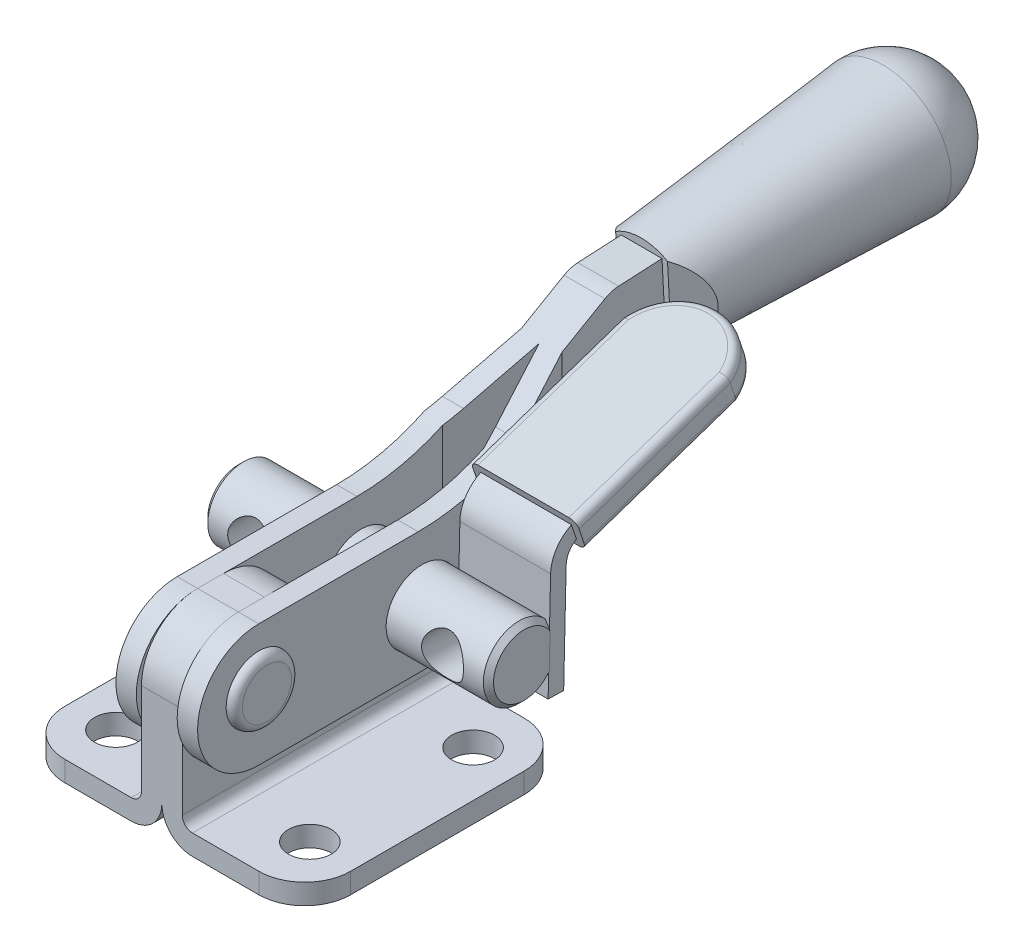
ISO-10303-21;
HEADER;
FILE_DESCRIPTION(('STEP AP214'),'2;1');
FILE_NAME('part.step','',(''),(''),'','','');
FILE_SCHEMA(('AUTOMOTIVE_DESIGN { 1 0 10303 214 1 1 1 1 }'));
ENDSEC;
DATA;
#1=APPLICATION_CONTEXT('core data for automotive mechanical design processes');
#2=APPLICATION_PROTOCOL_DEFINITION('international standard','automotive_design',2000,#1);
#3=PRODUCT_CONTEXT('',#1,'mechanical');
#4=PRODUCT('Part','Part','',(#3));
#5=PRODUCT_RELATED_PRODUCT_CATEGORY('part','',(#4));
#6=PRODUCT_DEFINITION_FORMATION('','',#4);
#7=PRODUCT_DEFINITION_CONTEXT('part definition',#1,'design');
#8=PRODUCT_DEFINITION('design','',#6,#7);
#9=PRODUCT_DEFINITION_SHAPE('','',#8);
#10=(LENGTH_UNIT() NAMED_UNIT(*) SI_UNIT(.MILLI.,.METRE.));
#11=(NAMED_UNIT(*) PLANE_ANGLE_UNIT() SI_UNIT($,.RADIAN.));
#12=(NAMED_UNIT(*) SI_UNIT($,.STERADIAN.) SOLID_ANGLE_UNIT());
#13=UNCERTAINTY_MEASURE_WITH_UNIT(LENGTH_MEASURE(1.E-05),#10,'distance_accuracy_value','');
#14=(GEOMETRIC_REPRESENTATION_CONTEXT(3) GLOBAL_UNCERTAINTY_ASSIGNED_CONTEXT((#13)) GLOBAL_UNIT_ASSIGNED_CONTEXT((#10,
#11,#12)) REPRESENTATION_CONTEXT('',''));
#15=CARTESIAN_POINT('',(0.,0.,0.));
#16=DIRECTION('',(0.,0.,1.));
#17=DIRECTION('',(1.,0.,0.));
#18=AXIS2_PLACEMENT_3D('',#15,#16,#17);
#19=CARTESIAN_POINT('',(1.651,24.,-71.0000000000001));
#20=DIRECTION('',(-1.,0.,0.));
#21=DIRECTION('',(0.,0.0523359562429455,-0.998629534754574));
#22=AXIS2_PLACEMENT_3D('',#19,#20,#21);
#23=CYLINDRICAL_SURFACE('',#22,3.96875000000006);
#24=CARTESIAN_POINT('',(1.651,24.,-71.0000000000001));
#25=DIRECTION('',(-1.,0.,0.));
#26=DIRECTION('',(0.,0.0523359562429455,-0.998629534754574));
#27=AXIS2_PLACEMENT_3D('',#24,#25,#26);
#28=CIRCLE('',#27,3.96875000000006);
#29=CARTESIAN_POINT('',(1.651,27.8835336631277,-71.8180115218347));
#30=VERTEX_POINT('',#29);
#31=CARTESIAN_POINT('',(1.651,20.2232462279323,-72.2194701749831));
#32=VERTEX_POINT('',#31);
#33=EDGE_CURVE('P0_E89',#30,#32,#28,.T.);
#34=ORIENTED_EDGE('',*,*,#33,.F.);
#35=DIRECTION('',(-1.,0.,0.));
#36=VECTOR('',#35,1.);
#37=CARTESIAN_POINT('',(1.651,27.8835336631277,-71.8180115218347));
#38=LINE('',#37,#36);
#39=CARTESIAN_POINT('',(-1.651,27.8835336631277,-71.8180115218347));
#40=VERTEX_POINT('',#39);
#41=EDGE_CURVE('P0_E87',#30,#40,#38,.T.);
#42=ORIENTED_EDGE('',*,*,#41,.T.);
#43=CARTESIAN_POINT('',(-1.651,24.,-71.0000000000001));
#44=DIRECTION('',(-1.,0.,0.));
#45=DIRECTION('',(0.,0.0523359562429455,-0.998629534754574));
#46=AXIS2_PLACEMENT_3D('',#43,#44,#45);
#47=CIRCLE('',#46,3.96875000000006);
#48=CARTESIAN_POINT('',(-1.651,20.2232462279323,-72.2194701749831));
#49=VERTEX_POINT('',#48);
#50=EDGE_CURVE('P0_E19',#40,#49,#47,.T.);
#51=ORIENTED_EDGE('',*,*,#50,.T.);
#52=DIRECTION('',(-1.,0.,0.));
#53=VECTOR('',#52,1.);
#54=CARTESIAN_POINT('',(1.651,20.2232462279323,-72.2194701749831));
#55=LINE('',#54,#53);
#56=EDGE_CURVE('P0_E116',#49,#32,#55,.F.);
#57=ORIENTED_EDGE('',*,*,#56,.T.);
#58=EDGE_LOOP('',(#34,#42,#51,#57));
#59=FACE_BOUND('',#58,.T.);
#60=ADVANCED_FACE('P0_F16',(#59),#23,.F.);
#61=CARTESIAN_POINT('',(1.651,26.5838937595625,-47.0194048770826));
#62=DIRECTION('',(0.,0.998629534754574,0.0523359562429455));
#63=DIRECTION('',(0.,0.0523359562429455,-0.998629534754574));
#64=AXIS2_PLACEMENT_3D('',#61,#62,#63);
#65=PLANE('',#64);
#66=DIRECTION('',(0.,0.0523359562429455,-0.998629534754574));
#67=VECTOR('',#66,1.);
#68=CARTESIAN_POINT('',(1.651,27.8301437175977,-70.7992706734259));
#69=LINE('',#68,#67);
#70=CARTESIAN_POINT('',(1.651,26.5838937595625,-47.0194048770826));
#71=VERTEX_POINT('',#70);
#72=EDGE_CURVE('P0_E138',#71,#30,#69,.T.);
#73=ORIENTED_EDGE('',*,*,#72,.F.);
#74=DIRECTION('',(1.,0.,0.));
#75=VECTOR('',#74,1.);
#76=CARTESIAN_POINT('',(0.,26.5838937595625,-47.0194048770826));
#77=LINE('',#76,#75);
#78=CARTESIAN_POINT('',(-1.651,26.5838937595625,-47.0194048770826));
#79=VERTEX_POINT('',#78);
#80=EDGE_CURVE('P0_E98',#71,#79,#77,.F.);
#81=ORIENTED_EDGE('',*,*,#80,.T.);
#82=DIRECTION('',(0.,0.0523359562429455,-0.998629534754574));
#83=VECTOR('',#82,1.);
#84=CARTESIAN_POINT('',(-1.651,27.8301437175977,-70.7992706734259));
#85=LINE('',#84,#83);
#86=EDGE_CURVE('P0_E80',#79,#40,#85,.T.);
#87=ORIENTED_EDGE('',*,*,#86,.T.);
#88=ORIENTED_EDGE('',*,*,#41,.F.);
#89=EDGE_LOOP('',(#73,#81,#87,#88));
#90=FACE_BOUND('',#89,.T.);
#91=ADVANCED_FACE('P0_F96',(#90),#65,.F.);
#92=CARTESIAN_POINT('',(-1.651,24.,-71.0000000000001));
#93=DIRECTION('',(-1.,0.,0.));
#94=DIRECTION('',(0.,0.0523359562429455,-0.998629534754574));
#95=AXIS2_PLACEMENT_3D('',#92,#93,#94);
#96=PLANE('',#95);
#97=ORIENTED_EDGE('',*,*,#50,.F.);
#98=ORIENTED_EDGE('',*,*,#86,.F.);
#99=DIRECTION('',(0.,-0.998629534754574,-0.0523359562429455));
#100=VECTOR('',#99,1.);
#101=CARTESIAN_POINT('',(-1.651,22.7537500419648,-47.2201342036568));
#102=LINE('',#101,#100);
#103=CARTESIAN_POINT('',(-1.651,18.9236063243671,-47.420863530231));
#104=VERTEX_POINT('',#103);
#105=EDGE_CURVE('P0_E115',#79,#104,#102,.T.);
#106=ORIENTED_EDGE('',*,*,#105,.T.);
#107=DIRECTION('',(0.,-0.0523359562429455,0.998629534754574));
#108=VECTOR('',#107,1.);
#109=CARTESIAN_POINT('',(-1.651,20.2232462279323,-72.2194701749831));
#110=LINE('',#109,#108);
#111=EDGE_CURVE('P0_E83',#104,#49,#110,.F.);
#112=ORIENTED_EDGE('',*,*,#111,.T.);
#113=EDGE_LOOP('',(#97,#98,#106,#112));
#114=FACE_BOUND('',#113,.T.);
#115=ADVANCED_FACE('P0_F77',(#114),#96,.F.);
#116=CARTESIAN_POINT('',(1.651,20.2232462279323,-72.2194701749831));
#117=DIRECTION('',(0.,-0.998629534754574,-0.0523359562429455));
#118=DIRECTION('',(0.,-0.0523359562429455,0.998629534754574));
#119=AXIS2_PLACEMENT_3D('',#116,#117,#118);
#120=PLANE('',#119);
#121=DIRECTION('',(0.,0.0523359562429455,-0.998629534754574));
#122=VECTOR('',#121,1.);
#123=CARTESIAN_POINT('',(1.651,20.1698562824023,-71.2007293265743));
#124=LINE('',#123,#122);
#125=CARTESIAN_POINT('',(1.651,18.9236063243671,-47.420863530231));
#126=VERTEX_POINT('',#125);
#127=EDGE_CURVE('P0_E104',#32,#126,#124,.F.);
#128=ORIENTED_EDGE('',*,*,#127,.F.);
#129=ORIENTED_EDGE('',*,*,#56,.F.);
#130=ORIENTED_EDGE('',*,*,#111,.F.);
#131=DIRECTION('',(1.,0.,0.));
#132=VECTOR('',#131,1.);
#133=CARTESIAN_POINT('',(0.,18.9236063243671,-47.420863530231));
#134=LINE('',#133,#132);
#135=EDGE_CURVE('P0_E112',#104,#126,#134,.T.);
#136=ORIENTED_EDGE('',*,*,#135,.T.);
#137=EDGE_LOOP('',(#128,#129,#130,#136));
#138=FACE_BOUND('',#137,.T.);
#139=ADVANCED_FACE('P0_F168',(#138),#120,.F.);
#140=CARTESIAN_POINT('',(1.651,24.,-71.0000000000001));
#141=DIRECTION('',(-1.,0.,0.));
#142=DIRECTION('',(0.,0.0523359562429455,-0.998629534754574));
#143=AXIS2_PLACEMENT_3D('',#140,#141,#142);
#144=PLANE('',#143);
#145=ORIENTED_EDGE('',*,*,#72,.T.);
#146=ORIENTED_EDGE('',*,*,#33,.T.);
#147=ORIENTED_EDGE('',*,*,#127,.T.);
#148=DIRECTION('',(0.,-0.998629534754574,-0.0523359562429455));
#149=VECTOR('',#148,1.);
#150=CARTESIAN_POINT('',(1.651,22.7537500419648,-47.2201342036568));
#151=LINE('',#150,#149);
#152=EDGE_CURVE('P0_E107',#126,#71,#151,.F.);
#153=ORIENTED_EDGE('',*,*,#152,.T.);
#154=EDGE_LOOP('',(#145,#146,#147,#153));
#155=FACE_BOUND('',#154,.T.);
#156=ADVANCED_FACE('P0_F164',(#155),#144,.T.);
#157=CARTESIAN_POINT('',(-4.9226851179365,32.8646703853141,-49.0747612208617));
#158=DIRECTION('',(0.707106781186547,0.0370071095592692,-0.706137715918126));
#159=DIRECTION('',(0.707106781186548,-0.0370071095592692,0.706137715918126));
#160=AXIS2_PLACEMENT_3D('',#157,#158,#159);
#161=PLANE('',#160);
#162=DIRECTION('',(0.,-0.998629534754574,-0.0523359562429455));
#163=VECTOR('',#162,1.);
#164=CARTESIAN_POINT('',(-2.5414351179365,22.7537500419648,-47.2201342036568));
#165=LINE('',#164,#163);
#166=CARTESIAN_POINT('',(-2.5414351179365,18.7315517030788,-47.4309286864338));
#167=VERTEX_POINT('',#166);
#168=CARTESIAN_POINT('',(-2.5414351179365,26.7759483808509,-47.0093397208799));
#169=VERTEX_POINT('',#168);
#170=EDGE_CURVE('P0_E136',#167,#169,#165,.F.);
#171=ORIENTED_EDGE('',*,*,#170,.T.);
#172=CARTESIAN_POINT('',(-0.307571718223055,22.6368386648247,-44.9893322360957));
#173=DIRECTION('',(0.707106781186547,0.0370071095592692,-0.706137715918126));
#174=DIRECTION('',(-0.707106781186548,0.0370071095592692,-0.706137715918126));
#175=AXIS2_PLACEMENT_3D('',#172,#173,#174);
#176=ELLIPSE('',#175,6.52458142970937,4.60331196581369);
#177=EDGE_CURVE('P0_E111',#167,#169,#176,.T.);
#178=ORIENTED_EDGE('',*,*,#177,.F.);
#179=EDGE_LOOP('',(#171,#178));
#180=FACE_BOUND('',#179,.T.);
#181=ADVANCED_FACE('P0_F159',(#180),#161,.F.);
#182=CARTESIAN_POINT('',(0.,23.9999999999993,-71.0000000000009));
#183=DIRECTION('',(0.,0.998629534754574,0.0523359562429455));
#184=DIRECTION('',(0.,0.0523359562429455,-0.998629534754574));
#185=AXIS2_PLACEMENT_3D('',#182,#183,#184);
#186=SPHERICAL_SURFACE('',#185,6.34999999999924);
#187=CARTESIAN_POINT('',(0.,24.000000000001,-71.0000000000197));
#188=DIRECTION('',(0.,0.0523359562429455,-0.998629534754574));
#189=DIRECTION('',(1.,0.,0.));
#190=AXIS2_PLACEMENT_3D('',#187,#188,#189);
#191=CIRCLE('',#190,6.34999999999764);
#192=CARTESIAN_POINT('',(0.,30.3412975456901,-70.6676666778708));
#193=VERTEX_POINT('',#192);
#194=CARTESIAN_POINT('',(0.,17.658702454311,-71.3323333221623));
#195=VERTEX_POINT('',#194);
#196=EDGE_CURVE('P0_E132',#193,#195,#191,.F.);
#197=ORIENTED_EDGE('',*,*,#196,.F.);
#198=CARTESIAN_POINT('',(0.,24.000000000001,-71.0000000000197));
#199=DIRECTION('',(0.,0.0523359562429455,-0.998629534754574));
#200=DIRECTION('',(1.,0.,0.));
#201=AXIS2_PLACEMENT_3D('',#198,#199,#200);
#202=CIRCLE('',#201,6.34999999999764);
#203=EDGE_CURVE('P0_E129',#195,#193,#202,.F.);
#204=ORIENTED_EDGE('',*,*,#203,.F.);
#205=EDGE_LOOP('',(#197,#204));
#206=FACE_BOUND('',#205,.T.);
#207=ADVANCED_FACE('P0_F154',(#206),#186,.T.);
#208=CARTESIAN_POINT('',(2.5414351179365,32.7400453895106,-46.6967746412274));
#209=DIRECTION('',(-0.707106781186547,0.0370071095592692,-0.706137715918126));
#210=DIRECTION('',(0.707106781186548,0.0370071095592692,-0.706137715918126));
#211=AXIS2_PLACEMENT_3D('',#208,#209,#210);
#212=PLANE('',#211);
#213=CARTESIAN_POINT('',(0.307571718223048,22.6368386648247,-44.9893322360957));
#214=DIRECTION('',(-0.707106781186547,0.0370071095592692,-0.706137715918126));
#215=DIRECTION('',(0.707106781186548,0.0370071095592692,-0.706137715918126));
#216=AXIS2_PLACEMENT_3D('',#213,#214,#215);
#217=ELLIPSE('',#216,6.52458142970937,4.60331196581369);
#218=CARTESIAN_POINT('',(2.5414351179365,26.7759483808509,-47.0093397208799));
#219=VERTEX_POINT('',#218);
#220=CARTESIAN_POINT('',(2.5414351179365,18.7315517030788,-47.4309286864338));
#221=VERTEX_POINT('',#220);
#222=EDGE_CURVE('P0_E26',#219,#221,#217,.T.);
#223=ORIENTED_EDGE('',*,*,#222,.F.);
#224=DIRECTION('',(0.,-0.998629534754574,-0.0523359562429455));
#225=VECTOR('',#224,1.);
#226=CARTESIAN_POINT('',(2.5414351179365,22.7537500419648,-47.2201342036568));
#227=LINE('',#226,#225);
#228=EDGE_CURVE('P0_E38',#219,#221,#227,.T.);
#229=ORIENTED_EDGE('',*,*,#228,.T.);
#230=EDGE_LOOP('',(#223,#229));
#231=FACE_BOUND('',#230,.T.);
#232=ADVANCED_FACE('P0_F158',(#231),#212,.F.);
#233=CARTESIAN_POINT('',(0.,22.7537500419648,-47.2201342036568));
#234=DIRECTION('',(0.,0.0523359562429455,-0.998629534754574));
#235=DIRECTION('',(1.,0.,0.));
#236=AXIS2_PLACEMENT_3D('',#233,#234,#235);
#237=PLANE('',#236);
#238=ORIENTED_EDGE('',*,*,#135,.F.);
#239=ORIENTED_EDGE('',*,*,#105,.F.);
#240=ORIENTED_EDGE('',*,*,#80,.F.);
#241=ORIENTED_EDGE('',*,*,#152,.F.);
#242=EDGE_LOOP('',(#238,#239,#240,#241));
#243=FACE_BOUND('',#242,.T.);
#244=ORIENTED_EDGE('',*,*,#228,.F.);
#245=CARTESIAN_POINT('',(0.,22.7537500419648,-47.2201342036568));
#246=DIRECTION('',(0.,0.0523359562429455,-0.998629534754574));
#247=DIRECTION('',(1.,0.,0.));
#248=AXIS2_PLACEMENT_3D('',#245,#246,#247);
#249=CIRCLE('',#248,4.7624999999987);
#250=EDGE_CURVE('P0_E133',#169,#219,#249,.T.);
#251=ORIENTED_EDGE('',*,*,#250,.F.);
#252=ORIENTED_EDGE('',*,*,#170,.F.);
#253=CARTESIAN_POINT('',(0.,22.7537500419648,-47.2201342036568));
#254=DIRECTION('',(0.,0.0523359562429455,-0.998629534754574));
#255=DIRECTION('',(1.,0.,0.));
#256=AXIS2_PLACEMENT_3D('',#253,#254,#255);
#257=CIRCLE('',#256,4.7624999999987);
#258=EDGE_CURVE('P0_E11',#221,#167,#257,.T.);
#259=ORIENTED_EDGE('',*,*,#258,.F.);
#260=EDGE_LOOP('',(#244,#251,#252,#259));
#261=FACE_BOUND('',#260,.T.);
#262=ADVANCED_FACE('P0_F180',(#243,#261),#237,.F.);
#263=CARTESIAN_POINT('',(0.,23.999999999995,-70.9999999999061));
#264=DIRECTION('',(0.,0.0523359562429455,-0.998629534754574));
#265=DIRECTION('',(1.,0.,0.));
#266=AXIS2_PLACEMENT_3D('',#263,#264,#265);
#267=CONICAL_SURFACE('',#266,6.34999999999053,0.0665681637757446);
#268=ORIENTED_EDGE('',*,*,#203,.T.);
#269=ORIENTED_EDGE('',*,*,#196,.T.);
#270=EDGE_LOOP('',(#268,#269));
#271=FACE_BOUND('',#270,.T.);
#272=ORIENTED_EDGE('',*,*,#222,.T.);
#273=ORIENTED_EDGE('',*,*,#258,.T.);
#274=ORIENTED_EDGE('',*,*,#177,.T.);
#275=ORIENTED_EDGE('',*,*,#250,.T.);
#276=EDGE_LOOP('',(#272,#273,#274,#275));
#277=FACE_BOUND('',#276,.T.);
#278=ADVANCED_FACE('P0_F178',(#271,#277),#267,.T.);
#279=CLOSED_SHELL('',(#60,#91,#115,#139,#156,#181,#207,#232,#262,#278));
#280=MANIFOLD_SOLID_BREP('P0_B1',#279);
#281=CARTESIAN_POINT('',(4.79999999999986,14.3999999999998,-5.50000000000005));
#282=DIRECTION('',(-1.,0.,0.));
#283=DIRECTION('',(0.,0.,1.));
#284=AXIS2_PLACEMENT_3D('',#281,#282,#283);
#285=PLANE('',#284);
#286=CARTESIAN_POINT('',(4.79999999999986,12.,-5.50000000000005));
#287=DIRECTION('',(-1.,0.,0.));
#288=DIRECTION('',(0.,0.,-1.));
#289=AXIS2_PLACEMENT_3D('',#286,#287,#288);
#290=CIRCLE('',#289,2.39999999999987);
#291=CARTESIAN_POINT('',(4.79999999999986,12.,-7.89999999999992));
#292=VERTEX_POINT('',#291);
#293=CARTESIAN_POINT('',(4.79999999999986,12.,-3.10000000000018));
#294=VERTEX_POINT('',#293);
#295=EDGE_CURVE('P1_E392',#292,#294,#290,.T.);
#296=ORIENTED_EDGE('',*,*,#295,.F.);
#297=CARTESIAN_POINT('',(4.79999999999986,12.,-5.50000000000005));
#298=DIRECTION('',(-1.,0.,0.));
#299=DIRECTION('',(0.,0.,1.));
#300=AXIS2_PLACEMENT_3D('',#297,#298,#299);
#301=CIRCLE('',#300,2.39999999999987);
#302=EDGE_CURVE('P1_E388',#294,#292,#301,.T.);
#303=ORIENTED_EDGE('',*,*,#302,.F.);
#304=EDGE_LOOP('',(#296,#303));
#305=FACE_BOUND('',#304,.T.);
#306=ADVANCED_FACE('P1_F16',(#305),#285,.F.);
#307=CARTESIAN_POINT('',(-4.80000000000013,12.,-5.50000000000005));
#308=DIRECTION('',(1.,0.,0.));
#309=DIRECTION('',(0.,0.,-1.));
#310=AXIS2_PLACEMENT_3D('',#307,#308,#309);
#311=PLANE('',#310);
#312=CARTESIAN_POINT('',(-4.80000000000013,12.,-5.50000000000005));
#313=DIRECTION('',(1.,0.,0.));
#314=DIRECTION('',(0.,0.,1.));
#315=AXIS2_PLACEMENT_3D('',#312,#313,#314);
#316=CIRCLE('',#315,2.39999999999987);
#317=CARTESIAN_POINT('',(-4.80000000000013,12.,-3.10000000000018));
#318=VERTEX_POINT('',#317);
#319=CARTESIAN_POINT('',(-4.80000000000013,12.,-7.89999999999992));
#320=VERTEX_POINT('',#319);
#321=EDGE_CURVE('P1_E196',#318,#320,#316,.T.);
#322=ORIENTED_EDGE('',*,*,#321,.F.);
#323=CARTESIAN_POINT('',(-4.80000000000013,12.,-5.50000000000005));
#324=DIRECTION('',(1.,0.,0.));
#325=DIRECTION('',(0.,0.,-1.));
#326=AXIS2_PLACEMENT_3D('',#323,#324,#325);
#327=CIRCLE('',#326,2.39999999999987);
#328=EDGE_CURVE('P1_E447',#320,#318,#327,.T.);
#329=ORIENTED_EDGE('',*,*,#328,.F.);
#330=EDGE_LOOP('',(#322,#329));
#331=FACE_BOUND('',#330,.T.);
#332=ADVANCED_FACE('P1_F453',(#331),#311,.F.);
#333=CARTESIAN_POINT('',(4.79999999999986,12.,-5.50000000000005));
#334=DIRECTION('',(-1.,0.,0.));
#335=DIRECTION('',(0.,0.,1.));
#336=AXIS2_PLACEMENT_3D('',#333,#334,#335);
#337=CYLINDRICAL_SURFACE('',#336,2.39999999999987);
#338=CARTESIAN_POINT('',(2.,12.,-5.50000000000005));
#339=DIRECTION('',(-1.,0.,0.));
#340=DIRECTION('',(0.,0.,1.));
#341=AXIS2_PLACEMENT_3D('',#338,#339,#340);
#342=CIRCLE('',#341,2.39999999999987);
#343=CARTESIAN_POINT('',(2.,12.,-3.10000000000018));
#344=VERTEX_POINT('',#343);
#345=EDGE_CURVE('P1_E319',#344,#344,#342,.F.);
#346=ORIENTED_EDGE('',*,*,#345,.F.);
#347=EDGE_LOOP('',(#346));
#348=FACE_BOUND('',#347,.T.);
#349=CARTESIAN_POINT('',(-2.,12.,-5.50000000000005));
#350=DIRECTION('',(-1.,0.,0.));
#351=DIRECTION('',(0.,0.,1.));
#352=AXIS2_PLACEMENT_3D('',#349,#350,#351);
#353=CIRCLE('',#352,2.39999999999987);
#354=CARTESIAN_POINT('',(-2.,12.,-3.10000000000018));
#355=VERTEX_POINT('',#354);
#356=EDGE_CURVE('P1_E342',#355,#355,#353,.T.);
#357=ORIENTED_EDGE('',*,*,#356,.F.);
#358=EDGE_LOOP('',(#357));
#359=FACE_BOUND('',#358,.T.);
#360=ADVANCED_FACE('P1_F462',(#348,#359),#337,.T.);
#361=CARTESIAN_POINT('',(4.,11.5,-5.50000000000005));
#362=DIRECTION('',(-1.,0.,0.));
#363=DIRECTION('',(0.,0.,1.));
#364=AXIS2_PLACEMENT_3D('',#361,#362,#363);
#365=CYLINDRICAL_SURFACE('',#364,6.);
#366=CARTESIAN_POINT('',(2.,11.5,-5.50000000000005));
#367=DIRECTION('',(-1.,0.,0.));
#368=DIRECTION('',(0.,0.,1.));
#369=AXIS2_PLACEMENT_3D('',#366,#367,#368);
#370=CIRCLE('',#369,6.);
#371=CARTESIAN_POINT('',(2.,5.49999999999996,-5.50000000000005));
#372=VERTEX_POINT('',#371);
#373=CARTESIAN_POINT('',(2.,17.5,-5.50000000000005));
#374=VERTEX_POINT('',#373);
#375=EDGE_CURVE('P1_E315',#372,#374,#370,.T.);
#376=ORIENTED_EDGE('',*,*,#375,.F.);
#377=DIRECTION('',(1.,0.,0.));
#378=VECTOR('',#377,1.);
#379=CARTESIAN_POINT('',(4.,5.49999999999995,-5.50000000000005));
#380=LINE('',#379,#378);
#381=CARTESIAN_POINT('',(4.,5.49999999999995,-5.50000000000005));
#382=VERTEX_POINT('',#381);
#383=EDGE_CURVE('P1_E397',#372,#382,#380,.T.);
#384=ORIENTED_EDGE('',*,*,#383,.T.);
#385=CARTESIAN_POINT('',(4.,11.5,-5.50000000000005));
#386=DIRECTION('',(-1.,0.,0.));
#387=DIRECTION('',(0.,0.,1.));
#388=AXIS2_PLACEMENT_3D('',#385,#386,#387);
#389=CIRCLE('',#388,6.);
#390=CARTESIAN_POINT('',(4.,17.5,-5.50000000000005));
#391=VERTEX_POINT('',#390);
#392=EDGE_CURVE('P1_E558',#391,#382,#389,.F.);
#393=ORIENTED_EDGE('',*,*,#392,.F.);
#394=DIRECTION('',(1.,0.,0.));
#395=VECTOR('',#394,1.);
#396=CARTESIAN_POINT('',(4.,17.5,-5.50000000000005));
#397=LINE('',#396,#395);
#398=EDGE_CURVE('P1_E445',#391,#374,#397,.F.);
#399=ORIENTED_EDGE('',*,*,#398,.T.);
#400=EDGE_LOOP('',(#376,#384,#393,#399));
#401=FACE_BOUND('',#400,.T.);
#402=ADVANCED_FACE('P1_F577',(#401),#365,.T.);
#403=CARTESIAN_POINT('',(4.,5.49999999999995,-5.50000000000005));
#404=DIRECTION('',(0.,1.,0.));
#405=DIRECTION('',(0.,0.,1.));
#406=AXIS2_PLACEMENT_3D('',#403,#404,#405);
#407=PLANE('',#406);
#408=DIRECTION('',(-1.,0.,0.));
#409=VECTOR('',#408,1.);
#410=CARTESIAN_POINT('',(4.,5.49999999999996,-21.5));
#411=LINE('',#410,#409);
#412=CARTESIAN_POINT('',(4.,5.49999999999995,-21.4999999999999));
#413=VERTEX_POINT('',#412);
#414=CARTESIAN_POINT('',(2.,5.49999999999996,-21.4999999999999));
#415=VERTEX_POINT('',#414);
#416=EDGE_CURVE('P1_E438',#413,#415,#411,.T.);
#417=ORIENTED_EDGE('',*,*,#416,.F.);
#418=DIRECTION('',(0.,0.,-1.));
#419=VECTOR('',#418,1.);
#420=CARTESIAN_POINT('',(4.,5.49999999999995,-5.50000000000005));
#421=LINE('',#420,#419);
#422=EDGE_CURVE('P1_E554',#382,#413,#421,.T.);
#423=ORIENTED_EDGE('',*,*,#422,.F.);
#424=ORIENTED_EDGE('',*,*,#383,.F.);
#425=DIRECTION('',(0.,0.,1.));
#426=VECTOR('',#425,1.);
#427=CARTESIAN_POINT('',(2.,5.49999999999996,-29.5));
#428=LINE('',#427,#426);
#429=EDGE_CURVE('P1_E316',#415,#372,#428,.T.);
#430=ORIENTED_EDGE('',*,*,#429,.F.);
#431=EDGE_LOOP('',(#417,#423,#424,#430));
#432=FACE_BOUND('',#431,.T.);
#433=ADVANCED_FACE('P1_F574',(#432),#407,.F.);
#434=CARTESIAN_POINT('',(4.,11.,-21.5));
#435=DIRECTION('',(-1.,0.,0.));
#436=DIRECTION('',(0.,0.,1.));
#437=AXIS2_PLACEMENT_3D('',#434,#435,#436);
#438=CYLINDRICAL_SURFACE('',#437,3.525);
#439=CARTESIAN_POINT('',(4.,11.,-21.5));
#440=DIRECTION('',(-1.,0.,0.));
#441=DIRECTION('',(0.,0.,1.));
#442=AXIS2_PLACEMENT_3D('',#439,#440,#441);
#443=CIRCLE('',#442,3.525);
#444=CARTESIAN_POINT('',(4.,11.,-17.9750000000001));
#445=VERTEX_POINT('',#444);
#446=EDGE_CURVE('P1_E529',#445,#445,#443,.T.);
#447=ORIENTED_EDGE('',*,*,#446,.F.);
#448=EDGE_LOOP('',(#447));
#449=FACE_BOUND('',#448,.T.);
#450=CARTESIAN_POINT('',(2.,11.,-21.5));
#451=DIRECTION('',(-1.,0.,0.));
#452=DIRECTION('',(0.,0.,1.));
#453=AXIS2_PLACEMENT_3D('',#450,#451,#452);
#454=CIRCLE('',#453,3.525);
#455=CARTESIAN_POINT('',(2.,11.,-17.9750000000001));
#456=VERTEX_POINT('',#455);
#457=EDGE_CURVE('P1_E486',#456,#456,#454,.F.);
#458=ORIENTED_EDGE('',*,*,#457,.F.);
#459=EDGE_LOOP('',(#458));
#460=FACE_BOUND('',#459,.T.);
#461=ADVANCED_FACE('P1_F431',(#449,#460),#438,.F.);
#462=CARTESIAN_POINT('',(3.99999999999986,12.,-5.50000000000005));
#463=DIRECTION('',(-1.,0.,0.));
#464=DIRECTION('',(0.,0.,1.));
#465=AXIS2_PLACEMENT_3D('',#462,#463,#464);
#466=TOROIDAL_SURFACE('',#465,2.39999999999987,0.8);
#467=ORIENTED_EDGE('',*,*,#302,.T.);
#468=ORIENTED_EDGE('',*,*,#295,.T.);
#469=EDGE_LOOP('',(#467,#468));
#470=FACE_BOUND('',#469,.T.);
#471=CARTESIAN_POINT('',(4.,12.,-5.50000000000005));
#472=DIRECTION('',(-1.,0.,0.));
#473=DIRECTION('',(0.,0.,1.));
#474=AXIS2_PLACEMENT_3D('',#471,#472,#473);
#475=CIRCLE('',#474,3.19999999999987);
#476=CARTESIAN_POINT('',(4.,12.,-2.30000000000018));
#477=VERTEX_POINT('',#476);
#478=EDGE_CURVE('P1_E521',#477,#477,#475,.T.);
#479=ORIENTED_EDGE('',*,*,#478,.F.);
#480=EDGE_LOOP('',(#479));
#481=FACE_BOUND('',#480,.T.);
#482=ADVANCED_FACE('P1_F390',(#470,#481),#466,.T.);
#483=CARTESIAN_POINT('',(4.,11.5,-5.50000000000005));
#484=DIRECTION('',(-1.,0.,0.));
#485=DIRECTION('',(0.,0.,1.));
#486=AXIS2_PLACEMENT_3D('',#483,#484,#485);
#487=CYLINDRICAL_SURFACE('',#486,6.);
#488=CARTESIAN_POINT('',(-4.,11.5,-5.50000000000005));
#489=DIRECTION('',(-1.,0.,0.));
#490=DIRECTION('',(0.,0.,1.));
#491=AXIS2_PLACEMENT_3D('',#488,#489,#490);
#492=CIRCLE('',#491,6.);
#493=CARTESIAN_POINT('',(-4.,17.5,-5.50000000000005));
#494=VERTEX_POINT('',#493);
#495=CARTESIAN_POINT('',(-4.,5.49999999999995,-5.50000000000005));
#496=VERTEX_POINT('',#495);
#497=EDGE_CURVE('P1_E483',#494,#496,#492,.F.);
#498=ORIENTED_EDGE('',*,*,#497,.T.);
#499=DIRECTION('',(1.,0.,0.));
#500=VECTOR('',#499,1.);
#501=CARTESIAN_POINT('',(4.,5.49999999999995,-5.50000000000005));
#502=LINE('',#501,#500);
#503=CARTESIAN_POINT('',(-2.,5.49999999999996,-5.50000000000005));
#504=VERTEX_POINT('',#503);
#505=EDGE_CURVE('P1_E179',#496,#504,#502,.T.);
#506=ORIENTED_EDGE('',*,*,#505,.T.);
#507=CARTESIAN_POINT('',(-2.,11.5,-5.50000000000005));
#508=DIRECTION('',(-1.,0.,0.));
#509=DIRECTION('',(0.,0.,1.));
#510=AXIS2_PLACEMENT_3D('',#507,#508,#509);
#511=CIRCLE('',#510,6.);
#512=CARTESIAN_POINT('',(-2.,17.5,-5.50000000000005));
#513=VERTEX_POINT('',#512);
#514=EDGE_CURVE('P1_E186',#513,#504,#511,.F.);
#515=ORIENTED_EDGE('',*,*,#514,.F.);
#516=DIRECTION('',(1.,0.,0.));
#517=VECTOR('',#516,1.);
#518=CARTESIAN_POINT('',(4.,17.5,-5.50000000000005));
#519=LINE('',#518,#517);
#520=EDGE_CURVE('P1_E437',#513,#494,#519,.F.);
#521=ORIENTED_EDGE('',*,*,#520,.T.);
#522=EDGE_LOOP('',(#498,#506,#515,#521));
#523=FACE_BOUND('',#522,.T.);
#524=ADVANCED_FACE('P1_F430',(#523),#487,.T.);
#525=CARTESIAN_POINT('',(4.,5.49999999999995,-5.50000000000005));
#526=DIRECTION('',(0.,1.,0.));
#527=DIRECTION('',(0.,0.,1.));
#528=AXIS2_PLACEMENT_3D('',#525,#526,#527);
#529=PLANE('',#528);
#530=ORIENTED_EDGE('',*,*,#505,.F.);
#531=DIRECTION('',(0.,0.,-1.));
#532=VECTOR('',#531,1.);
#533=CARTESIAN_POINT('',(-4.,5.49999999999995,-5.50000000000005));
#534=LINE('',#533,#532);
#535=CARTESIAN_POINT('',(-4.,5.49999999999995,-21.4999999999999));
#536=VERTEX_POINT('',#535);
#537=EDGE_CURVE('P1_E525',#496,#536,#534,.T.);
#538=ORIENTED_EDGE('',*,*,#537,.T.);
#539=DIRECTION('',(-1.,0.,0.));
#540=VECTOR('',#539,1.);
#541=CARTESIAN_POINT('',(4.,5.49999999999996,-21.5));
#542=LINE('',#541,#540);
#543=CARTESIAN_POINT('',(-2.,5.49999999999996,-21.4999999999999));
#544=VERTEX_POINT('',#543);
#545=EDGE_CURVE('P1_E357',#544,#536,#542,.T.);
#546=ORIENTED_EDGE('',*,*,#545,.F.);
#547=DIRECTION('',(0.,0.,-1.));
#548=VECTOR('',#547,1.);
#549=CARTESIAN_POINT('',(-2.,5.49999999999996,0.499999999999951));
#550=LINE('',#549,#548);
#551=EDGE_CURVE('P1_E333',#504,#544,#550,.T.);
#552=ORIENTED_EDGE('',*,*,#551,.F.);
#553=EDGE_LOOP('',(#530,#538,#546,#552));
#554=FACE_BOUND('',#553,.T.);
#555=ADVANCED_FACE('P1_F862',(#554),#529,.F.);
#556=CARTESIAN_POINT('',(4.,11.,-21.5));
#557=DIRECTION('',(-1.,0.,0.));
#558=DIRECTION('',(0.,0.,1.));
#559=AXIS2_PLACEMENT_3D('',#556,#557,#558);
#560=CYLINDRICAL_SURFACE('',#559,3.525);
#561=CARTESIAN_POINT('',(-4.,11.,-21.5));
#562=DIRECTION('',(-1.,0.,0.));
#563=DIRECTION('',(0.,0.,1.));
#564=AXIS2_PLACEMENT_3D('',#561,#562,#563);
#565=CIRCLE('',#564,3.525);
#566=CARTESIAN_POINT('',(-4.,11.,-17.9750000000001));
#567=VERTEX_POINT('',#566);
#568=EDGE_CURVE('P1_E600',#567,#567,#565,.T.);
#569=ORIENTED_EDGE('',*,*,#568,.T.);
#570=EDGE_LOOP('',(#569));
#571=FACE_BOUND('',#570,.T.);
#572=CARTESIAN_POINT('',(-2.,11.,-21.5));
#573=DIRECTION('',(-1.,0.,0.));
#574=DIRECTION('',(0.,0.,1.));
#575=AXIS2_PLACEMENT_3D('',#572,#573,#574);
#576=CIRCLE('',#575,3.525);
#577=CARTESIAN_POINT('',(-2.,11.,-17.9750000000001));
#578=VERTEX_POINT('',#577);
#579=EDGE_CURVE('P1_E501',#578,#578,#576,.T.);
#580=ORIENTED_EDGE('',*,*,#579,.F.);
#581=EDGE_LOOP('',(#580));
#582=FACE_BOUND('',#581,.T.);
#583=ADVANCED_FACE('P1_F366',(#571,#582),#560,.F.);
#584=CARTESIAN_POINT('',(-4.,12.,-5.50000000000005));
#585=DIRECTION('',(-1.,0.,0.));
#586=DIRECTION('',(0.,0.,1.));
#587=AXIS2_PLACEMENT_3D('',#584,#585,#586);
#588=TOROIDAL_SURFACE('',#587,2.39999999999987,0.800000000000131);
#589=ORIENTED_EDGE('',*,*,#321,.T.);
#590=ORIENTED_EDGE('',*,*,#328,.T.);
#591=EDGE_LOOP('',(#589,#590));
#592=FACE_BOUND('',#591,.T.);
#593=CARTESIAN_POINT('',(-4.,12.,-5.50000000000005));
#594=DIRECTION('',(-1.,0.,0.));
#595=DIRECTION('',(0.,0.,1.));
#596=AXIS2_PLACEMENT_3D('',#593,#594,#595);
#597=CIRCLE('',#596,3.2);
#598=CARTESIAN_POINT('',(-4.,12.,-2.30000000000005));
#599=VERTEX_POINT('',#598);
#600=EDGE_CURVE('P1_E597',#599,#599,#597,.T.);
#601=ORIENTED_EDGE('',*,*,#600,.T.);
#602=EDGE_LOOP('',(#601));
#603=FACE_BOUND('',#602,.T.);
#604=ADVANCED_FACE('P1_F360',(#592,#603),#588,.T.);
#605=CARTESIAN_POINT('',(4.,17.5,-21.1230336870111));
#606=DIRECTION('',(0.,-1.,0.));
#607=DIRECTION('',(0.,0.,-1.));
#608=AXIS2_PLACEMENT_3D('',#605,#606,#607);
#609=PLANE('',#608);
#610=ORIENTED_EDGE('',*,*,#398,.F.);
#611=DIRECTION('',(0.,0.,-1.));
#612=VECTOR('',#611,1.);
#613=CARTESIAN_POINT('',(4.,17.5,-5.50000000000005));
#614=LINE('',#613,#612);
#615=CARTESIAN_POINT('',(4.,17.5,-21.1230336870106));
#616=VERTEX_POINT('',#615);
#617=EDGE_CURVE('P1_E442',#616,#391,#614,.F.);
#618=ORIENTED_EDGE('',*,*,#617,.F.);
#619=DIRECTION('',(-1.,0.,0.));
#620=VECTOR('',#619,1.);
#621=CARTESIAN_POINT('',(4.,17.5,-21.1230336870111));
#622=LINE('',#621,#620);
#623=CARTESIAN_POINT('',(2.,17.5,-21.1230336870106));
#624=VERTEX_POINT('',#623);
#625=EDGE_CURVE('P1_E351',#616,#624,#622,.T.);
#626=ORIENTED_EDGE('',*,*,#625,.T.);
#627=DIRECTION('',(0.,0.,1.));
#628=VECTOR('',#627,1.);
#629=CARTESIAN_POINT('',(2.,17.5,-29.5));
#630=LINE('',#629,#628);
#631=EDGE_CURVE('P1_E311',#374,#624,#630,.F.);
#632=ORIENTED_EDGE('',*,*,#631,.F.);
#633=EDGE_LOOP('',(#610,#618,#626,#632));
#634=FACE_BOUND('',#633,.T.);
#635=ADVANCED_FACE('P1_F365',(#634),#609,.F.);
#636=CARTESIAN_POINT('',(4.,17.5,-21.1230336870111));
#637=DIRECTION('',(0.,-1.,0.));
#638=DIRECTION('',(0.,0.,-1.));
#639=AXIS2_PLACEMENT_3D('',#636,#637,#638);
#640=PLANE('',#639);
#641=DIRECTION('',(-1.,0.,0.));
#642=VECTOR('',#641,1.);
#643=CARTESIAN_POINT('',(4.,17.5,-21.1230336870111));
#644=LINE('',#643,#642);
#645=CARTESIAN_POINT('',(-2.,17.5,-21.1230336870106));
#646=VERTEX_POINT('',#645);
#647=CARTESIAN_POINT('',(-4.,17.5,-21.1230336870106));
#648=VERTEX_POINT('',#647);
#649=EDGE_CURVE('P1_E346',#646,#648,#644,.T.);
#650=ORIENTED_EDGE('',*,*,#649,.T.);
#651=DIRECTION('',(0.,0.,-1.));
#652=VECTOR('',#651,1.);
#653=CARTESIAN_POINT('',(-4.,17.5,-5.50000000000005));
#654=LINE('',#653,#652);
#655=EDGE_CURVE('P1_E515',#648,#494,#654,.F.);
#656=ORIENTED_EDGE('',*,*,#655,.T.);
#657=ORIENTED_EDGE('',*,*,#520,.F.);
#658=DIRECTION('',(0.,0.,-1.));
#659=VECTOR('',#658,1.);
#660=CARTESIAN_POINT('',(-2.,17.5,0.499999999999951));
#661=LINE('',#660,#659);
#662=EDGE_CURVE('P1_E338',#646,#513,#661,.F.);
#663=ORIENTED_EDGE('',*,*,#662,.F.);
#664=EDGE_LOOP('',(#650,#656,#657,#663));
#665=FACE_BOUND('',#664,.T.);
#666=ADVANCED_FACE('P1_F516',(#665),#640,.F.);
#667=CARTESIAN_POINT('',(4.,11.5000000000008,-21.4999999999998));
#668=DIRECTION('',(-1.,0.,0.));
#669=DIRECTION('',(0.,0.,1.));
#670=AXIS2_PLACEMENT_3D('',#667,#668,#669);
#671=CYLINDRICAL_SURFACE('',#670,6.00000000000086);
#672=CARTESIAN_POINT('',(-4.,11.5000000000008,-21.4999999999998));
#673=DIRECTION('',(-1.,0.,0.));
#674=DIRECTION('',(0.,0.,1.));
#675=AXIS2_PLACEMENT_3D('',#672,#673,#674);
#676=CIRCLE('',#675,6.00000000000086);
#677=CARTESIAN_POINT('',(-4.,6.30384757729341,-24.5000000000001));
#678=VERTEX_POINT('',#677);
#679=EDGE_CURVE('P1_E604',#536,#678,#676,.F.);
#680=ORIENTED_EDGE('',*,*,#679,.T.);
#681=DIRECTION('',(1.,0.,0.));
#682=VECTOR('',#681,1.);
#683=CARTESIAN_POINT('',(4.,6.30384757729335,-24.5));
#684=LINE('',#683,#682);
#685=CARTESIAN_POINT('',(-2.,6.30384757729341,-24.5000000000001));
#686=VERTEX_POINT('',#685);
#687=EDGE_CURVE('P1_E330',#678,#686,#684,.T.);
#688=ORIENTED_EDGE('',*,*,#687,.T.);
#689=CARTESIAN_POINT('',(-2.,11.5000000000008,-21.4999999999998));
#690=DIRECTION('',(-1.,0.,0.));
#691=DIRECTION('',(0.,0.,1.));
#692=AXIS2_PLACEMENT_3D('',#689,#690,#691);
#693=CIRCLE('',#692,6.00000000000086);
#694=EDGE_CURVE('P1_E337',#544,#686,#693,.F.);
#695=ORIENTED_EDGE('',*,*,#694,.F.);
#696=ORIENTED_EDGE('',*,*,#545,.T.);
#697=EDGE_LOOP('',(#680,#688,#695,#696));
#698=FACE_BOUND('',#697,.T.);
#699=ADVANCED_FACE('P1_F852',(#698),#671,.T.);
#700=CARTESIAN_POINT('',(-2.,-13.5,0.499999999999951));
#701=DIRECTION('',(1.,0.,0.));
#702=DIRECTION('',(0.,0.,-1.));
#703=AXIS2_PLACEMENT_3D('',#700,#701,#702);
#704=PLANE('',#703);
#705=ORIENTED_EDGE('',*,*,#551,.T.);
#706=ORIENTED_EDGE('',*,*,#694,.T.);
#707=DIRECTION('',(0.,-0.500000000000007,0.866025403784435));
#708=VECTOR('',#707,1.);
#709=CARTESIAN_POINT('',(-2.,6.30384757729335,-24.5));
#710=LINE('',#709,#708);
#711=CARTESIAN_POINT('',(-2.,9.19059892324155,-29.5000000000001));
#712=VERTEX_POINT('',#711);
#713=EDGE_CURVE('P1_E325',#686,#712,#710,.F.);
#714=ORIENTED_EDGE('',*,*,#713,.T.);
#715=DIRECTION('',(0.,1.,0.));
#716=VECTOR('',#715,1.);
#717=CARTESIAN_POINT('',(-2.,-13.5,-29.5));
#718=LINE('',#717,#716);
#719=CARTESIAN_POINT('',(-2.,19.3388757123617,-29.5));
#720=VERTEX_POINT('',#719);
#721=EDGE_CURVE('P1_E656',#720,#712,#718,.F.);
#722=ORIENTED_EDGE('',*,*,#721,.F.);
#723=CARTESIAN_POINT('',(-2.,37.5000000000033,-21.1230336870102));
#724=DIRECTION('',(-1.,0.,0.));
#725=DIRECTION('',(0.,0.,1.));
#726=AXIS2_PLACEMENT_3D('',#723,#724,#725);
#727=CIRCLE('',#726,20.0000000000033);
#728=EDGE_CURVE('P1_E350',#720,#646,#727,.T.);
#729=ORIENTED_EDGE('',*,*,#728,.T.);
#730=ORIENTED_EDGE('',*,*,#662,.T.);
#731=ORIENTED_EDGE('',*,*,#514,.T.);
#732=EDGE_LOOP('',(#705,#706,#714,#722,#729,#730,#731));
#733=FACE_BOUND('',#732,.T.);
#734=ORIENTED_EDGE('',*,*,#356,.T.);
#735=EDGE_LOOP('',(#734));
#736=FACE_BOUND('',#735,.T.);
#737=ORIENTED_EDGE('',*,*,#579,.T.);
#738=EDGE_LOOP('',(#737));
#739=FACE_BOUND('',#738,.T.);
#740=ADVANCED_FACE('P1_F848',(#733,#736,#739),#704,.T.);
#741=CARTESIAN_POINT('',(2.,-13.5,-29.5));
#742=DIRECTION('',(-1.,0.,0.));
#743=DIRECTION('',(0.,0.,1.));
#744=AXIS2_PLACEMENT_3D('',#741,#742,#743);
#745=PLANE('',#744);
#746=CARTESIAN_POINT('',(2.,37.5000000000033,-21.1230336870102));
#747=DIRECTION('',(-1.,0.,0.));
#748=DIRECTION('',(0.,0.,1.));
#749=AXIS2_PLACEMENT_3D('',#746,#747,#748);
#750=CIRCLE('',#749,20.0000000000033);
#751=CARTESIAN_POINT('',(2.,19.3388757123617,-29.5));
#752=VERTEX_POINT('',#751);
#753=EDGE_CURVE('P1_E275',#624,#752,#750,.F.);
#754=ORIENTED_EDGE('',*,*,#753,.T.);
#755=DIRECTION('',(0.,1.,0.));
#756=VECTOR('',#755,1.);
#757=CARTESIAN_POINT('',(2.,-13.5,-29.5));
#758=LINE('',#757,#756);
#759=CARTESIAN_POINT('',(2.,9.19059892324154,-29.5000000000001));
#760=VERTEX_POINT('',#759);
#761=EDGE_CURVE('P1_E265',#760,#752,#758,.T.);
#762=ORIENTED_EDGE('',*,*,#761,.F.);
#763=DIRECTION('',(0.,-0.500000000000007,0.866025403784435));
#764=VECTOR('',#763,1.);
#765=CARTESIAN_POINT('',(2.,6.30384757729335,-24.5));
#766=LINE('',#765,#764);
#767=CARTESIAN_POINT('',(2.,6.30384757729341,-24.5000000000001));
#768=VERTEX_POINT('',#767);
#769=EDGE_CURVE('P1_E271',#760,#768,#766,.T.);
#770=ORIENTED_EDGE('',*,*,#769,.T.);
#771=CARTESIAN_POINT('',(2.,11.5000000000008,-21.4999999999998));
#772=DIRECTION('',(-1.,0.,0.));
#773=DIRECTION('',(0.,0.,1.));
#774=AXIS2_PLACEMENT_3D('',#771,#772,#773);
#775=CIRCLE('',#774,6.00000000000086);
#776=EDGE_CURVE('P1_E314',#415,#768,#775,.F.);
#777=ORIENTED_EDGE('',*,*,#776,.F.);
#778=ORIENTED_EDGE('',*,*,#429,.T.);
#779=ORIENTED_EDGE('',*,*,#375,.T.);
#780=ORIENTED_EDGE('',*,*,#631,.T.);
#781=EDGE_LOOP('',(#754,#762,#770,#777,#778,#779,#780));
#782=FACE_BOUND('',#781,.T.);
#783=ORIENTED_EDGE('',*,*,#345,.T.);
#784=EDGE_LOOP('',(#783));
#785=FACE_BOUND('',#784,.T.);
#786=ORIENTED_EDGE('',*,*,#457,.T.);
#787=EDGE_LOOP('',(#786));
#788=FACE_BOUND('',#787,.T.);
#789=ADVANCED_FACE('P1_F267',(#782,#785,#788),#745,.T.);
#790=CARTESIAN_POINT('',(4.,11.5000000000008,-21.4999999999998));
#791=DIRECTION('',(-1.,0.,0.));
#792=DIRECTION('',(0.,0.,1.));
#793=AXIS2_PLACEMENT_3D('',#790,#791,#792);
#794=CYLINDRICAL_SURFACE('',#793,6.00000000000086);
#795=CARTESIAN_POINT('',(4.,11.5000000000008,-21.4999999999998));
#796=DIRECTION('',(-1.,0.,0.));
#797=DIRECTION('',(0.,0.,1.));
#798=AXIS2_PLACEMENT_3D('',#795,#796,#797);
#799=CIRCLE('',#798,6.00000000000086);
#800=CARTESIAN_POINT('',(4.,6.30384757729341,-24.5000000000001));
#801=VERTEX_POINT('',#800);
#802=EDGE_CURVE('P1_E557',#413,#801,#799,.F.);
#803=ORIENTED_EDGE('',*,*,#802,.F.);
#804=ORIENTED_EDGE('',*,*,#416,.T.);
#805=ORIENTED_EDGE('',*,*,#776,.T.);
#806=DIRECTION('',(1.,0.,0.));
#807=VECTOR('',#806,1.);
#808=CARTESIAN_POINT('',(4.,6.30384757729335,-24.5));
#809=LINE('',#808,#807);
#810=EDGE_CURVE('P1_E298',#768,#801,#809,.T.);
#811=ORIENTED_EDGE('',*,*,#810,.T.);
#812=EDGE_LOOP('',(#803,#804,#805,#811));
#813=FACE_BOUND('',#812,.T.);
#814=ADVANCED_FACE('P1_F569',(#813),#794,.T.);
#815=CARTESIAN_POINT('',(4.,11.5,-5.50000000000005));
#816=DIRECTION('',(1.,0.,0.));
#817=DIRECTION('',(0.,0.,-1.));
#818=AXIS2_PLACEMENT_3D('',#815,#816,#817);
#819=PLANE('',#818);
#820=ORIENTED_EDGE('',*,*,#478,.T.);
#821=EDGE_LOOP('',(#820));
#822=FACE_BOUND('',#821,.T.);
#823=ORIENTED_EDGE('',*,*,#446,.T.);
#824=EDGE_LOOP('',(#823));
#825=FACE_BOUND('',#824,.T.);
#826=ORIENTED_EDGE('',*,*,#422,.T.);
#827=ORIENTED_EDGE('',*,*,#802,.T.);
#828=DIRECTION('',(0.,-0.500000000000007,0.866025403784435));
#829=VECTOR('',#828,1.);
#830=CARTESIAN_POINT('',(4.,6.30384757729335,-24.5));
#831=LINE('',#830,#829);
#832=CARTESIAN_POINT('',(3.99999999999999,9.34261813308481,-29.7633049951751));
#833=VERTEX_POINT('',#832);
#834=EDGE_CURVE('P1_E305',#801,#833,#831,.F.);
#835=ORIENTED_EDGE('',*,*,#834,.T.);
#836=DIRECTION('',(0.,1.,0.));
#837=VECTOR('',#836,1.);
#838=CARTESIAN_POINT('',(4.,-13.5,-29.763304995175));
#839=LINE('',#838,#837);
#840=CARTESIAN_POINT('',(4.,19.4626578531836,-29.763304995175));
#841=VERTEX_POINT('',#840);
#842=EDGE_CURVE('P1_E596',#841,#833,#839,.F.);
#843=ORIENTED_EDGE('',*,*,#842,.F.);
#844=CARTESIAN_POINT('',(4.,37.5000000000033,-21.1230336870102));
#845=DIRECTION('',(-1.,0.,0.));
#846=DIRECTION('',(0.,0.,1.));
#847=AXIS2_PLACEMENT_3D('',#844,#845,#846);
#848=CIRCLE('',#847,20.0000000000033);
#849=EDGE_CURVE('P1_E354',#841,#616,#848,.T.);
#850=ORIENTED_EDGE('',*,*,#849,.T.);
#851=ORIENTED_EDGE('',*,*,#617,.T.);
#852=ORIENTED_EDGE('',*,*,#392,.T.);
#853=EDGE_LOOP('',(#826,#827,#835,#843,#850,#851,#852));
#854=FACE_BOUND('',#853,.T.);
#855=ADVANCED_FACE('P1_F610',(#822,#825,#854),#819,.T.);
#856=CARTESIAN_POINT('',(-4.,11.5,-5.50000000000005));
#857=DIRECTION('',(1.,0.,0.));
#858=DIRECTION('',(0.,0.,-1.));
#859=AXIS2_PLACEMENT_3D('',#856,#857,#858);
#860=PLANE('',#859);
#861=ORIENTED_EDGE('',*,*,#600,.F.);
#862=EDGE_LOOP('',(#861));
#863=FACE_BOUND('',#862,.T.);
#864=ORIENTED_EDGE('',*,*,#568,.F.);
#865=EDGE_LOOP('',(#864));
#866=FACE_BOUND('',#865,.T.);
#867=DIRECTION('',(0.,-0.500000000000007,0.866025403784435));
#868=VECTOR('',#867,1.);
#869=CARTESIAN_POINT('',(-4.,6.30384757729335,-24.5));
#870=LINE('',#869,#868);
#871=CARTESIAN_POINT('',(-4.,9.3426181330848,-29.7633049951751));
#872=VERTEX_POINT('',#871);
#873=EDGE_CURVE('P1_E345',#872,#678,#870,.T.);
#874=ORIENTED_EDGE('',*,*,#873,.T.);
#875=ORIENTED_EDGE('',*,*,#679,.F.);
#876=ORIENTED_EDGE('',*,*,#537,.F.);
#877=ORIENTED_EDGE('',*,*,#497,.F.);
#878=ORIENTED_EDGE('',*,*,#655,.F.);
#879=CARTESIAN_POINT('',(-4.,37.5000000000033,-21.1230336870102));
#880=DIRECTION('',(-1.,0.,0.));
#881=DIRECTION('',(0.,0.,1.));
#882=AXIS2_PLACEMENT_3D('',#879,#880,#881);
#883=CIRCLE('',#882,20.0000000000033);
#884=CARTESIAN_POINT('',(-4.,19.4626578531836,-29.7633049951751));
#885=VERTEX_POINT('',#884);
#886=EDGE_CURVE('P1_E349',#648,#885,#883,.F.);
#887=ORIENTED_EDGE('',*,*,#886,.T.);
#888=DIRECTION('',(0.,1.,0.));
#889=VECTOR('',#888,1.);
#890=CARTESIAN_POINT('',(-4.,-13.5,-29.7633049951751));
#891=LINE('',#890,#889);
#892=EDGE_CURVE('P1_E688',#872,#885,#891,.T.);
#893=ORIENTED_EDGE('',*,*,#892,.F.);
#894=EDGE_LOOP('',(#874,#875,#876,#877,#878,#887,#893));
#895=FACE_BOUND('',#894,.T.);
#896=ADVANCED_FACE('P1_F838',(#863,#866,#895),#860,.F.);
#897=CARTESIAN_POINT('',(4.,-13.5,-29.7633049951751));
#898=DIRECTION('',(0.96592582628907,0.,-0.258819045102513));
#899=DIRECTION('',(-0.258819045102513,0.,-0.96592582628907));
#900=AXIS2_PLACEMENT_3D('',#897,#898,#899);
#901=PLANE('',#900);
#902=CARTESIAN_POINT('',(6.31515371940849,37.5000000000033,-21.1230336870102));
#903=DIRECTION('',(0.96592582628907,0.,-0.258819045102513));
#904=DIRECTION('',(-0.258819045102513,0.,-0.96592582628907));
#905=AXIS2_PLACEMENT_3D('',#902,#903,#904);
#906=ELLIPSE('',#905,20.7055236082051,20.0000000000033);
#907=CARTESIAN_POINT('',(3.63566179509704,20.1794919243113,-31.1230336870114));
#908=VERTEX_POINT('',#907);
#909=EDGE_CURVE('P1_E281',#908,#841,#906,.F.);
#910=ORIENTED_EDGE('',*,*,#909,.T.);
#911=ORIENTED_EDGE('',*,*,#842,.T.);
#912=DIRECTION('',(-0.226044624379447,0.487058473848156,-0.843610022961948));
#913=VECTOR('',#912,1.);
#914=CARTESIAN_POINT('',(4.,9.3426181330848,-29.763304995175));
#915=LINE('',#914,#913);
#916=CARTESIAN_POINT('',(2.,13.6520192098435,-37.2274066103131));
#917=VERTEX_POINT('',#916);
#918=EDGE_CURVE('P1_E243',#833,#917,#915,.T.);
#919=ORIENTED_EDGE('',*,*,#918,.T.);
#920=DIRECTION('',(0.,1.,0.));
#921=VECTOR('',#920,1.);
#922=CARTESIAN_POINT('',(2.,-13.5,-37.2274066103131));
#923=LINE('',#922,#921);
#924=CARTESIAN_POINT('',(2.,23.7038532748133,-37.2274066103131));
#925=VERTEX_POINT('',#924);
#926=EDGE_CURVE('P1_E537',#925,#917,#923,.F.);
#927=ORIENTED_EDGE('',*,*,#926,.F.);
#928=DIRECTION('',(0.22604462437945,-0.487058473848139,0.843610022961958));
#929=VECTOR('',#928,1.);
#930=CARTESIAN_POINT('',(2.,23.7038532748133,-37.2274066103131));
#931=LINE('',#930,#929);
#932=EDGE_CURVE('P1_E632',#925,#908,#931,.T.);
#933=ORIENTED_EDGE('',*,*,#932,.T.);
#934=EDGE_LOOP('',(#910,#911,#919,#927,#933));
#935=FACE_BOUND('',#934,.T.);
#936=ADVANCED_FACE('P1_F881',(#935),#901,.T.);
#937=CARTESIAN_POINT('',(4.,37.5000000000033,-21.1230336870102));
#938=DIRECTION('',(-1.,0.,0.));
#939=DIRECTION('',(0.,0.,1.));
#940=AXIS2_PLACEMENT_3D('',#937,#938,#939);
#941=CYLINDRICAL_SURFACE('',#940,20.0000000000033);
#942=DIRECTION('',(1.,0.,0.));
#943=VECTOR('',#942,1.);
#944=CARTESIAN_POINT('',(4.,20.1794919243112,-31.1230336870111));
#945=LINE('',#944,#943);
#946=CARTESIAN_POINT('',(1.56510943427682,20.1794919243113,-31.1230336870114));
#947=VERTEX_POINT('',#946);
#948=EDGE_CURVE('P1_E642',#908,#947,#945,.F.);
#949=ORIENTED_EDGE('',*,*,#948,.T.);
#950=CARTESIAN_POINT('',(4.24460135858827,37.5000000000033,-21.1230336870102));
#951=DIRECTION('',(-0.96592582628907,0.,0.258819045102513));
#952=DIRECTION('',(-0.258819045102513,0.,-0.96592582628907));
#953=AXIS2_PLACEMENT_3D('',#950,#951,#952);
#954=ELLIPSE('',#953,20.7055236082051,20.0000000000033);
#955=EDGE_CURVE('P1_E280',#752,#947,#954,.F.);
#956=ORIENTED_EDGE('',*,*,#955,.F.);
#957=ORIENTED_EDGE('',*,*,#753,.F.);
#958=ORIENTED_EDGE('',*,*,#625,.F.);
#959=ORIENTED_EDGE('',*,*,#849,.F.);
#960=ORIENTED_EDGE('',*,*,#909,.F.);
#961=EDGE_LOOP('',(#949,#956,#957,#958,#959,#960));
#962=FACE_BOUND('',#961,.T.);
#963=ADVANCED_FACE('P1_F583',(#962),#941,.F.);
#964=CARTESIAN_POINT('',(0.,-13.5,-36.964101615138));
#965=DIRECTION('',(-0.96592582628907,0.,0.258819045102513));
#966=DIRECTION('',(0.258819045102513,0.,0.96592582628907));
#967=AXIS2_PLACEMENT_3D('',#964,#965,#966);
#968=PLANE('',#967);
#969=DIRECTION('',(-0.22604462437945,0.487058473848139,-0.843610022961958));
#970=VECTOR('',#969,1.);
#971=CARTESIAN_POINT('',(1.5651094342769,20.1794919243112,-31.1230336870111));
#972=LINE('',#971,#970);
#973=CARTESIAN_POINT('',(0.,23.5518340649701,-36.964101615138));
#974=VERTEX_POINT('',#973);
#975=EDGE_CURVE('P1_E645',#947,#974,#972,.T.);
#976=ORIENTED_EDGE('',*,*,#975,.T.);
#977=DIRECTION('',(0.,1.,0.));
#978=VECTOR('',#977,1.);
#979=CARTESIAN_POINT('',(0.,-13.5,-36.964101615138));
#980=LINE('',#979,#978);
#981=CARTESIAN_POINT('',(0.,13.5000000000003,-36.964101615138));
#982=VERTEX_POINT('',#981);
#983=EDGE_CURVE('P1_E287',#982,#974,#980,.T.);
#984=ORIENTED_EDGE('',*,*,#983,.F.);
#985=DIRECTION('',(0.226044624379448,-0.487058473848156,0.843610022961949));
#986=VECTOR('',#985,1.);
#987=CARTESIAN_POINT('',(0.,13.5000000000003,-36.964101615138));
#988=LINE('',#987,#986);
#989=EDGE_CURVE('P1_E284',#982,#760,#988,.T.);
#990=ORIENTED_EDGE('',*,*,#989,.T.);
#991=ORIENTED_EDGE('',*,*,#761,.T.);
#992=ORIENTED_EDGE('',*,*,#955,.T.);
#993=EDGE_LOOP('',(#976,#984,#990,#991,#992));
#994=FACE_BOUND('',#993,.T.);
#995=ADVANCED_FACE('P1_F285',(#994),#968,.T.);
#996=CARTESIAN_POINT('',(-2.,-13.5,-29.5));
#997=DIRECTION('',(0.96592582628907,0.,0.258819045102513));
#998=DIRECTION('',(0.258819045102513,0.,-0.96592582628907));
#999=AXIS2_PLACEMENT_3D('',#996,#997,#998);
#1000=PLANE('',#999);
#1001=CARTESIAN_POINT('',(-4.24460135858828,37.5000000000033,-21.1230336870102));
#1002=DIRECTION('',(0.96592582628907,0.,0.258819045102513));
#1003=DIRECTION('',(-0.258819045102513,0.,0.96592582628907));
#1004=AXIS2_PLACEMENT_3D('',#1001,#1002,#1003);
#1005=ELLIPSE('',#1004,20.7055236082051,20.0000000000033);
#1006=CARTESIAN_POINT('',(-1.56510943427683,20.1794919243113,-31.1230336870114));
#1007=VERTEX_POINT('',#1006);
#1008=EDGE_CURVE('P1_E662',#1007,#720,#1005,.F.);
#1009=ORIENTED_EDGE('',*,*,#1008,.T.);
#1010=ORIENTED_EDGE('',*,*,#721,.T.);
#1011=DIRECTION('',(0.226044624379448,0.487058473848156,-0.843610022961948));
#1012=VECTOR('',#1011,1.);
#1013=CARTESIAN_POINT('',(-2.,9.19059892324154,-29.5));
#1014=LINE('',#1013,#1012);
#1015=EDGE_CURVE('P1_E292',#712,#982,#1014,.T.);
#1016=ORIENTED_EDGE('',*,*,#1015,.T.);
#1017=ORIENTED_EDGE('',*,*,#983,.T.);
#1018=DIRECTION('',(-0.22604462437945,-0.487058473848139,0.843610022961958));
#1019=VECTOR('',#1018,1.);
#1020=CARTESIAN_POINT('',(0.,23.5518340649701,-36.964101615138));
#1021=LINE('',#1020,#1019);
#1022=EDGE_CURVE('P1_E651',#974,#1007,#1021,.T.);
#1023=ORIENTED_EDGE('',*,*,#1022,.T.);
#1024=EDGE_LOOP('',(#1009,#1010,#1016,#1017,#1023));
#1025=FACE_BOUND('',#1024,.T.);
#1026=ADVANCED_FACE('P1_F831',(#1025),#1000,.T.);
#1027=CARTESIAN_POINT('',(4.,37.5000000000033,-21.1230336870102));
#1028=DIRECTION('',(-1.,0.,0.));
#1029=DIRECTION('',(0.,0.,1.));
#1030=AXIS2_PLACEMENT_3D('',#1027,#1028,#1029);
#1031=CYLINDRICAL_SURFACE('',#1030,20.0000000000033);
#1032=ORIENTED_EDGE('',*,*,#886,.F.);
#1033=ORIENTED_EDGE('',*,*,#649,.F.);
#1034=ORIENTED_EDGE('',*,*,#728,.F.);
#1035=ORIENTED_EDGE('',*,*,#1008,.F.);
#1036=DIRECTION('',(1.,0.,0.));
#1037=VECTOR('',#1036,1.);
#1038=CARTESIAN_POINT('',(4.,20.1794919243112,-31.1230336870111));
#1039=LINE('',#1038,#1037);
#1040=CARTESIAN_POINT('',(-3.63566179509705,20.1794919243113,-31.1230336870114));
#1041=VERTEX_POINT('',#1040);
#1042=EDGE_CURVE('P1_E666',#1007,#1041,#1039,.F.);
#1043=ORIENTED_EDGE('',*,*,#1042,.T.);
#1044=CARTESIAN_POINT('',(-6.3151537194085,37.5000000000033,-21.1230336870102));
#1045=DIRECTION('',(-0.96592582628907,0.,-0.258819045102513));
#1046=DIRECTION('',(-0.258819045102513,0.,0.96592582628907));
#1047=AXIS2_PLACEMENT_3D('',#1044,#1045,#1046);
#1048=ELLIPSE('',#1047,20.7055236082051,20.0000000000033);
#1049=EDGE_CURVE('P1_E694',#885,#1041,#1048,.F.);
#1050=ORIENTED_EDGE('',*,*,#1049,.F.);
#1051=EDGE_LOOP('',(#1032,#1033,#1034,#1035,#1043,#1050));
#1052=FACE_BOUND('',#1051,.T.);
#1053=ADVANCED_FACE('P1_F763',(#1052),#1031,.F.);
#1054=CARTESIAN_POINT('',(4.,23.5240629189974,-42.9160005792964));
#1055=DIRECTION('',(-1.,0.,0.));
#1056=DIRECTION('',(0.,0.,1.));
#1057=AXIS2_PLACEMENT_3D('',#1054,#1055,#1056);
#1058=CYLINDRICAL_SURFACE('',#1057,2.99999999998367);
#1059=CARTESIAN_POINT('',(2.,23.5240629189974,-42.9160005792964));
#1060=DIRECTION('',(-1.,0.,0.));
#1061=DIRECTION('',(0.,0.,1.));
#1062=AXIS2_PLACEMENT_3D('',#1059,#1060,#1061);
#1063=CIRCLE('',#1062,2.99999999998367);
#1064=CARTESIAN_POINT('',(2.,26.5199515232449,-42.7589927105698));
#1065=VERTEX_POINT('',#1064);
#1066=CARTESIAN_POINT('',(2.,26.1221391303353,-41.4160005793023));
#1067=VERTEX_POINT('',#1066);
#1068=EDGE_CURVE('P1_E622',#1065,#1067,#1063,.F.);
#1069=ORIENTED_EDGE('',*,*,#1068,.F.);
#1070=DIRECTION('',(1.,0.,0.));
#1071=VECTOR('',#1070,1.);
#1072=CARTESIAN_POINT('',(4.,26.519951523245,-42.7589927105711));
#1073=LINE('',#1072,#1071);
#1074=CARTESIAN_POINT('',(-2.,26.5199515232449,-42.7589927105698));
#1075=VERTEX_POINT('',#1074);
#1076=EDGE_CURVE('P1_E674',#1065,#1075,#1073,.F.);
#1077=ORIENTED_EDGE('',*,*,#1076,.T.);
#1078=CARTESIAN_POINT('',(-2.,23.5240629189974,-42.9160005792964));
#1079=DIRECTION('',(-1.,0.,0.));
#1080=DIRECTION('',(0.,0.,1.));
#1081=AXIS2_PLACEMENT_3D('',#1078,#1079,#1080);
#1082=CIRCLE('',#1081,2.99999999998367);
#1083=CARTESIAN_POINT('',(-2.,26.1221391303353,-41.4160005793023));
#1084=VERTEX_POINT('',#1083);
#1085=EDGE_CURVE('P1_E1054',#1075,#1084,#1082,.F.);
#1086=ORIENTED_EDGE('',*,*,#1085,.T.);
#1087=DIRECTION('',(1.,0.,0.));
#1088=VECTOR('',#1087,1.);
#1089=CARTESIAN_POINT('',(4.,26.122139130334,-41.4160005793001));
#1090=LINE('',#1089,#1088);
#1091=EDGE_CURVE('P1_E633',#1084,#1067,#1090,.T.);
#1092=ORIENTED_EDGE('',*,*,#1091,.T.);
#1093=EDGE_LOOP('',(#1069,#1077,#1086,#1092));
#1094=FACE_BOUND('',#1093,.T.);
#1095=ADVANCED_FACE('P1_F755',(#1094),#1058,.T.);
#1096=CARTESIAN_POINT('',(4.,15.7289083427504,-46.8246841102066));
#1097=DIRECTION('',(-1.,0.,0.));
#1098=DIRECTION('',(0.,0.,1.));
#1099=AXIS2_PLACEMENT_3D('',#1096,#1097,#1098);
#1100=CYLINDRICAL_SURFACE('',#1099,3.00000000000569);
#1101=DIRECTION('',(1.,0.,0.));
#1102=VECTOR('',#1101,1.);
#1103=CARTESIAN_POINT('',(4.,18.7247969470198,-46.667676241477));
#1104=LINE('',#1103,#1102);
#1105=CARTESIAN_POINT('',(-2.,18.7247969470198,-46.6676762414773));
#1106=VERTEX_POINT('',#1105);
#1107=CARTESIAN_POINT('',(2.,18.7247969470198,-46.6676762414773));
#1108=VERTEX_POINT('',#1107);
#1109=EDGE_CURVE('P1_E679',#1106,#1108,#1104,.T.);
#1110=ORIENTED_EDGE('',*,*,#1109,.T.);
#1111=CARTESIAN_POINT('',(2.,15.7289083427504,-46.8246841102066));
#1112=DIRECTION('',(-1.,0.,0.));
#1113=DIRECTION('',(0.,0.,1.));
#1114=AXIS2_PLACEMENT_3D('',#1111,#1112,#1113);
#1115=CIRCLE('',#1114,3.00000000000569);
#1116=CARTESIAN_POINT('',(2.,18.326984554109,-45.3246841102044));
#1117=VERTEX_POINT('',#1116);
#1118=EDGE_CURVE('P1_E232',#1117,#1108,#1115,.T.);
#1119=ORIENTED_EDGE('',*,*,#1118,.F.);
#1120=DIRECTION('',(1.,0.,0.));
#1121=VECTOR('',#1120,1.);
#1122=CARTESIAN_POINT('',(4.,18.3269845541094,-45.324684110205));
#1123=LINE('',#1122,#1121);
#1124=CARTESIAN_POINT('',(-2.,18.326984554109,-45.3246841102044));
#1125=VERTEX_POINT('',#1124);
#1126=EDGE_CURVE('P1_E543',#1117,#1125,#1123,.F.);
#1127=ORIENTED_EDGE('',*,*,#1126,.T.);
#1128=CARTESIAN_POINT('',(-2.,15.7289083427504,-46.8246841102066));
#1129=DIRECTION('',(-1.,0.,0.));
#1130=DIRECTION('',(0.,0.,1.));
#1131=AXIS2_PLACEMENT_3D('',#1128,#1129,#1130);
#1132=CIRCLE('',#1131,3.00000000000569);
#1133=EDGE_CURVE('P1_E42',#1106,#1125,#1132,.F.);
#1134=ORIENTED_EDGE('',*,*,#1133,.F.);
#1135=EDGE_LOOP('',(#1110,#1119,#1127,#1134));
#1136=FACE_BOUND('',#1135,.T.);
#1137=ADVANCED_FACE('P1_F751',(#1136),#1100,.F.);
#1138=CARTESIAN_POINT('',(2.,-13.5,-37.227406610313));
#1139=DIRECTION('',(1.,0.,0.));
#1140=DIRECTION('',(0.,0.,-1.));
#1141=AXIS2_PLACEMENT_3D('',#1138,#1139,#1140);
#1142=PLANE('',#1141);
#1143=DIRECTION('',(0.,0.49999999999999,-0.866025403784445));
#1144=VECTOR('',#1143,1.);
#1145=CARTESIAN_POINT('',(2.,26.122139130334,-41.4160005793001));
#1146=LINE('',#1145,#1144);
#1147=EDGE_CURVE('P1_E619',#1067,#925,#1146,.F.);
#1148=ORIENTED_EDGE('',*,*,#1147,.T.);
#1149=ORIENTED_EDGE('',*,*,#926,.T.);
#1150=DIRECTION('',(0.,-0.500000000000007,0.866025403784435));
#1151=VECTOR('',#1150,1.);
#1152=CARTESIAN_POINT('',(2.,6.30384757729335,-24.5));
#1153=LINE('',#1152,#1151);
#1154=EDGE_CURVE('P1_E540',#917,#1117,#1153,.F.);
#1155=ORIENTED_EDGE('',*,*,#1154,.T.);
#1156=ORIENTED_EDGE('',*,*,#1118,.T.);
#1157=DIRECTION('',(0.,-0.052335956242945,0.998629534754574));
#1158=VECTOR('',#1157,1.);
#1159=CARTESIAN_POINT('',(2.,18.7247969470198,-46.667676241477));
#1160=LINE('',#1159,#1158);
#1161=CARTESIAN_POINT('',(2.,20.,-71.));
#1162=VERTEX_POINT('',#1161);
#1163=EDGE_CURVE('P1_E675',#1108,#1162,#1160,.F.);
#1164=ORIENTED_EDGE('',*,*,#1163,.T.);
#1165=CARTESIAN_POINT('',(2.,24.,-71.));
#1166=DIRECTION('',(-1.,0.,0.));
#1167=DIRECTION('',(0.,0.,1.));
#1168=AXIS2_PLACEMENT_3D('',#1165,#1166,#1167);
#1169=CIRCLE('',#1168,4.);
#1170=CARTESIAN_POINT('',(2.,28.,-71.0000000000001));
#1171=VERTEX_POINT('',#1170);
#1172=EDGE_CURVE('P1_E717',#1171,#1162,#1169,.T.);
#1173=ORIENTED_EDGE('',*,*,#1172,.F.);
#1174=DIRECTION('',(0.,0.0523359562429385,-0.998629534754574));
#1175=VECTOR('',#1174,1.);
#1176=CARTESIAN_POINT('',(2.,28.,-71.));
#1177=LINE('',#1176,#1175);
#1178=EDGE_CURVE('P1_E670',#1171,#1065,#1177,.F.);
#1179=ORIENTED_EDGE('',*,*,#1178,.T.);
#1180=ORIENTED_EDGE('',*,*,#1068,.T.);
#1181=EDGE_LOOP('',(#1148,#1149,#1155,#1156,#1164,#1173,#1179,#1180));
#1182=FACE_BOUND('',#1181,.T.);
#1183=ADVANCED_FACE('P1_F615',(#1182),#1142,.T.);
#1184=CARTESIAN_POINT('',(4.,6.30384757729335,-24.5));
#1185=DIRECTION('',(0.,0.866025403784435,0.500000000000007));
#1186=DIRECTION('',(0.,-0.500000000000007,0.866025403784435));
#1187=AXIS2_PLACEMENT_3D('',#1184,#1185,#1186);
#1188=PLANE('',#1187);
#1189=DIRECTION('',(0.,-0.500000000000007,0.866025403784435));
#1190=VECTOR('',#1189,1.);
#1191=CARTESIAN_POINT('',(-2.,18.3269845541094,-45.324684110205));
#1192=LINE('',#1191,#1190);
#1193=CARTESIAN_POINT('',(-2.,13.6520192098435,-37.227406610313));
#1194=VERTEX_POINT('',#1193);
#1195=EDGE_CURVE('P1_E702',#1125,#1194,#1192,.T.);
#1196=ORIENTED_EDGE('',*,*,#1195,.F.);
#1197=ORIENTED_EDGE('',*,*,#1126,.F.);
#1198=ORIENTED_EDGE('',*,*,#1154,.F.);
#1199=ORIENTED_EDGE('',*,*,#918,.F.);
#1200=ORIENTED_EDGE('',*,*,#834,.F.);
#1201=ORIENTED_EDGE('',*,*,#810,.F.);
#1202=ORIENTED_EDGE('',*,*,#769,.F.);
#1203=ORIENTED_EDGE('',*,*,#989,.F.);
#1204=ORIENTED_EDGE('',*,*,#1015,.F.);
#1205=ORIENTED_EDGE('',*,*,#713,.F.);
#1206=ORIENTED_EDGE('',*,*,#687,.F.);
#1207=ORIENTED_EDGE('',*,*,#873,.F.);
#1208=DIRECTION('',(-0.226044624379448,-0.487058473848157,0.843610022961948));
#1209=VECTOR('',#1208,1.);
#1210=CARTESIAN_POINT('',(-2.,13.6520192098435,-37.227406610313));
#1211=LINE('',#1210,#1209);
#1212=EDGE_CURVE('P1_E682',#1194,#872,#1211,.T.);
#1213=ORIENTED_EDGE('',*,*,#1212,.F.);
#1214=EDGE_LOOP('',(#1196,#1197,#1198,#1199,#1200,#1201,#1202,#1203,#1204,#1205,#1206,#1207,#1213));
#1215=FACE_BOUND('',#1214,.T.);
#1216=ADVANCED_FACE('P1_F296',(#1215),#1188,.F.);
#1217=CARTESIAN_POINT('',(-2.,-13.5,-37.227406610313));
#1218=DIRECTION('',(-0.96592582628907,0.,-0.258819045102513));
#1219=DIRECTION('',(-0.258819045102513,0.,0.96592582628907));
#1220=AXIS2_PLACEMENT_3D('',#1217,#1218,#1219);
#1221=PLANE('',#1220);
#1222=DIRECTION('',(0.22604462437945,0.487058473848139,-0.843610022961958));
#1223=VECTOR('',#1222,1.);
#1224=CARTESIAN_POINT('',(-3.63566179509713,20.1794919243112,-31.1230336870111));
#1225=LINE('',#1224,#1223);
#1226=CARTESIAN_POINT('',(-2.,23.7038532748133,-37.227406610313));
#1227=VERTEX_POINT('',#1226);
#1228=EDGE_CURVE('P1_E669',#1041,#1227,#1225,.T.);
#1229=ORIENTED_EDGE('',*,*,#1228,.T.);
#1230=DIRECTION('',(0.,1.,0.));
#1231=VECTOR('',#1230,1.);
#1232=CARTESIAN_POINT('',(-2.,-13.5,-37.227406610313));
#1233=LINE('',#1232,#1231);
#1234=EDGE_CURVE('P1_E697',#1194,#1227,#1233,.T.);
#1235=ORIENTED_EDGE('',*,*,#1234,.F.);
#1236=ORIENTED_EDGE('',*,*,#1212,.T.);
#1237=ORIENTED_EDGE('',*,*,#892,.T.);
#1238=ORIENTED_EDGE('',*,*,#1049,.T.);
#1239=EDGE_LOOP('',(#1229,#1235,#1236,#1237,#1238));
#1240=FACE_BOUND('',#1239,.T.);
#1241=ADVANCED_FACE('P1_F782',(#1240),#1221,.T.);
#1242=CARTESIAN_POINT('',(4.,26.122139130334,-41.4160005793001));
#1243=DIRECTION('',(0.,-0.866025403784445,-0.49999999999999));
#1244=DIRECTION('',(0.,0.49999999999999,-0.866025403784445));
#1245=AXIS2_PLACEMENT_3D('',#1242,#1243,#1244);
#1246=PLANE('',#1245);
#1247=ORIENTED_EDGE('',*,*,#1042,.F.);
#1248=ORIENTED_EDGE('',*,*,#1022,.F.);
#1249=ORIENTED_EDGE('',*,*,#975,.F.);
#1250=ORIENTED_EDGE('',*,*,#948,.F.);
#1251=ORIENTED_EDGE('',*,*,#932,.F.);
#1252=ORIENTED_EDGE('',*,*,#1147,.F.);
#1253=ORIENTED_EDGE('',*,*,#1091,.F.);
#1254=DIRECTION('',(0.,0.499999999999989,-0.866025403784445));
#1255=VECTOR('',#1254,1.);
#1256=CARTESIAN_POINT('',(-2.,23.7038532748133,-37.227406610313));
#1257=LINE('',#1256,#1255);
#1258=EDGE_CURVE('P1_E701',#1227,#1084,#1257,.T.);
#1259=ORIENTED_EDGE('',*,*,#1258,.F.);
#1260=ORIENTED_EDGE('',*,*,#1228,.F.);
#1261=EDGE_LOOP('',(#1247,#1248,#1249,#1250,#1251,#1252,#1253,#1259,#1260));
#1262=FACE_BOUND('',#1261,.T.);
#1263=ADVANCED_FACE('P1_F778',(#1262),#1246,.F.);
#1264=CARTESIAN_POINT('',(4.,28.,-71.));
#1265=DIRECTION('',(0.,-0.998629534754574,-0.0523359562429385));
#1266=DIRECTION('',(0.,0.0523359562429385,-0.998629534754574));
#1267=AXIS2_PLACEMENT_3D('',#1264,#1265,#1266);
#1268=PLANE('',#1267);
#1269=ORIENTED_EDGE('',*,*,#1076,.F.);
#1270=ORIENTED_EDGE('',*,*,#1178,.F.);
#1271=DIRECTION('',(-1.,0.,0.));
#1272=VECTOR('',#1271,1.);
#1273=CARTESIAN_POINT('',(4.,28.,-71.));
#1274=LINE('',#1273,#1272);
#1275=CARTESIAN_POINT('',(-2.,28.,-71.0000000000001));
#1276=VERTEX_POINT('',#1275);
#1277=EDGE_CURVE('P1_E713',#1276,#1171,#1274,.F.);
#1278=ORIENTED_EDGE('',*,*,#1277,.F.);
#1279=DIRECTION('',(0.,0.0523359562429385,-0.998629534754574));
#1280=VECTOR('',#1279,1.);
#1281=CARTESIAN_POINT('',(-2.,26.519951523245,-42.7589927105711));
#1282=LINE('',#1281,#1280);
#1283=EDGE_CURVE('P1_E732',#1075,#1276,#1282,.T.);
#1284=ORIENTED_EDGE('',*,*,#1283,.F.);
#1285=EDGE_LOOP('',(#1269,#1270,#1278,#1284));
#1286=FACE_BOUND('',#1285,.T.);
#1287=ADVANCED_FACE('P1_F775',(#1286),#1268,.F.);
#1288=CARTESIAN_POINT('',(4.,24.,-71.));
#1289=DIRECTION('',(-1.,0.,0.));
#1290=DIRECTION('',(0.,0.,1.));
#1291=AXIS2_PLACEMENT_3D('',#1288,#1289,#1290);
#1292=CYLINDRICAL_SURFACE('',#1291,4.);
#1293=ORIENTED_EDGE('',*,*,#1172,.T.);
#1294=DIRECTION('',(1.,0.,0.));
#1295=VECTOR('',#1294,1.);
#1296=CARTESIAN_POINT('',(4.,20.,-71.));
#1297=LINE('',#1296,#1295);
#1298=CARTESIAN_POINT('',(-2.,20.,-71.));
#1299=VERTEX_POINT('',#1298);
#1300=EDGE_CURVE('P1_E678',#1162,#1299,#1297,.F.);
#1301=ORIENTED_EDGE('',*,*,#1300,.T.);
#1302=CARTESIAN_POINT('',(-2.,24.,-71.));
#1303=DIRECTION('',(-1.,0.,0.));
#1304=DIRECTION('',(0.,0.,1.));
#1305=AXIS2_PLACEMENT_3D('',#1302,#1303,#1304);
#1306=CIRCLE('',#1305,4.);
#1307=EDGE_CURVE('P1_E29',#1276,#1299,#1306,.T.);
#1308=ORIENTED_EDGE('',*,*,#1307,.F.);
#1309=ORIENTED_EDGE('',*,*,#1277,.T.);
#1310=EDGE_LOOP('',(#1293,#1301,#1308,#1309));
#1311=FACE_BOUND('',#1310,.T.);
#1312=ADVANCED_FACE('P1_F746',(#1311),#1292,.T.);
#1313=CARTESIAN_POINT('',(4.,18.7247969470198,-46.667676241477));
#1314=DIRECTION('',(0.,0.998629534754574,0.052335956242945));
#1315=DIRECTION('',(0.,-0.052335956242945,0.998629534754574));
#1316=AXIS2_PLACEMENT_3D('',#1313,#1314,#1315);
#1317=PLANE('',#1316);
#1318=ORIENTED_EDGE('',*,*,#1300,.F.);
#1319=ORIENTED_EDGE('',*,*,#1163,.F.);
#1320=ORIENTED_EDGE('',*,*,#1109,.F.);
#1321=DIRECTION('',(0.,-0.0523359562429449,0.998629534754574));
#1322=VECTOR('',#1321,1.);
#1323=CARTESIAN_POINT('',(-2.,20.,-71.));
#1324=LINE('',#1323,#1322);
#1325=EDGE_CURVE('P1_E11',#1299,#1106,#1324,.T.);
#1326=ORIENTED_EDGE('',*,*,#1325,.F.);
#1327=EDGE_LOOP('',(#1318,#1319,#1320,#1326));
#1328=FACE_BOUND('',#1327,.T.);
#1329=ADVANCED_FACE('P1_F750',(#1328),#1317,.F.);
#1330=CARTESIAN_POINT('',(-2.,-13.5,-75.0000000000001));
#1331=DIRECTION('',(-1.,0.,0.));
#1332=DIRECTION('',(0.,0.,1.));
#1333=AXIS2_PLACEMENT_3D('',#1330,#1331,#1332);
#1334=PLANE('',#1333);
#1335=ORIENTED_EDGE('',*,*,#1325,.T.);
#1336=ORIENTED_EDGE('',*,*,#1133,.T.);
#1337=ORIENTED_EDGE('',*,*,#1195,.T.);
#1338=ORIENTED_EDGE('',*,*,#1234,.T.);
#1339=ORIENTED_EDGE('',*,*,#1258,.T.);
#1340=ORIENTED_EDGE('',*,*,#1085,.F.);
#1341=ORIENTED_EDGE('',*,*,#1283,.T.);
#1342=ORIENTED_EDGE('',*,*,#1307,.T.);
#1343=EDGE_LOOP('',(#1335,#1336,#1337,#1338,#1339,#1340,#1341,#1342));
#1344=FACE_BOUND('',#1343,.T.);
#1345=ADVANCED_FACE('P1_F742',(#1344),#1334,.T.);
#1346=CLOSED_SHELL('',(#306,#332,#360,#402,#433,#461,#482,#524,#555,#583,#604,#635,#666,#699,
#740,#789,#814,#855,#896,#936,#963,#995,#1026,#1053,#1095,#1137,#1183,#1216,#1241,#1263,#1287,
#1312,#1329,#1345));
#1347=MANIFOLD_SOLID_BREP('P1_B1',#1346);
#1348=CARTESIAN_POINT('',(-14.,8.00080559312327,-21.4304808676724));
#1349=DIRECTION('',(1.,0.,0.));
#1350=DIRECTION('',(0.,0.0231730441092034,0.999731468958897));
#1351=AXIS2_PLACEMENT_3D('',#1348,#1349,#1350);
#1352=PLANE('',#1351);
#1353=DIRECTION('',(0.,-0.999731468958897,0.0231730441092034));
#1354=VECTOR('',#1353,1.);
#1355=CARTESIAN_POINT('',(-14.,8.49323541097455,-23.9425665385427));
#1356=LINE('',#1355,#1354);
#1357=CARTESIAN_POINT('',(-13.9999999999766,9.28420030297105,-23.9609005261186));
#1358=VERTEX_POINT('',#1357);
#1359=CARTESIAN_POINT('',(-13.9999999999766,12.5999344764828,-24.037756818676));
#1360=VERTEX_POINT('',#1359);
#1361=EDGE_CURVE('P2_E108',#1358,#1360,#1356,.F.);
#1362=ORIENTED_EDGE('',*,*,#1361,.F.);
#1363=CARTESIAN_POINT('',(-13.9999999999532,11.,-21.5000000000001));
#1364=DIRECTION('',(1.,0.,0.));
#1365=DIRECTION('',(0.,0.0231730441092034,0.999731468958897));
#1366=AXIS2_PLACEMENT_3D('',#1363,#1364,#1365);
#1367=CIRCLE('',#1366,2.9999999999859);
#1368=EDGE_CURVE('P2_E103',#1360,#1358,#1367,.T.);
#1369=ORIENTED_EDGE('',*,*,#1368,.F.);
#1370=EDGE_LOOP('',(#1362,#1369));
#1371=FACE_BOUND('',#1370,.T.);
#1372=ADVANCED_FACE('P2_F16',(#1371),#1352,.F.);
#1373=CARTESIAN_POINT('',(14.,11.,-21.5000000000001));
#1374=DIRECTION('',(-1.,0.,0.));
#1375=DIRECTION('',(0.,-0.0231730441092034,-0.999731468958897));
#1376=AXIS2_PLACEMENT_3D('',#1373,#1374,#1375);
#1377=PLANE('',#1376);
#1378=DIRECTION('',(0.,-0.999731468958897,0.0231730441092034));
#1379=VECTOR('',#1378,1.);
#1380=CARTESIAN_POINT('',(14.,8.49323541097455,-23.9425665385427));
#1381=LINE('',#1380,#1379);
#1382=CARTESIAN_POINT('',(13.999999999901,9.28420030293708,-23.9609005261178));
#1383=VERTEX_POINT('',#1382);
#1384=CARTESIAN_POINT('',(13.9999999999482,12.5999344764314,-24.0377568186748));
#1385=VERTEX_POINT('',#1384);
#1386=EDGE_CURVE('P2_E174',#1383,#1385,#1381,.F.);
#1387=ORIENTED_EDGE('',*,*,#1386,.T.);
#1388=CARTESIAN_POINT('',(13.9999999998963,11.,-21.5000000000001));
#1389=DIRECTION('',(-1.,0.,0.));
#1390=DIRECTION('',(0.,-0.0231730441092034,-0.999731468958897));
#1391=AXIS2_PLACEMENT_3D('',#1388,#1389,#1390);
#1392=CIRCLE('',#1391,2.9999999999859);
#1393=EDGE_CURVE('P2_E114',#1383,#1385,#1392,.T.);
#1394=ORIENTED_EDGE('',*,*,#1393,.F.);
#1395=EDGE_LOOP('',(#1387,#1394));
#1396=FACE_BOUND('',#1395,.T.);
#1397=ADVANCED_FACE('P2_F210',(#1396),#1377,.F.);
#1398=CARTESIAN_POINT('',(-4.50000000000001,11.,-21.5));
#1399=DIRECTION('',(-1.,0.,0.));
#1400=DIRECTION('',(0.,-0.0231730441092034,-0.999731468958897));
#1401=AXIS2_PLACEMENT_3D('',#1398,#1399,#1400);
#1402=PLANE('',#1401);
#1403=CARTESIAN_POINT('',(-4.50000000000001,11.,-21.5000000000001));
#1404=DIRECTION('',(1.,0.,0.));
#1405=DIRECTION('',(0.,0.0231730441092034,0.999731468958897));
#1406=AXIS2_PLACEMENT_3D('',#1403,#1404,#1405);
#1407=CIRCLE('',#1406,3.5);
#1408=CARTESIAN_POINT('',(-4.50000000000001,8.49323541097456,-23.9425665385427));
#1409=VERTEX_POINT('',#1408);
#1410=CARTESIAN_POINT('',(-4.50000000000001,13.3908993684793,-24.0560908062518));
#1411=VERTEX_POINT('',#1410);
#1412=EDGE_CURVE('P2_E175',#1409,#1411,#1407,.T.);
#1413=ORIENTED_EDGE('',*,*,#1412,.F.);
#1414=DIRECTION('',(0.,-0.999731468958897,0.0231730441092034));
#1415=VECTOR('',#1414,1.);
#1416=CARTESIAN_POINT('',(-4.50000000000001,8.49323541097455,-23.9425665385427));
#1417=LINE('',#1416,#1415);
#1418=EDGE_CURVE('P2_E112',#1411,#1409,#1417,.T.);
#1419=ORIENTED_EDGE('',*,*,#1418,.F.);
#1420=EDGE_LOOP('',(#1413,#1419));
#1421=FACE_BOUND('',#1420,.T.);
#1422=ADVANCED_FACE('P2_F207',(#1421),#1402,.T.);
#1423=CARTESIAN_POINT('',(-14.5,8.49323541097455,-23.9425665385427));
#1424=DIRECTION('',(0.,-0.0231730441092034,-0.999731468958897));
#1425=DIRECTION('',(1.,0.,0.));
#1426=AXIS2_PLACEMENT_3D('',#1423,#1424,#1425);
#1427=PLANE('',#1426);
#1428=ORIENTED_EDGE('',*,*,#1418,.T.);
#1429=DIRECTION('',(1.,0.,0.));
#1430=VECTOR('',#1429,1.);
#1431=CARTESIAN_POINT('',(-14.,8.49323541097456,-23.9425665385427));
#1432=LINE('',#1431,#1430);
#1433=CARTESIAN_POINT('',(-13.4999999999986,8.49323541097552,-23.9425665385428));
#1434=VERTEX_POINT('',#1433);
#1435=EDGE_CURVE('P2_E92',#1434,#1409,#1432,.T.);
#1436=ORIENTED_EDGE('',*,*,#1435,.F.);
#1437=CARTESIAN_POINT('',(-13.4999999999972,8.49323541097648,-23.9425665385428));
#1438=CARTESIAN_POINT('',(-13.5447434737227,8.55716547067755,-23.9440483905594));
#1439=CARTESIAN_POINT('',(-13.5889037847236,8.62151060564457,-23.945539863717));
#1440=CARTESIAN_POINT('',(-13.6757658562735,8.75111229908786,-23.9485439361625));
#1441=CARTESIAN_POINT('',(-13.7184685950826,8.8163682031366,-23.9500565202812));
#1442=CARTESIAN_POINT('',(-13.8021920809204,8.94797058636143,-23.9531069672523));
#1443=CARTESIAN_POINT('',(-13.8432125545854,9.01431724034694,-23.9546448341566));
#1444=CARTESIAN_POINT('',(-13.9232267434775,9.14828052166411,-23.9577500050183));
#1445=CARTESIAN_POINT('',(-13.9622190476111,9.21589798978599,-23.9593173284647));
#1446=CARTESIAN_POINT('',(-13.999999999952,9.28420030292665,-23.9609005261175));
#1447=B_SPLINE_CURVE_WITH_KNOTS('',3,(#1437,#1438,#1439,#1440,#1441,#1442,#1443,#1444,#1445,
#1446),.UNSPECIFIED.,.F.,.F.,(4,2,2,2,4),(0.,0.23414398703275,0.468127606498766,
0.702149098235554,0.936331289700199),.UNSPECIFIED.);
#1448=EDGE_CURVE('P2_E19',#1434,#1358,#1447,.T.);
#1449=ORIENTED_EDGE('',*,*,#1448,.T.);
#1450=ORIENTED_EDGE('',*,*,#1361,.T.);
#1451=CARTESIAN_POINT('',(-13.5000000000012,13.3908993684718,-24.0560908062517));
#1452=CARTESIAN_POINT('',(-13.5447434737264,13.326969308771,-24.0546089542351));
#1453=CARTESIAN_POINT('',(-13.5889037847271,13.2626241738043,-24.0531174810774));
#1454=CARTESIAN_POINT('',(-13.6757658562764,13.1330224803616,-24.050113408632));
#1455=CARTESIAN_POINT('',(-13.7184685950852,13.0677665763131,-24.0486008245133));
#1456=CARTESIAN_POINT('',(-13.8021920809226,12.9361641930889,-24.0455503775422));
#1457=CARTESIAN_POINT('',(-13.8432125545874,12.8698175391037,-24.0440125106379));
#1458=CARTESIAN_POINT('',(-13.923226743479,12.7358542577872,-24.0409073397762));
#1459=CARTESIAN_POINT('',(-13.9622190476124,12.6682367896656,-24.0393400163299));
#1460=CARTESIAN_POINT('',(-13.9999999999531,12.5999344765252,-24.037756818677));
#1461=B_SPLINE_CURVE_WITH_KNOTS('',3,(#1451,#1452,#1453,#1454,#1455,#1456,#1457,#1458,#1459,
#1460),.UNSPECIFIED.,.F.,.F.,(4,2,2,2,4),(0.,0.234143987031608,0.468127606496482,
0.70214909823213,0.936331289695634),.UNSPECIFIED.);
#1462=CARTESIAN_POINT('',(-13.5000000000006,13.3908993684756,-24.0560908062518));
#1463=VERTEX_POINT('',#1462);
#1464=EDGE_CURVE('P2_E126',#1463,#1360,#1461,.T.);
#1465=ORIENTED_EDGE('',*,*,#1464,.F.);
#1466=DIRECTION('',(1.,0.,0.));
#1467=VECTOR('',#1466,1.);
#1468=CARTESIAN_POINT('',(-14.,13.3908993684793,-24.0560908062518));
#1469=LINE('',#1468,#1467);
#1470=EDGE_CURVE('P2_E94',#1411,#1463,#1469,.F.);
#1471=ORIENTED_EDGE('',*,*,#1470,.F.);
#1472=EDGE_LOOP('',(#1428,#1436,#1449,#1450,#1465,#1471));
#1473=FACE_BOUND('',#1472,.T.);
#1474=CARTESIAN_POINT('',(-9.50000000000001,10.9420673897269,-23.9993286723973));
#1475=DIRECTION('',(0.,0.0231730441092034,0.999731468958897));
#1476=DIRECTION('',(-1.,0.,0.));
#1477=AXIS2_PLACEMENT_3D('',#1474,#1475,#1476);
#1478=CIRCLE('',#1477,2.05);
#1479=CARTESIAN_POINT('',(-11.55,10.9420673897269,-23.9993286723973));
#1480=VERTEX_POINT('',#1479);
#1481=EDGE_CURVE('P2_E115',#1480,#1480,#1478,.T.);
#1482=ORIENTED_EDGE('',*,*,#1481,.T.);
#1483=EDGE_LOOP('',(#1482));
#1484=FACE_BOUND('',#1483,.T.);
#1485=ADVANCED_FACE('P2_F110',(#1473,#1484),#1427,.T.);
#1486=CARTESIAN_POINT('',(-13.5000000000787,11.,-21.5000000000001));
#1487=DIRECTION('',(1.,0.,0.));
#1488=DIRECTION('',(0.,0.0231730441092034,0.999731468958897));
#1489=AXIS2_PLACEMENT_3D('',#1486,#1487,#1488);
#1490=CONICAL_SURFACE('',#1489,3.49999999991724,0.785398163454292);
#1491=CARTESIAN_POINT('',(-13.5,11.,-21.5000000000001));
#1492=DIRECTION('',(1.,0.,0.));
#1493=DIRECTION('',(0.,0.0231730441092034,0.999731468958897));
#1494=AXIS2_PLACEMENT_3D('',#1491,#1492,#1493);
#1495=CIRCLE('',#1494,3.5);
#1496=EDGE_CURVE('P2_E86',#1463,#1434,#1495,.T.);
#1497=ORIENTED_EDGE('',*,*,#1496,.F.);
#1498=ORIENTED_EDGE('',*,*,#1464,.T.);
#1499=ORIENTED_EDGE('',*,*,#1368,.T.);
#1500=ORIENTED_EDGE('',*,*,#1448,.F.);
#1501=EDGE_LOOP('',(#1497,#1498,#1499,#1500));
#1502=FACE_BOUND('',#1501,.T.);
#1503=ADVANCED_FACE('P2_F102',(#1502),#1490,.T.);
#1504=CARTESIAN_POINT('',(-9.50000000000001,10.9188943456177,-24.9990601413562));
#1505=DIRECTION('',(0.,0.0231730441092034,0.999731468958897));
#1506=DIRECTION('',(-1.,0.,0.));
#1507=AXIS2_PLACEMENT_3D('',#1504,#1505,#1506);
#1508=CYLINDRICAL_SURFACE('',#1507,2.05);
#1509=CARTESIAN_POINT('',(-11.55,11.0811056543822,-18.0009398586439));
#1510=CARTESIAN_POINT('',(-11.5499876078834,11.1863609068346,-18.0033904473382));
#1511=CARTESIAN_POINT('',(-11.5418320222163,11.2916679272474,-18.0106255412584));
#1512=CARTESIAN_POINT('',(-11.5095977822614,11.498936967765,-18.0341645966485));
#1513=CARTESIAN_POINT('',(-11.4854767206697,11.6008893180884,-18.0504926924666));
#1514=CARTESIAN_POINT('',(-11.4226474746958,11.7980083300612,-18.0907110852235));
#1515=CARTESIAN_POINT('',(-11.3840108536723,11.893205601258,-18.1145641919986));
#1516=CARTESIAN_POINT('',(-11.2936747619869,12.0753423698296,-18.1679348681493));
#1517=CARTESIAN_POINT('',(-11.2419793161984,12.1622844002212,-18.1974506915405));
#1518=CARTESIAN_POINT('',(-11.1226994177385,12.3328027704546,-18.2623212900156));
#1519=CARTESIAN_POINT('',(-11.0542188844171,12.4156472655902,-18.2979471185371));
#1520=CARTESIAN_POINT('',(-10.9053086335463,12.5693411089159,-18.370398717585));
#1521=CARTESIAN_POINT('',(-10.8248640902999,12.6401753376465,-18.4072259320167));
#1522=CARTESIAN_POINT('',(-10.6433421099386,12.7761758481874,-18.4830592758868));
#1523=CARTESIAN_POINT('',(-10.5409546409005,12.8397416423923,-18.5218255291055));
#1524=CARTESIAN_POINT('',(-10.3246165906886,12.9486567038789,-18.5919160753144));
#1525=CARTESIAN_POINT('',(-10.2106845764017,12.9940346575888,-18.6232520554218));
#1526=CARTESIAN_POINT('',(-10.0014272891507,13.0561896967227,-18.6674766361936));
#1527=CARTESIAN_POINT('',(-9.90789495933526,13.0771547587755,-18.6829558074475));
#1528=CARTESIAN_POINT('',(-9.71780969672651,13.1060034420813,-18.7044523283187));
#1529=CARTESIAN_POINT('',(-9.621260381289,13.1139021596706,-18.7104805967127));
#1530=CARTESIAN_POINT('',(-9.42774938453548,13.1161840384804,-18.7122108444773));
#1531=CARTESIAN_POINT('',(-9.33078728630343,13.1105449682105,-18.7078958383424));
#1532=CARTESIAN_POINT('',(-9.13947116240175,13.0860435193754,-18.6895471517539));
#1533=CARTESIAN_POINT('',(-9.04511906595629,13.0671716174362,-18.6755064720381));
#1534=CARTESIAN_POINT('',(-8.86211788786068,13.0173507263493,-18.6397175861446));
#1535=CARTESIAN_POINT('',(-8.77342878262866,12.9865008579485,-18.6180327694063));
#1536=CARTESIAN_POINT('',(-8.60231244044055,12.9137878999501,-18.5692443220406));
#1537=CARTESIAN_POINT('',(-8.51988756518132,12.8719206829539,-18.5421386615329));
#1538=CARTESIAN_POINT('',(-8.34896536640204,12.7702175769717,-18.4799928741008));
#1539=CARTESIAN_POINT('',(-8.26176592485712,12.7085461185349,-18.4443843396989));
#1540=CARTESIAN_POINT('',(-8.09821820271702,12.5725509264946,-18.37221835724));
#1541=CARTESIAN_POINT('',(-8.02187995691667,12.4982156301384,-18.3356600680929));
#1542=CARTESIAN_POINT('',(-7.87249285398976,12.327749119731,-18.260119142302));
#1543=CARTESIAN_POINT('',(-7.80107424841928,12.2300512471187,-18.2214125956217));
#1544=CARTESIAN_POINT('',(-7.6760697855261,12.0216386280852,-18.150624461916));
#1545=CARTESIAN_POINT('',(-7.62247218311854,11.9109325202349,-18.1185385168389));
#1546=CARTESIAN_POINT('',(-7.54391948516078,11.7013062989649,-18.0696208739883));
#1547=CARTESIAN_POINT('',(-7.5154715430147,11.6040917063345,-18.0510545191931));
#1548=CARTESIAN_POINT('',(-7.47335353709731,11.4055033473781,-18.0221339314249));
#1549=CARTESIAN_POINT('',(-7.45963988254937,11.3041427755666,-18.0117554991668));
#1550=CARTESIAN_POINT('',(-7.45119173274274,11.1619182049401,-18.0035103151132));
#1551=CARTESIAN_POINT('',(-7.44999524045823,11.1215320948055,-18.0018727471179));
#1552=CARTESIAN_POINT('',(-7.45001239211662,10.9758498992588,-17.9985109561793));
#1553=CARTESIAN_POINT('',(-7.45816797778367,10.8703207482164,-18.0008590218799));
#1554=CARTESIAN_POINT('',(-7.49040221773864,10.6621836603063,-18.0147692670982));
#1555=CARTESIAN_POINT('',(-7.51452327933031,10.5595842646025,-18.0263560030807));
#1556=CARTESIAN_POINT('',(-7.57735252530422,10.3608134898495,-18.0573979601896));
#1557=CARTESIAN_POINT('',(-7.61598914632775,10.2646132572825,-18.0768146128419));
#1558=CARTESIAN_POINT('',(-7.70632523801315,10.0801992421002,-18.121688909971));
#1559=CARTESIAN_POINT('',(-7.75802068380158,9.99198301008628,-18.1471446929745));
#1560=CARTESIAN_POINT('',(-7.87730058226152,9.81864208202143,-18.2040448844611));
#1561=CARTESIAN_POINT('',(-7.94578111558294,9.73423588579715,-18.2357939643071));
#1562=CARTESIAN_POINT('',(-8.09469136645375,9.57735016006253,-18.3010465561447));
#1563=CARTESIAN_POINT('',(-8.17513590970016,9.50488566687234,-18.3345522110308));
#1564=CARTESIAN_POINT('',(-8.35665789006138,9.36551758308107,-18.4040027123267));
#1565=CARTESIAN_POINT('',(-8.45904535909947,9.30022387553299,-18.4397820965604));
#1566=CARTESIAN_POINT('',(-8.67538340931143,9.18817823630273,-18.5047509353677));
#1567=CARTESIAN_POINT('',(-8.78931542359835,9.14139710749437,-18.5339507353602));
#1568=CARTESIAN_POINT('',(-8.9985727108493,9.07725973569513,-18.5752479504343));
#1569=CARTESIAN_POINT('',(-9.09210504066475,9.055599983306,-18.5897391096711));
#1570=CARTESIAN_POINT('',(-9.2821903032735,9.02578627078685,-18.6098758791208));
#1571=CARTESIAN_POINT('',(-9.37873961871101,9.01761672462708,-18.6155316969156));
#1572=CARTESIAN_POINT('',(-9.57225061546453,9.01525712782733,-18.617154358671));
#1573=CARTESIAN_POINT('',(-9.66921271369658,9.02109007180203,-18.6131052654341));
#1574=CARTESIAN_POINT('',(-9.86052883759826,9.04641536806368,-18.5959115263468));
#1575=CARTESIAN_POINT('',(-9.95488093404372,9.06591755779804,-18.5827603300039));
#1576=CARTESIAN_POINT('',(-10.1378821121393,9.11734317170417,-18.5493182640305));
#1577=CARTESIAN_POINT('',(-10.2265712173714,9.14916464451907,-18.5290861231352));
#1578=CARTESIAN_POINT('',(-10.3976875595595,9.22406005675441,-18.4837191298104));
#1579=CARTESIAN_POINT('',(-10.4801124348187,9.26713821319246,-18.4585824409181));
#1580=CARTESIAN_POINT('',(-10.651034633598,9.3716115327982,-18.4012156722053));
#1581=CARTESIAN_POINT('',(-10.7382340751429,9.43486663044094,-18.3685028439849));
#1582=CARTESIAN_POINT('',(-10.901781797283,9.57405947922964,-18.302715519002));
#1583=CARTESIAN_POINT('',(-10.9781200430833,9.65000881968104,-18.2696407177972));
#1584=CARTESIAN_POINT('',(-11.1275071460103,9.82379233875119,-18.2020792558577));
#1585=CARTESIAN_POINT('',(-11.1989257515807,9.92317870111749,-18.1679409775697));
#1586=CARTESIAN_POINT('',(-11.3239302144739,10.1346473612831,-18.1068853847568));
#1587=CARTESIAN_POINT('',(-11.3775278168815,10.2467212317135,-18.0799633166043));
#1588=CARTESIAN_POINT('',(-11.4560805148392,10.4583888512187,-18.0408109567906));
#1589=CARTESIAN_POINT('',(-11.4845284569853,10.5563592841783,-18.0267688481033));
#1590=CARTESIAN_POINT('',(-11.5266464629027,10.7560743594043,-18.0070806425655));
#1591=CARTESIAN_POINT('',(-11.5403601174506,10.857806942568,-18.0014097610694));
#1592=CARTESIAN_POINT('',(-11.5488082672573,11.0002607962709,-17.9997632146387));
#1593=CARTESIAN_POINT('',(-11.5500047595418,11.0406794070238,-17.9999986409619));
#1594=CARTESIAN_POINT('',(-11.55,11.0811056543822,-18.0009398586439));
#1595=B_SPLINE_CURVE_WITH_KNOTS('',3,(#1509,#1510,#1511,#1512,#1513,#1514,#1515,#1516,#1517,
#1518,#1519,#1520,#1521,#1522,#1523,#1524,#1525,#1526,#1527,#1528,#1529,#1530,#1531,#1532,#1533,
#1534,#1535,#1536,#1537,#1538,#1539,#1540,#1541,#1542,#1543,#1544,#1545,#1546,#1547,#1548,#1549,
#1550,#1551,#1552,#1553,#1554,#1555,#1556,#1557,#1558,#1559,#1560,#1561,#1562,#1563,#1564,#1565,
#1566,#1567,#1568,#1569,#1570,#1571,#1572,#1573,#1574,#1575,#1576,#1577,#1578,#1579,#1580,#1581,
#1582,#1583,#1584,#1585,#1586,#1587,#1588,#1589,#1590,#1591,#1592,#1593,#1594),.UNSPECIFIED.,
.T.,.F.,(4,2,2,2,2,2,2,2,2,2,2,2,2,2,2,2,2,2,2,2,2,2,2,2,2,2,2,2,2,2,2,2,2,2,2,2,2,2,2,2,2,2,4),
(0.,0.315723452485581,0.632288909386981,0.947313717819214,1.26224155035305,1.60060352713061,
1.93938834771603,2.31731655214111,2.69464630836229,2.98468469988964,3.2743877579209,
3.56456688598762,3.85495506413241,4.14298973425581,4.43113246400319,4.76757231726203,
5.10432102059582,5.48355746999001,5.86254348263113,6.17017239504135,6.47688867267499,
6.59815116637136,6.91387461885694,7.23044007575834,7.54546488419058,7.86039271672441,
8.19875469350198,8.53753951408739,8.91546771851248,9.29279747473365,9.582835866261,
9.87253892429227,10.162718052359,10.4531062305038,10.7411409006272,11.0292836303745,
11.3657234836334,11.7024721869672,12.0817086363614,12.4606946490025,12.7683235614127,
13.0750398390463,13.1963023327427),.UNSPECIFIED.);
#1596=CARTESIAN_POINT('',(-11.55,11.0811056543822,-18.0009398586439));
#1597=VERTEX_POINT('',#1596);
#1598=EDGE_CURVE('P2_E98',#1597,#1597,#1595,.T.);
#1599=ORIENTED_EDGE('',*,*,#1598,.F.);
#1600=EDGE_LOOP('',(#1599));
#1601=FACE_BOUND('',#1600,.T.);
#1602=ORIENTED_EDGE('',*,*,#1481,.F.);
#1603=EDGE_LOOP('',(#1602));
#1604=FACE_BOUND('',#1603,.T.);
#1605=ADVANCED_FACE('P2_F231',(#1601,#1604),#1508,.F.);
#1606=CARTESIAN_POINT('',(9.49999999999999,10.9188943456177,-24.9990601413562));
#1607=DIRECTION('',(0.,0.0231730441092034,0.999731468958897));
#1608=DIRECTION('',(-1.,0.,0.));
#1609=AXIS2_PLACEMENT_3D('',#1606,#1607,#1608);
#1610=CYLINDRICAL_SURFACE('',#1609,2.05);
#1611=CARTESIAN_POINT('',(7.45,11.0811056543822,-18.0009398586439));
#1612=CARTESIAN_POINT('',(7.45001239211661,11.1863609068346,-18.0033904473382));
#1613=CARTESIAN_POINT('',(7.45816797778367,11.2916679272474,-18.0106255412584));
#1614=CARTESIAN_POINT('',(7.49040221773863,11.498936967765,-18.0341645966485));
#1615=CARTESIAN_POINT('',(7.5145232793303,11.6008893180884,-18.0504926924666));
#1616=CARTESIAN_POINT('',(7.57735252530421,11.7980083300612,-18.0907110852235));
#1617=CARTESIAN_POINT('',(7.61598914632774,11.8932056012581,-18.1145641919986));
#1618=CARTESIAN_POINT('',(7.70632523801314,12.0753423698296,-18.1679348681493));
#1619=CARTESIAN_POINT('',(7.75802068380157,12.1622844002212,-18.1974506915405));
#1620=CARTESIAN_POINT('',(7.87730058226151,12.3328027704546,-18.2623212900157));
#1621=CARTESIAN_POINT('',(7.94578111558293,12.4156472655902,-18.2979471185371));
#1622=CARTESIAN_POINT('',(8.09469136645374,12.5693411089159,-18.370398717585));
#1623=CARTESIAN_POINT('',(8.17513590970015,12.6401753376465,-18.4072259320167));
#1624=CARTESIAN_POINT('',(8.35665789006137,12.7761758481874,-18.4830592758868));
#1625=CARTESIAN_POINT('',(8.45904535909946,12.8397416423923,-18.5218255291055));
#1626=CARTESIAN_POINT('',(8.67538340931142,12.9486567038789,-18.5919160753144));
#1627=CARTESIAN_POINT('',(8.78931542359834,12.9940346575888,-18.6232520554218));
#1628=CARTESIAN_POINT('',(8.99857271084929,13.0561896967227,-18.6674766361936));
#1629=CARTESIAN_POINT('',(9.09210504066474,13.0771547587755,-18.6829558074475));
#1630=CARTESIAN_POINT('',(9.28219030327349,13.1060034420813,-18.7044523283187));
#1631=CARTESIAN_POINT('',(9.378739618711,13.1139021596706,-18.7104805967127));
#1632=CARTESIAN_POINT('',(9.57225061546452,13.1161840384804,-18.7122108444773));
#1633=CARTESIAN_POINT('',(9.66921271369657,13.1105449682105,-18.7078958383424));
#1634=CARTESIAN_POINT('',(9.86052883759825,13.0860435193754,-18.6895471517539));
#1635=CARTESIAN_POINT('',(9.95488093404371,13.0671716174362,-18.6755064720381));
#1636=CARTESIAN_POINT('',(10.1378821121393,13.0173507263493,-18.6397175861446));
#1637=CARTESIAN_POINT('',(10.2265712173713,12.9865008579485,-18.6180327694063));
#1638=CARTESIAN_POINT('',(10.3976875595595,12.9137878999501,-18.5692443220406));
#1639=CARTESIAN_POINT('',(10.4801124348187,12.8719206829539,-18.5421386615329));
#1640=CARTESIAN_POINT('',(10.651034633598,12.7702175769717,-18.4799928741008));
#1641=CARTESIAN_POINT('',(10.7382340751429,12.7085461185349,-18.4443843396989));
#1642=CARTESIAN_POINT('',(10.901781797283,12.5725509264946,-18.37221835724));
#1643=CARTESIAN_POINT('',(10.9781200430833,12.4982156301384,-18.3356600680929));
#1644=CARTESIAN_POINT('',(11.1275071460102,12.327749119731,-18.260119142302));
#1645=CARTESIAN_POINT('',(11.1989257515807,12.2300512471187,-18.2214125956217));
#1646=CARTESIAN_POINT('',(11.3239302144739,12.0216386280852,-18.150624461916));
#1647=CARTESIAN_POINT('',(11.3775278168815,11.9109325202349,-18.1185385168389));
#1648=CARTESIAN_POINT('',(11.4560805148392,11.7013062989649,-18.0696208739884));
#1649=CARTESIAN_POINT('',(11.4845284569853,11.6040917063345,-18.0510545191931));
#1650=CARTESIAN_POINT('',(11.5266464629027,11.4055033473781,-18.0221339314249));
#1651=CARTESIAN_POINT('',(11.5403601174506,11.3041427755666,-18.0117554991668));
#1652=CARTESIAN_POINT('',(11.5488082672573,11.1619182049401,-18.0035103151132));
#1653=CARTESIAN_POINT('',(11.5500047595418,11.1215320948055,-18.0018727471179));
#1654=CARTESIAN_POINT('',(11.5499876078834,10.9758498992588,-17.9985109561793));
#1655=CARTESIAN_POINT('',(11.5418320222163,10.8703207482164,-18.0008590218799));
#1656=CARTESIAN_POINT('',(11.5095977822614,10.6621836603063,-18.0147692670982));
#1657=CARTESIAN_POINT('',(11.4854767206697,10.5595842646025,-18.0263560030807));
#1658=CARTESIAN_POINT('',(11.4226474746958,10.3608134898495,-18.0573979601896));
#1659=CARTESIAN_POINT('',(11.3840108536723,10.2646132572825,-18.0768146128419));
#1660=CARTESIAN_POINT('',(11.2936747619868,10.0801992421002,-18.121688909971));
#1661=CARTESIAN_POINT('',(11.2419793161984,9.99198301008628,-18.1471446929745));
#1662=CARTESIAN_POINT('',(11.1226994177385,9.81864208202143,-18.2040448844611));
#1663=CARTESIAN_POINT('',(11.0542188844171,9.73423588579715,-18.2357939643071));
#1664=CARTESIAN_POINT('',(10.9053086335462,9.57735016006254,-18.3010465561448));
#1665=CARTESIAN_POINT('',(10.8248640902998,9.50488566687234,-18.3345522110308));
#1666=CARTESIAN_POINT('',(10.6433421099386,9.36551758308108,-18.4040027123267));
#1667=CARTESIAN_POINT('',(10.5409546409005,9.300223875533,-18.4397820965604));
#1668=CARTESIAN_POINT('',(10.3246165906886,9.18817823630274,-18.5047509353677));
#1669=CARTESIAN_POINT('',(10.2106845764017,9.14139710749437,-18.5339507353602));
#1670=CARTESIAN_POINT('',(10.0014272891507,9.07725973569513,-18.5752479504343));
#1671=CARTESIAN_POINT('',(9.90789495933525,9.055599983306,-18.5897391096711));
#1672=CARTESIAN_POINT('',(9.7178096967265,9.02578627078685,-18.6098758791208));
#1673=CARTESIAN_POINT('',(9.62126038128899,9.01761672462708,-18.6155316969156));
#1674=CARTESIAN_POINT('',(9.42774938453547,9.01525712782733,-18.617154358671));
#1675=CARTESIAN_POINT('',(9.33078728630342,9.02109007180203,-18.6131052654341));
#1676=CARTESIAN_POINT('',(9.13947116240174,9.04641536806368,-18.5959115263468));
#1677=CARTESIAN_POINT('',(9.04511906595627,9.06591755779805,-18.5827603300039));
#1678=CARTESIAN_POINT('',(8.86211788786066,9.11734317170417,-18.5493182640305));
#1679=CARTESIAN_POINT('',(8.77342878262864,9.14916464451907,-18.5290861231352));
#1680=CARTESIAN_POINT('',(8.60231244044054,9.22406005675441,-18.4837191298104));
#1681=CARTESIAN_POINT('',(8.51988756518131,9.26713821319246,-18.4585824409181));
#1682=CARTESIAN_POINT('',(8.34896536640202,9.37161153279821,-18.4012156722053));
#1683=CARTESIAN_POINT('',(8.26176592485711,9.43486663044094,-18.3685028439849));
#1684=CARTESIAN_POINT('',(8.09821820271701,9.57405947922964,-18.302715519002));
#1685=CARTESIAN_POINT('',(8.02187995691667,9.65000881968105,-18.2696407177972));
#1686=CARTESIAN_POINT('',(7.87249285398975,9.82379233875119,-18.2020792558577));
#1687=CARTESIAN_POINT('',(7.80107424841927,9.9231787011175,-18.1679409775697));
#1688=CARTESIAN_POINT('',(7.67606978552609,10.1346473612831,-18.1068853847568));
#1689=CARTESIAN_POINT('',(7.62247218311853,10.2467212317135,-18.0799633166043));
#1690=CARTESIAN_POINT('',(7.54391948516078,10.4583888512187,-18.0408109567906));
#1691=CARTESIAN_POINT('',(7.51547154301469,10.5563592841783,-18.0267688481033));
#1692=CARTESIAN_POINT('',(7.4733535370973,10.7560743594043,-18.0070806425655));
#1693=CARTESIAN_POINT('',(7.45963988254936,10.857806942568,-18.0014097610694));
#1694=CARTESIAN_POINT('',(7.45119173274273,11.0002607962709,-17.9997632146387));
#1695=CARTESIAN_POINT('',(7.44999524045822,11.0406794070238,-17.9999986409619));
#1696=CARTESIAN_POINT('',(7.45,11.0811056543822,-18.0009398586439));
#1697=B_SPLINE_CURVE_WITH_KNOTS('',3,(#1611,#1612,#1613,#1614,#1615,#1616,#1617,#1618,#1619,
#1620,#1621,#1622,#1623,#1624,#1625,#1626,#1627,#1628,#1629,#1630,#1631,#1632,#1633,#1634,#1635,
#1636,#1637,#1638,#1639,#1640,#1641,#1642,#1643,#1644,#1645,#1646,#1647,#1648,#1649,#1650,#1651,
#1652,#1653,#1654,#1655,#1656,#1657,#1658,#1659,#1660,#1661,#1662,#1663,#1664,#1665,#1666,#1667,
#1668,#1669,#1670,#1671,#1672,#1673,#1674,#1675,#1676,#1677,#1678,#1679,#1680,#1681,#1682,#1683,
#1684,#1685,#1686,#1687,#1688,#1689,#1690,#1691,#1692,#1693,#1694,#1695,#1696),.UNSPECIFIED.,
.T.,.F.,(4,2,2,2,2,2,2,2,2,2,2,2,2,2,2,2,2,2,2,2,2,2,2,2,2,2,2,2,2,2,2,2,2,2,2,2,2,2,2,2,2,2,4),
(0.,0.315723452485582,0.632288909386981,0.947313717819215,1.26224155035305,1.60060352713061,
1.93938834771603,2.31731655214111,2.69464630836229,2.98468469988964,3.2743877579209,
3.56456688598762,3.85495506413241,4.14298973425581,4.43113246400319,4.76757231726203,
5.10432102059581,5.48355746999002,5.86254348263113,6.17017239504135,6.47688867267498,
6.59815116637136,6.91387461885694,7.23044007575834,7.54546488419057,7.86039271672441,
8.19875469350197,8.53753951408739,8.91546771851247,9.29279747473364,9.582835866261,
9.87253892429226,10.162718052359,10.4531062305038,10.7411409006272,11.0292836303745,
11.3657234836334,11.7024721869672,12.0817086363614,12.4606946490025,12.7683235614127,
13.0750398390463,13.1963023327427),.UNSPECIFIED.);
#1698=CARTESIAN_POINT('',(7.45,11.0811056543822,-18.0009398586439));
#1699=VERTEX_POINT('',#1698);
#1700=EDGE_CURVE('P2_E131',#1699,#1699,#1697,.T.);
#1701=ORIENTED_EDGE('',*,*,#1700,.F.);
#1702=EDGE_LOOP('',(#1701));
#1703=FACE_BOUND('',#1702,.T.);
#1704=CARTESIAN_POINT('',(9.49999999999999,10.9420673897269,-23.9993286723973));
#1705=DIRECTION('',(0.,0.0231730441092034,0.999731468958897));
#1706=DIRECTION('',(-1.,0.,0.));
#1707=AXIS2_PLACEMENT_3D('',#1704,#1705,#1706);
#1708=CIRCLE('',#1707,2.05);
#1709=CARTESIAN_POINT('',(7.44999999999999,10.9420673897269,-23.9993286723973));
#1710=VERTEX_POINT('',#1709);
#1711=EDGE_CURVE('P2_E122',#1710,#1710,#1708,.F.);
#1712=ORIENTED_EDGE('',*,*,#1711,.T.);
#1713=EDGE_LOOP('',(#1712));
#1714=FACE_BOUND('',#1713,.T.);
#1715=ADVANCED_FACE('P2_F144',(#1703,#1714),#1610,.F.);
#1716=CARTESIAN_POINT('',(13.5000000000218,11.,-21.5000000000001));
#1717=DIRECTION('',(-1.,0.,0.));
#1718=DIRECTION('',(0.,-0.0231730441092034,-0.999731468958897));
#1719=AXIS2_PLACEMENT_3D('',#1716,#1717,#1718);
#1720=CONICAL_SURFACE('',#1719,3.49999999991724,0.785398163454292);
#1721=ORIENTED_EDGE('',*,*,#1393,.T.);
#1722=CARTESIAN_POINT('',(13.999999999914,12.5999344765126,-24.0377568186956));
#1723=CARTESIAN_POINT('',(13.9622190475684,12.6682367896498,-24.0393400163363));
#1724=CARTESIAN_POINT('',(13.9232267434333,12.7358542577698,-24.0409073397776));
#1725=CARTESIAN_POINT('',(13.8432125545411,12.8698175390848,-24.0440125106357));
#1726=CARTESIAN_POINT('',(13.8021920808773,12.9361641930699,-24.0455503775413));
#1727=CARTESIAN_POINT('',(13.7184685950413,13.0677665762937,-24.0486008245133));
#1728=CARTESIAN_POINT('',(13.6757658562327,13.1330224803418,-24.0501134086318));
#1729=CARTESIAN_POINT('',(13.588903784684,13.2626241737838,-24.0531174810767));
#1730=CARTESIAN_POINT('',(13.5447434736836,13.3269693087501,-24.0546089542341));
#1731=CARTESIAN_POINT('',(13.4999999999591,13.3908993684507,-24.0560908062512));
#1732=B_SPLINE_CURVE_WITH_KNOTS('',3,(#1722,#1723,#1724,#1725,#1726,#1727,#1728,#1729,#1730,
#1731),.UNSPECIFIED.,.F.,.F.,(4,2,2,2,4),(0.,0.234182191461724,0.468203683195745,
0.702187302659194,0.936331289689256),.UNSPECIFIED.);
#1733=CARTESIAN_POINT('',(13.4999999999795,13.390899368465,-24.0560908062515));
#1734=VERTEX_POINT('',#1733);
#1735=EDGE_CURVE('P2_E168',#1385,#1734,#1732,.T.);
#1736=ORIENTED_EDGE('',*,*,#1735,.T.);
#1737=CARTESIAN_POINT('',(13.5,11.,-21.5000000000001));
#1738=DIRECTION('',(1.,0.,0.));
#1739=DIRECTION('',(0.,0.0231730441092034,0.999731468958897));
#1740=AXIS2_PLACEMENT_3D('',#1737,#1738,#1739);
#1741=CIRCLE('',#1740,3.5);
#1742=CARTESIAN_POINT('',(13.499999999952,8.49323541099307,-23.9425665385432));
#1743=VERTEX_POINT('',#1742);
#1744=EDGE_CURVE('P2_E139',#1743,#1734,#1741,.F.);
#1745=ORIENTED_EDGE('',*,*,#1744,.F.);
#1746=CARTESIAN_POINT('',(13.499999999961,8.49323541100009,-23.9425665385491));
#1747=CARTESIAN_POINT('',(13.5447434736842,8.55716547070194,-23.944048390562));
#1748=CARTESIAN_POINT('',(13.5889037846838,8.62151060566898,-23.9455398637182));
#1749=CARTESIAN_POINT('',(13.6757658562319,8.75111229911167,-23.9485439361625));
#1750=CARTESIAN_POINT('',(13.7184685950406,8.81636820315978,-23.9500565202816));
#1751=CARTESIAN_POINT('',(13.8021920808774,8.94797058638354,-23.953106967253));
#1752=CARTESIAN_POINT('',(13.8432125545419,9.0143172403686,-23.9546448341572));
#1753=CARTESIAN_POINT('',(13.9232267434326,9.14828052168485,-23.9577500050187));
#1754=CARTESIAN_POINT('',(13.9622190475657,9.21589798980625,-23.959317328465));
#1755=CARTESIAN_POINT('',(13.9999999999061,9.28420030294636,-23.960900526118));
#1756=B_SPLINE_CURVE_WITH_KNOTS('',3,(#1746,#1747,#1748,#1749,#1750,#1751,#1752,#1753,#1754,
#1755),.UNSPECIFIED.,.F.,.F.,(4,2,2,2,4),(0.,0.234143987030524,0.468127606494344,
0.702149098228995,0.936331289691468),.UNSPECIFIED.);
#1757=EDGE_CURVE('P2_E162',#1743,#1383,#1756,.T.);
#1758=ORIENTED_EDGE('',*,*,#1757,.T.);
#1759=EDGE_LOOP('',(#1721,#1736,#1745,#1758));
#1760=FACE_BOUND('',#1759,.T.);
#1761=ADVANCED_FACE('P2_F158',(#1760),#1720,.T.);
#1762=CARTESIAN_POINT('',(14.5,8.49323541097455,-23.9425665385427));
#1763=DIRECTION('',(0.,0.0231730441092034,0.999731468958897));
#1764=DIRECTION('',(-1.,0.,0.));
#1765=AXIS2_PLACEMENT_3D('',#1762,#1763,#1764);
#1766=PLANE('',#1765);
#1767=DIRECTION('',(0.,-0.999731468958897,0.0231730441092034));
#1768=VECTOR('',#1767,1.);
#1769=CARTESIAN_POINT('',(4.5,10.9420673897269,-23.9993286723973));
#1770=LINE('',#1769,#1768);
#1771=CARTESIAN_POINT('',(4.5,8.49323541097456,-23.9425665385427));
#1772=VERTEX_POINT('',#1771);
#1773=CARTESIAN_POINT('',(4.5,13.3908993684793,-24.0560908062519));
#1774=VERTEX_POINT('',#1773);
#1775=EDGE_CURVE('P2_E43',#1772,#1774,#1770,.F.);
#1776=ORIENTED_EDGE('',*,*,#1775,.T.);
#1777=DIRECTION('',(1.,0.,0.));
#1778=VECTOR('',#1777,1.);
#1779=CARTESIAN_POINT('',(-14.,13.3908993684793,-24.0560908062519));
#1780=LINE('',#1779,#1778);
#1781=EDGE_CURVE('P2_E31',#1734,#1774,#1780,.F.);
#1782=ORIENTED_EDGE('',*,*,#1781,.F.);
#1783=ORIENTED_EDGE('',*,*,#1735,.F.);
#1784=ORIENTED_EDGE('',*,*,#1386,.F.);
#1785=ORIENTED_EDGE('',*,*,#1757,.F.);
#1786=DIRECTION('',(-1.,0.,0.));
#1787=VECTOR('',#1786,1.);
#1788=CARTESIAN_POINT('',(14.5,8.49323541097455,-23.9425665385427));
#1789=LINE('',#1788,#1787);
#1790=EDGE_CURVE('P2_E173',#1772,#1743,#1789,.F.);
#1791=ORIENTED_EDGE('',*,*,#1790,.F.);
#1792=EDGE_LOOP('',(#1776,#1782,#1783,#1784,#1785,#1791));
#1793=FACE_BOUND('',#1792,.T.);
#1794=ORIENTED_EDGE('',*,*,#1711,.F.);
#1795=EDGE_LOOP('',(#1794));
#1796=FACE_BOUND('',#1795,.T.);
#1797=ADVANCED_FACE('P2_F154',(#1793,#1796),#1766,.F.);
#1798=CARTESIAN_POINT('',(4.5,11.,-21.5));
#1799=DIRECTION('',(-1.,0.,0.));
#1800=DIRECTION('',(0.,-0.0231730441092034,-0.999731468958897));
#1801=AXIS2_PLACEMENT_3D('',#1798,#1799,#1800);
#1802=PLANE('',#1801);
#1803=ORIENTED_EDGE('',*,*,#1775,.F.);
#1804=CARTESIAN_POINT('',(4.5,11.,-21.5000000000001));
#1805=DIRECTION('',(1.,0.,0.));
#1806=DIRECTION('',(0.,0.0231730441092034,0.999731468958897));
#1807=AXIS2_PLACEMENT_3D('',#1804,#1805,#1806);
#1808=CIRCLE('',#1807,3.5);
#1809=EDGE_CURVE('P2_E11',#1774,#1772,#1808,.F.);
#1810=ORIENTED_EDGE('',*,*,#1809,.F.);
#1811=EDGE_LOOP('',(#1803,#1810));
#1812=FACE_BOUND('',#1811,.T.);
#1813=ADVANCED_FACE('P2_F150',(#1812),#1802,.F.);
#1814=CARTESIAN_POINT('',(-14.,11.,-21.5000000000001));
#1815=DIRECTION('',(1.,0.,0.));
#1816=DIRECTION('',(0.,0.0231730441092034,0.999731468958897));
#1817=AXIS2_PLACEMENT_3D('',#1814,#1815,#1816);
#1818=CYLINDRICAL_SURFACE('',#1817,3.5);
#1819=ORIENTED_EDGE('',*,*,#1435,.T.);
#1820=ORIENTED_EDGE('',*,*,#1412,.T.);
#1821=ORIENTED_EDGE('',*,*,#1470,.T.);
#1822=ORIENTED_EDGE('',*,*,#1496,.T.);
#1823=EDGE_LOOP('',(#1819,#1820,#1821,#1822));
#1824=FACE_BOUND('',#1823,.T.);
#1825=ORIENTED_EDGE('',*,*,#1598,.T.);
#1826=EDGE_LOOP('',(#1825));
#1827=FACE_BOUND('',#1826,.T.);
#1828=ORIENTED_EDGE('',*,*,#1700,.T.);
#1829=EDGE_LOOP('',(#1828));
#1830=FACE_BOUND('',#1829,.T.);
#1831=ORIENTED_EDGE('',*,*,#1781,.T.);
#1832=ORIENTED_EDGE('',*,*,#1809,.T.);
#1833=ORIENTED_EDGE('',*,*,#1790,.T.);
#1834=ORIENTED_EDGE('',*,*,#1744,.T.);
#1835=EDGE_LOOP('',(#1831,#1832,#1833,#1834));
#1836=FACE_BOUND('',#1835,.T.);
#1837=ADVANCED_FACE('P2_F88',(#1824,#1827,#1830,#1836),#1818,.T.);
#1838=CLOSED_SHELL('',(#1372,#1397,#1422,#1485,#1503,#1605,#1715,#1761,#1797,#1813,#1837));
#1839=MANIFOLD_SOLID_BREP('P2_B1',#1838);
#1840=CARTESIAN_POINT('',(9.49999999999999,10.9067516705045,-25.5229194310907));
#1841=DIRECTION('',(0.,0.0231730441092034,0.999731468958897));
#1842=DIRECTION('',(1.,0.,0.));
#1843=AXIS2_PLACEMENT_3D('',#1840,#1841,#1842);
#1844=CYLINDRICAL_SURFACE('',#1843,2.286);
#1845=CARTESIAN_POINT('',(9.49999999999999,10.9067516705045,-25.5229194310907));
#1846=DIRECTION('',(0.,0.0231730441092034,0.999731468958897));
#1847=DIRECTION('',(1.,0.,0.));
#1848=AXIS2_PLACEMENT_3D('',#1845,#1846,#1847);
#1849=CIRCLE('',#1848,2.286);
#1850=CARTESIAN_POINT('',(11.786,10.9067516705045,-25.5229194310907));
#1851=VERTEX_POINT('',#1850);
#1852=EDGE_CURVE('P3_E19',#1851,#1851,#1849,.F.);
#1853=ORIENTED_EDGE('',*,*,#1852,.T.);
#1854=EDGE_LOOP('',(#1853));
#1855=FACE_BOUND('',#1854,.T.);
#1856=CARTESIAN_POINT('',(9.49999999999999,10.942067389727,-23.9993286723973));
#1857=DIRECTION('',(0.,0.0231730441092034,0.999731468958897));
#1858=DIRECTION('',(1.,0.,0.));
#1859=AXIS2_PLACEMENT_3D('',#1856,#1857,#1858);
#1860=CIRCLE('',#1859,2.286);
#1861=CARTESIAN_POINT('',(11.786,10.942067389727,-23.9993286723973));
#1862=VERTEX_POINT('',#1861);
#1863=EDGE_CURVE('P3_E147',#1862,#1862,#1860,.T.);
#1864=ORIENTED_EDGE('',*,*,#1863,.T.);
#1865=EDGE_LOOP('',(#1864));
#1866=FACE_BOUND('',#1865,.T.);
#1867=ADVANCED_FACE('P3_F16',(#1855,#1866),#1844,.F.);
#1868=CARTESIAN_POINT('',(13.945,6.87915869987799,-23.9051534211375));
#1869=DIRECTION('',(0.,0.999731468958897,-0.0231730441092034));
#1870=DIRECTION('',(0.,0.0231730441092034,0.999731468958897));
#1871=AXIS2_PLACEMENT_3D('',#1868,#1869,#1870);
#1872=PLANE('',#1871);
#1873=DIRECTION('',(0.,0.0231730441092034,0.999731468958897));
#1874=VECTOR('',#1873,1.);
#1875=CARTESIAN_POINT('',(5.05499999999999,6.87915869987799,-23.9051534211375));
#1876=LINE('',#1875,#1874);
#1877=CARTESIAN_POINT('',(5.05499999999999,6.84384298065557,-25.4287441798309));
#1878=VERTEX_POINT('',#1877);
#1879=CARTESIAN_POINT('',(5.05499999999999,6.879158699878,-23.9051534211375));
#1880=VERTEX_POINT('',#1879);
#1881=EDGE_CURVE('P3_E162',#1878,#1880,#1876,.T.);
#1882=ORIENTED_EDGE('',*,*,#1881,.F.);
#1883=DIRECTION('',(1.,0.,0.));
#1884=VECTOR('',#1883,1.);
#1885=CARTESIAN_POINT('',(13.945,6.84384298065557,-25.4287441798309));
#1886=LINE('',#1885,#1884);
#1887=CARTESIAN_POINT('',(13.945,6.84384298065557,-25.4287441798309));
#1888=VERTEX_POINT('',#1887);
#1889=EDGE_CURVE('P3_E150',#1878,#1888,#1886,.T.);
#1890=ORIENTED_EDGE('',*,*,#1889,.T.);
#1891=DIRECTION('',(0.,0.0231730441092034,0.999731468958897));
#1892=VECTOR('',#1891,1.);
#1893=CARTESIAN_POINT('',(13.945,6.87915869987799,-23.9051534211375));
#1894=LINE('',#1893,#1892);
#1895=CARTESIAN_POINT('',(13.945,6.879158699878,-23.9051534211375));
#1896=VERTEX_POINT('',#1895);
#1897=EDGE_CURVE('P3_E159',#1896,#1888,#1894,.F.);
#1898=ORIENTED_EDGE('',*,*,#1897,.F.);
#1899=DIRECTION('',(-1.,0.,0.));
#1900=VECTOR('',#1899,1.);
#1901=CARTESIAN_POINT('',(13.945,6.87915869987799,-23.9051534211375));
#1902=LINE('',#1901,#1900);
#1903=EDGE_CURVE('P3_E143',#1896,#1880,#1902,.T.);
#1904=ORIENTED_EDGE('',*,*,#1903,.T.);
#1905=EDGE_LOOP('',(#1882,#1890,#1898,#1904));
#1906=FACE_BOUND('',#1905,.T.);
#1907=ADVANCED_FACE('P3_F206',(#1906),#1872,.F.);
#1908=CARTESIAN_POINT('',(13.945,6.84384298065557,-25.4287441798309));
#1909=DIRECTION('',(0.,0.0231730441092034,0.999731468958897));
#1910=DIRECTION('',(1.,0.,0.));
#1911=AXIS2_PLACEMENT_3D('',#1908,#1909,#1910);
#1912=PLANE('',#1911);
#1913=DIRECTION('',(0.,0.999731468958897,-0.0231730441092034));
#1914=VECTOR('',#1913,1.);
#1915=CARTESIAN_POINT('',(5.05499999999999,17.3561976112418,-25.6724128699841));
#1916=LINE('',#1915,#1914);
#1917=CARTESIAN_POINT('',(5.05499999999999,17.3561976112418,-25.6724128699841));
#1918=VERTEX_POINT('',#1917);
#1919=EDGE_CURVE('P3_E177',#1918,#1878,#1916,.F.);
#1920=ORIENTED_EDGE('',*,*,#1919,.F.);
#1921=DIRECTION('',(-1.,0.,0.));
#1922=VECTOR('',#1921,1.);
#1923=CARTESIAN_POINT('',(13.945,17.3561976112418,-25.6724128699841));
#1924=LINE('',#1923,#1922);
#1925=CARTESIAN_POINT('',(13.945,17.3561976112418,-25.6724128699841));
#1926=VERTEX_POINT('',#1925);
#1927=EDGE_CURVE('P3_E91',#1918,#1926,#1924,.F.);
#1928=ORIENTED_EDGE('',*,*,#1927,.T.);
#1929=DIRECTION('',(0.,0.999731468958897,-0.0231730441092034));
#1930=VECTOR('',#1929,1.);
#1931=CARTESIAN_POINT('',(13.945,17.3561976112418,-25.6724128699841));
#1932=LINE('',#1931,#1930);
#1933=EDGE_CURVE('P3_E88',#1926,#1888,#1932,.F.);
#1934=ORIENTED_EDGE('',*,*,#1933,.T.);
#1935=ORIENTED_EDGE('',*,*,#1889,.F.);
#1936=EDGE_LOOP('',(#1920,#1928,#1934,#1935));
#1937=FACE_BOUND('',#1936,.T.);
#1938=ORIENTED_EDGE('',*,*,#1852,.F.);
#1939=EDGE_LOOP('',(#1938));
#1940=FACE_BOUND('',#1939,.T.);
#1941=ADVANCED_FACE('P3_F195',(#1937,#1940),#1912,.F.);
#1942=CARTESIAN_POINT('',(13.945,17.3915133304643,-24.1488221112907));
#1943=DIRECTION('',(0.,-0.0231730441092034,-0.999731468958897));
#1944=DIRECTION('',(-1.,0.,0.));
#1945=AXIS2_PLACEMENT_3D('',#1942,#1943,#1944);
#1946=PLANE('',#1945);
#1947=DIRECTION('',(0.,0.999731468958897,-0.0231730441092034));
#1948=VECTOR('',#1947,1.);
#1949=CARTESIAN_POINT('',(5.05499999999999,17.3915133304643,-24.1488221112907));
#1950=LINE('',#1949,#1948);
#1951=CARTESIAN_POINT('',(5.05499999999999,17.3915133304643,-24.1488221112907));
#1952=VERTEX_POINT('',#1951);
#1953=EDGE_CURVE('P3_E175',#1880,#1952,#1950,.T.);
#1954=ORIENTED_EDGE('',*,*,#1953,.F.);
#1955=ORIENTED_EDGE('',*,*,#1903,.F.);
#1956=DIRECTION('',(0.,0.999731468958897,-0.0231730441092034));
#1957=VECTOR('',#1956,1.);
#1958=CARTESIAN_POINT('',(13.945,17.3915133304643,-24.1488221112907));
#1959=LINE('',#1958,#1957);
#1960=CARTESIAN_POINT('',(13.945,17.3915133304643,-24.1488221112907));
#1961=VERTEX_POINT('',#1960);
#1962=EDGE_CURVE('P3_E126',#1896,#1961,#1959,.T.);
#1963=ORIENTED_EDGE('',*,*,#1962,.T.);
#1964=DIRECTION('',(-1.,0.,0.));
#1965=VECTOR('',#1964,1.);
#1966=CARTESIAN_POINT('',(13.945,17.3915133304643,-24.1488221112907));
#1967=LINE('',#1966,#1965);
#1968=EDGE_CURVE('P3_E140',#1952,#1961,#1967,.F.);
#1969=ORIENTED_EDGE('',*,*,#1968,.F.);
#1970=EDGE_LOOP('',(#1954,#1955,#1963,#1969));
#1971=FACE_BOUND('',#1970,.T.);
#1972=ORIENTED_EDGE('',*,*,#1863,.F.);
#1973=EDGE_LOOP('',(#1972));
#1974=FACE_BOUND('',#1973,.T.);
#1975=ADVANCED_FACE('P3_F192',(#1971,#1974),#1946,.F.);
#1976=CARTESIAN_POINT('',(13.945,17.3091099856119,-27.7038672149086));
#1977=DIRECTION('',(-1.,0.,0.));
#1978=DIRECTION('',(0.,0.0231730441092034,0.999731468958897));
#1979=AXIS2_PLACEMENT_3D('',#1976,#1977,#1978);
#1980=CYLINDRICAL_SURFACE('',#1979,3.55600000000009);
#1981=ORIENTED_EDGE('',*,*,#1968,.T.);
#1982=CARTESIAN_POINT('',(13.945,17.3091099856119,-27.7038672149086));
#1983=DIRECTION('',(-1.,0.,0.));
#1984=DIRECTION('',(0.,0.0231730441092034,0.999731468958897));
#1985=AXIS2_PLACEMENT_3D('',#1982,#1983,#1984);
#1986=CIRCLE('',#1985,3.55600000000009);
#1987=CARTESIAN_POINT('',(13.945,20.6779432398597,-26.5654039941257));
#1988=VERTEX_POINT('',#1987);
#1989=EDGE_CURVE('P3_E125',#1961,#1988,#1986,.T.);
#1990=ORIENTED_EDGE('',*,*,#1989,.T.);
#1991=DIRECTION('',(1.,0.,0.));
#1992=VECTOR('',#1991,1.);
#1993=CARTESIAN_POINT('',(13.945,20.6779432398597,-26.5654039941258));
#1994=LINE('',#1993,#1992);
#1995=CARTESIAN_POINT('',(5.05499999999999,20.6779432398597,-26.5654039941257));
#1996=VERTEX_POINT('',#1995);
#1997=EDGE_CURVE('P3_E136',#1988,#1996,#1994,.F.);
#1998=ORIENTED_EDGE('',*,*,#1997,.T.);
#1999=CARTESIAN_POINT('',(5.05499999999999,17.3091099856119,-27.7038672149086));
#2000=DIRECTION('',(-1.,0.,0.));
#2001=DIRECTION('',(0.,0.0231730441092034,0.999731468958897));
#2002=AXIS2_PLACEMENT_3D('',#1999,#2000,#2001);
#2003=CIRCLE('',#2002,3.55600000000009);
#2004=EDGE_CURVE('P3_E172',#1952,#1996,#2003,.T.);
#2005=ORIENTED_EDGE('',*,*,#2004,.F.);
#2006=EDGE_LOOP('',(#1981,#1990,#1998,#2005));
#2007=FACE_BOUND('',#2006,.T.);
#2008=ADVANCED_FACE('P3_F194',(#2007),#1980,.T.);
#2009=CARTESIAN_POINT('',(13.945,26.6466082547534,-44.227315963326));
#2010=DIRECTION('',(0.,-0.947365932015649,-0.320152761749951));
#2011=DIRECTION('',(0.,0.320152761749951,-0.947365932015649));
#2012=AXIS2_PLACEMENT_3D('',#2009,#2010,#2011);
#2013=PLANE('',#2012);
#2014=DIRECTION('',(0.,0.320152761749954,-0.947365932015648));
#2015=VECTOR('',#2014,1.);
#2016=CARTESIAN_POINT('',(5.05499999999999,20.6779432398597,-26.5654039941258));
#2017=LINE('',#2016,#2015);
#2018=CARTESIAN_POINT('',(5.05499999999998,25.5254720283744,-40.9097551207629));
#2019=VERTEX_POINT('',#2018);
#2020=EDGE_CURVE('P3_E113',#1996,#2019,#2017,.T.);
#2021=ORIENTED_EDGE('',*,*,#2020,.F.);
#2022=ORIENTED_EDGE('',*,*,#1997,.F.);
#2023=DIRECTION('',(0.,0.320152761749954,-0.947365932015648));
#2024=VECTOR('',#2023,1.);
#2025=CARTESIAN_POINT('',(13.945,20.6779432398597,-26.5654039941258));
#2026=LINE('',#2025,#2024);
#2027=CARTESIAN_POINT('',(13.945,25.5254720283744,-40.9097551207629));
#2028=VERTEX_POINT('',#2027);
#2029=EDGE_CURVE('P3_E122',#1988,#2028,#2026,.T.);
#2030=ORIENTED_EDGE('',*,*,#2029,.T.);
#2031=CARTESIAN_POINT('',(9.49999999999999,25.1828698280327,-39.8959589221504));
#2032=DIRECTION('',(0.,0.947365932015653,0.320152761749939));
#2033=DIRECTION('',(0.,-0.320152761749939,0.947365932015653));
#2034=AXIS2_PLACEMENT_3D('',#2031,#2032,#2033);
#2035=CIRCLE('',#2034,4.572);
#2036=EDGE_CURVE('P3_E121',#2019,#2028,#2035,.F.);
#2037=ORIENTED_EDGE('',*,*,#2036,.F.);
#2038=EDGE_LOOP('',(#2021,#2022,#2030,#2037));
#2039=FACE_BOUND('',#2038,.T.);
#2040=CARTESIAN_POINT('',(9.49999999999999,23.8004502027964,-35.8052328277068));
#2041=DIRECTION('',(0.,0.947365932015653,0.320152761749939));
#2042=DIRECTION('',(0.,-0.320152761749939,0.947365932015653));
#2043=AXIS2_PLACEMENT_3D('',#2040,#2041,#2042);
#2044=CIRCLE('',#2043,1.524);
#2045=CARTESIAN_POINT('',(9.49999999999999,23.3125373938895,-34.361447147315));
#2046=VERTEX_POINT('',#2045);
#2047=EDGE_CURVE('P3_E139',#2046,#2046,#2044,.F.);
#2048=ORIENTED_EDGE('',*,*,#2047,.T.);
#2049=EDGE_LOOP('',(#2048));
#2050=FACE_BOUND('',#2049,.T.);
#2051=ADVANCED_FACE('P3_F203',(#2039,#2050),#2013,.F.);
#2052=CARTESIAN_POINT('',(9.49999999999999,22.3566645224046,-36.2931456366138));
#2053=DIRECTION('',(0.,0.947365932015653,0.320152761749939));
#2054=DIRECTION('',(0.,-0.320152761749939,0.947365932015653));
#2055=AXIS2_PLACEMENT_3D('',#2052,#2053,#2054);
#2056=CYLINDRICAL_SURFACE('',#2055,1.524);
#2057=CARTESIAN_POINT('',(9.49999999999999,22.3566645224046,-36.2931456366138));
#2058=DIRECTION('',(0.,0.947365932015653,0.320152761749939));
#2059=DIRECTION('',(0.,-0.320152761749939,0.947365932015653));
#2060=AXIS2_PLACEMENT_3D('',#2057,#2058,#2059);
#2061=CIRCLE('',#2060,1.524);
#2062=CARTESIAN_POINT('',(9.49999999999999,21.8687517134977,-34.8493599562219));
#2063=VERTEX_POINT('',#2062);
#2064=EDGE_CURVE('P3_E106',#2063,#2063,#2061,.F.);
#2065=ORIENTED_EDGE('',*,*,#2064,.T.);
#2066=EDGE_LOOP('',(#2065));
#2067=FACE_BOUND('',#2066,.T.);
#2068=ORIENTED_EDGE('',*,*,#2047,.F.);
#2069=EDGE_LOOP('',(#2068));
#2070=FACE_BOUND('',#2069,.T.);
#2071=ADVANCED_FACE('P3_F226',(#2067,#2070),#2056,.F.);
#2072=CARTESIAN_POINT('',(13.945,17.3091099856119,-27.7038672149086));
#2073=DIRECTION('',(-1.,0.,0.));
#2074=DIRECTION('',(0.,0.0231730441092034,0.999731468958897));
#2075=AXIS2_PLACEMENT_3D('',#2072,#2073,#2074);
#2076=CYLINDRICAL_SURFACE('',#2075,2.03200000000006);
#2077=CARTESIAN_POINT('',(5.05499999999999,17.3091099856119,-27.7038672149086));
#2078=DIRECTION('',(-1.,0.,0.));
#2079=DIRECTION('',(0.,0.0231730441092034,0.999731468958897));
#2080=AXIS2_PLACEMENT_3D('',#2077,#2078,#2079);
#2081=CIRCLE('',#2080,2.03200000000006);
#2082=CARTESIAN_POINT('',(5.05499999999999,19.2341575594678,-27.0533168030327));
#2083=VERTEX_POINT('',#2082);
#2084=EDGE_CURVE('P3_E104',#2083,#1918,#2081,.F.);
#2085=ORIENTED_EDGE('',*,*,#2084,.F.);
#2086=DIRECTION('',(1.,0.,0.));
#2087=VECTOR('',#2086,1.);
#2088=CARTESIAN_POINT('',(13.945,19.2341575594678,-27.0533168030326));
#2089=LINE('',#2088,#2087);
#2090=CARTESIAN_POINT('',(13.945,19.2341575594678,-27.0533168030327));
#2091=VERTEX_POINT('',#2090);
#2092=EDGE_CURVE('P3_E97',#2083,#2091,#2089,.T.);
#2093=ORIENTED_EDGE('',*,*,#2092,.T.);
#2094=CARTESIAN_POINT('',(13.945,17.3091099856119,-27.7038672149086));
#2095=DIRECTION('',(-1.,0.,0.));
#2096=DIRECTION('',(0.,0.0231730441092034,0.999731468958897));
#2097=AXIS2_PLACEMENT_3D('',#2094,#2095,#2096);
#2098=CIRCLE('',#2097,2.03200000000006);
#2099=EDGE_CURVE('P3_E81',#2091,#1926,#2098,.F.);
#2100=ORIENTED_EDGE('',*,*,#2099,.T.);
#2101=ORIENTED_EDGE('',*,*,#1927,.F.);
#2102=EDGE_LOOP('',(#2085,#2093,#2100,#2101));
#2103=FACE_BOUND('',#2102,.T.);
#2104=ADVANCED_FACE('P3_F102',(#2103),#2076,.F.);
#2105=CARTESIAN_POINT('',(13.945,17.3091099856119,-27.7038672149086));
#2106=DIRECTION('',(-1.,0.,0.));
#2107=DIRECTION('',(0.,0.0231730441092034,0.999731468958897));
#2108=AXIS2_PLACEMENT_3D('',#2105,#2106,#2107);
#2109=PLANE('',#2108);
#2110=DIRECTION('',(0.,0.947365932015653,0.320152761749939));
#2111=VECTOR('',#2110,1.);
#2112=CARTESIAN_POINT('',(13.945,24.0816863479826,-41.3976679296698));
#2113=LINE('',#2112,#2111);
#2114=CARTESIAN_POINT('',(13.945,24.0816863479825,-41.3976679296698));
#2115=VERTEX_POINT('',#2114);
#2116=EDGE_CURVE('P3_E118',#2028,#2115,#2113,.F.);
#2117=ORIENTED_EDGE('',*,*,#2116,.F.);
#2118=ORIENTED_EDGE('',*,*,#2029,.F.);
#2119=ORIENTED_EDGE('',*,*,#1989,.F.);
#2120=ORIENTED_EDGE('',*,*,#1962,.F.);
#2121=ORIENTED_EDGE('',*,*,#1897,.T.);
#2122=ORIENTED_EDGE('',*,*,#1933,.F.);
#2123=ORIENTED_EDGE('',*,*,#2099,.F.);
#2124=DIRECTION('',(0.,-0.320152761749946,0.947365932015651));
#2125=VECTOR('',#2124,1.);
#2126=CARTESIAN_POINT('',(13.945,19.2341575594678,-27.0533168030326));
#2127=LINE('',#2126,#2125);
#2128=EDGE_CURVE('P3_E85',#2091,#2115,#2127,.F.);
#2129=ORIENTED_EDGE('',*,*,#2128,.T.);
#2130=EDGE_LOOP('',(#2117,#2118,#2119,#2120,#2121,#2122,#2123,#2129));
#2131=FACE_BOUND('',#2130,.T.);
#2132=ADVANCED_FACE('P3_F84',(#2131),#2109,.F.);
#2133=CARTESIAN_POINT('',(9.49999999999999,23.7390841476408,-40.3838717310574));
#2134=DIRECTION('',(0.,0.947365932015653,0.320152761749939));
#2135=DIRECTION('',(0.,-0.320152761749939,0.947365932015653));
#2136=AXIS2_PLACEMENT_3D('',#2133,#2134,#2135);
#2137=CYLINDRICAL_SURFACE('',#2136,4.572);
#2138=CARTESIAN_POINT('',(9.49999999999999,23.7390841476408,-40.3838717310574));
#2139=DIRECTION('',(0.,0.947365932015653,0.320152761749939));
#2140=DIRECTION('',(0.,-0.320152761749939,0.947365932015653));
#2141=AXIS2_PLACEMENT_3D('',#2138,#2139,#2140);
#2142=CIRCLE('',#2141,4.572);
#2143=CARTESIAN_POINT('',(5.05499999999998,24.0816863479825,-41.3976679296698));
#2144=VERTEX_POINT('',#2143);
#2145=EDGE_CURVE('P3_E26',#2115,#2144,#2142,.T.);
#2146=ORIENTED_EDGE('',*,*,#2145,.T.);
#2147=DIRECTION('',(0.,-0.947365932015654,-0.320152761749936));
#2148=VECTOR('',#2147,1.);
#2149=CARTESIAN_POINT('',(5.05499999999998,25.5254720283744,-40.9097551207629));
#2150=LINE('',#2149,#2148);
#2151=EDGE_CURVE('P3_E38',#2019,#2144,#2150,.T.);
#2152=ORIENTED_EDGE('',*,*,#2151,.F.);
#2153=ORIENTED_EDGE('',*,*,#2036,.T.);
#2154=ORIENTED_EDGE('',*,*,#2116,.T.);
#2155=EDGE_LOOP('',(#2146,#2152,#2153,#2154));
#2156=FACE_BOUND('',#2155,.T.);
#2157=ADVANCED_FACE('P3_F216',(#2156),#2137,.T.);
#2158=CARTESIAN_POINT('',(5.05499999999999,17.3091099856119,-27.7038672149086));
#2159=DIRECTION('',(-1.,0.,0.));
#2160=DIRECTION('',(0.,0.0231730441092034,0.999731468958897));
#2161=AXIS2_PLACEMENT_3D('',#2158,#2159,#2160);
#2162=PLANE('',#2161);
#2163=ORIENTED_EDGE('',*,*,#2004,.T.);
#2164=ORIENTED_EDGE('',*,*,#2020,.T.);
#2165=ORIENTED_EDGE('',*,*,#2151,.T.);
#2166=DIRECTION('',(0.,-0.320152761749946,0.947365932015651));
#2167=VECTOR('',#2166,1.);
#2168=CARTESIAN_POINT('',(5.05499999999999,19.2341575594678,-27.0533168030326));
#2169=LINE('',#2168,#2167);
#2170=EDGE_CURVE('P3_E11',#2144,#2083,#2169,.T.);
#2171=ORIENTED_EDGE('',*,*,#2170,.T.);
#2172=ORIENTED_EDGE('',*,*,#2084,.T.);
#2173=ORIENTED_EDGE('',*,*,#1919,.T.);
#2174=ORIENTED_EDGE('',*,*,#1881,.T.);
#2175=ORIENTED_EDGE('',*,*,#1953,.T.);
#2176=EDGE_LOOP('',(#2163,#2164,#2165,#2171,#2172,#2173,#2174,#2175));
#2177=FACE_BOUND('',#2176,.T.);
#2178=ADVANCED_FACE('P3_F211',(#2177),#2162,.T.);
#2179=CARTESIAN_POINT('',(13.945,19.2341575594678,-27.0533168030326));
#2180=DIRECTION('',(0.,0.947365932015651,0.320152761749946));
#2181=DIRECTION('',(0.,-0.320152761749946,0.947365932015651));
#2182=AXIS2_PLACEMENT_3D('',#2179,#2180,#2181);
#2183=PLANE('',#2182);
#2184=ORIENTED_EDGE('',*,*,#2145,.F.);
#2185=ORIENTED_EDGE('',*,*,#2128,.F.);
#2186=ORIENTED_EDGE('',*,*,#2092,.F.);
#2187=ORIENTED_EDGE('',*,*,#2170,.F.);
#2188=EDGE_LOOP('',(#2184,#2185,#2186,#2187));
#2189=FACE_BOUND('',#2188,.T.);
#2190=ORIENTED_EDGE('',*,*,#2064,.F.);
#2191=EDGE_LOOP('',(#2190));
#2192=FACE_BOUND('',#2191,.T.);
#2193=ADVANCED_FACE('P3_F95',(#2189,#2192),#2183,.F.);
#2194=CLOSED_SHELL('',(#1867,#1907,#1941,#1975,#2008,#2051,#2071,#2104,#2132,#2157,#2178,#2193));
#2195=MANIFOLD_SOLID_BREP('P3_B1',#2194);
#2196=CARTESIAN_POINT('',(9.49999999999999,73.2730592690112,-23.6443644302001));
#2197=DIRECTION('',(0.,-0.947365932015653,-0.320152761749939));
#2198=DIRECTION('',(0.,-0.320152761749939,0.947365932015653));
#2199=AXIS2_PLACEMENT_3D('',#2196,#2197,#2198);
#2200=CYLINDRICAL_SURFACE('',#2199,5.33400000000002);
#2201=DIRECTION('',(0.,0.947365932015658,0.320152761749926));
#2202=VECTOR('',#2201,1.);
#2203=CARTESIAN_POINT('',(14.707,24.1095089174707,-41.4799978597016));
#2204=LINE('',#2203,#2202);
#2205=CARTESIAN_POINT('',(14.707,24.1095089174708,-41.4799978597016));
#2206=VERTEX_POINT('',#2205);
#2207=CARTESIAN_POINT('',(14.707,25.5532945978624,-40.9920850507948));
#2208=VERTEX_POINT('',#2207);
#2209=EDGE_CURVE('P4_E229',#2206,#2208,#2204,.T.);
#2210=ORIENTED_EDGE('',*,*,#2209,.F.);
#2211=CARTESIAN_POINT('',(9.49999999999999,23.7390841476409,-40.3838717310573));
#2212=DIRECTION('',(0.,-0.947365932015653,-0.320152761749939));
#2213=DIRECTION('',(0.,-0.320152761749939,0.947365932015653));
#2214=AXIS2_PLACEMENT_3D('',#2211,#2212,#2213);
#2215=CIRCLE('',#2214,5.33400000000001);
#2216=CARTESIAN_POINT('',(4.29299999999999,24.1095089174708,-41.4799978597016));
#2217=VERTEX_POINT('',#2216);
#2218=EDGE_CURVE('P4_E251',#2217,#2206,#2215,.T.);
#2219=ORIENTED_EDGE('',*,*,#2218,.F.);
#2220=DIRECTION('',(0.,-0.947365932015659,-0.320152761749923));
#2221=VECTOR('',#2220,1.);
#2222=CARTESIAN_POINT('',(4.29299999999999,25.5532945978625,-40.9920850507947));
#2223=LINE('',#2222,#2221);
#2224=CARTESIAN_POINT('',(4.29299999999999,25.5532945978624,-40.9920850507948));
#2225=VERTEX_POINT('',#2224);
#2226=EDGE_CURVE('P4_E130',#2225,#2217,#2223,.T.);
#2227=ORIENTED_EDGE('',*,*,#2226,.F.);
#2228=CARTESIAN_POINT('',(9.49999999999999,25.1828698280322,-39.8959589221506));
#2229=DIRECTION('',(0.,-0.947365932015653,-0.320152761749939));
#2230=DIRECTION('',(0.,-0.320152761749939,0.947365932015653));
#2231=AXIS2_PLACEMENT_3D('',#2228,#2229,#2230);
#2232=CIRCLE('',#2231,5.33400000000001);
#2233=EDGE_CURVE('P4_E129',#2208,#2225,#2232,.F.);
#2234=ORIENTED_EDGE('',*,*,#2233,.F.);
#2235=EDGE_LOOP('',(#2210,#2219,#2227,#2234));
#2236=FACE_BOUND('',#2235,.T.);
#2237=ADVANCED_FACE('P4_F16',(#2236),#2200,.T.);
#2238=CARTESIAN_POINT('',(14.707,24.0592369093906,-41.3312376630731));
#2239=DIRECTION('',(1.,0.,0.));
#2240=DIRECTION('',(0.,-0.624863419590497,0.780734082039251));
#2241=AXIS2_PLACEMENT_3D('',#2238,#2239,#2240);
#2242=PLANE('',#2241);
#2243=DIRECTION('',(0.,-0.320152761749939,0.947365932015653));
#2244=VECTOR('',#2243,1.);
#2245=CARTESIAN_POINT('',(14.707,25.5030225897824,-40.8433248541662));
#2246=LINE('',#2245,#2244);
#2247=CARTESIAN_POINT('',(14.707,20.5476981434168,-26.1799949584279));
#2248=VERTEX_POINT('',#2247);
#2249=EDGE_CURVE('P4_E150',#2248,#2208,#2246,.F.);
#2250=ORIENTED_EDGE('',*,*,#2249,.F.);
#2251=DIRECTION('',(0.,-0.947365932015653,-0.32015276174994));
#2252=VECTOR('',#2251,1.);
#2253=CARTESIAN_POINT('',(14.707,20.5476981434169,-26.1799949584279));
#2254=LINE('',#2253,#2252);
#2255=CARTESIAN_POINT('',(14.707,19.1039124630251,-26.6679077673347));
#2256=VERTEX_POINT('',#2255);
#2257=EDGE_CURVE('P4_E226',#2248,#2256,#2254,.T.);
#2258=ORIENTED_EDGE('',*,*,#2257,.T.);
#2259=DIRECTION('',(0.,-0.320152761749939,0.947365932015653));
#2260=VECTOR('',#2259,1.);
#2261=CARTESIAN_POINT('',(14.707,24.0592369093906,-41.3312376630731));
#2262=LINE('',#2261,#2260);
#2263=EDGE_CURVE('P4_E250',#2206,#2256,#2262,.T.);
#2264=ORIENTED_EDGE('',*,*,#2263,.F.);
#2265=ORIENTED_EDGE('',*,*,#2209,.T.);
#2266=EDGE_LOOP('',(#2250,#2258,#2264,#2265));
#2267=FACE_BOUND('',#2266,.T.);
#2268=ADVANCED_FACE('P4_F450',(#2267),#2242,.T.);
#2269=CARTESIAN_POINT('',(4.29299999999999,25.5030225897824,-40.8433248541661));
#2270=DIRECTION('',(-1.,0.,0.));
#2271=DIRECTION('',(0.,0.624863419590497,-0.780734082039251));
#2272=AXIS2_PLACEMENT_3D('',#2269,#2270,#2271);
#2273=PLANE('',#2272);
#2274=DIRECTION('',(0.,-0.320152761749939,0.947365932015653));
#2275=VECTOR('',#2274,1.);
#2276=CARTESIAN_POINT('',(4.29299999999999,24.0592369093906,-41.3312376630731));
#2277=LINE('',#2276,#2275);
#2278=CARTESIAN_POINT('',(4.29299999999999,19.1039124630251,-26.6679077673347));
#2279=VERTEX_POINT('',#2278);
#2280=EDGE_CURVE('P4_E124',#2279,#2217,#2277,.F.);
#2281=ORIENTED_EDGE('',*,*,#2280,.F.);
#2282=DIRECTION('',(0.,0.947365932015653,0.32015276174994));
#2283=VECTOR('',#2282,1.);
#2284=CARTESIAN_POINT('',(4.29299999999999,19.103912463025,-26.6679077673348));
#2285=LINE('',#2284,#2283);
#2286=CARTESIAN_POINT('',(4.29299999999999,20.5476981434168,-26.1799949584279));
#2287=VERTEX_POINT('',#2286);
#2288=EDGE_CURVE('P4_E119',#2279,#2287,#2285,.T.);
#2289=ORIENTED_EDGE('',*,*,#2288,.T.);
#2290=DIRECTION('',(0.,-0.320152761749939,0.947365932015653));
#2291=VECTOR('',#2290,1.);
#2292=CARTESIAN_POINT('',(4.29299999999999,25.5030225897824,-40.8433248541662));
#2293=LINE('',#2292,#2291);
#2294=EDGE_CURVE('P4_E122',#2225,#2287,#2293,.T.);
#2295=ORIENTED_EDGE('',*,*,#2294,.F.);
#2296=ORIENTED_EDGE('',*,*,#2226,.T.);
#2297=EDGE_LOOP('',(#2281,#2289,#2295,#2296));
#2298=FACE_BOUND('',#2297,.T.);
#2299=ADVANCED_FACE('P4_F121',(#2298),#2273,.T.);
#2300=CARTESIAN_POINT('',(9.49999999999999,25.1828698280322,-39.8959589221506));
#2301=DIRECTION('',(0.,-0.947365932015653,-0.320152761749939));
#2302=DIRECTION('',(0.,-0.320152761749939,0.947365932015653));
#2303=AXIS2_PLACEMENT_3D('',#2300,#2301,#2302);
#2304=TOROIDAL_SURFACE('',#2303,4.57199999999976,0.762000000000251);
#2305=CARTESIAN_POINT('',(13.945,26.2473648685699,-40.6657987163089));
#2306=CARTESIAN_POINT('',(13.9590841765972,26.2479000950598,-40.6673812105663));
#2307=CARTESIAN_POINT('',(13.9731683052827,26.2480646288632,-40.6690889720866));
#2308=CARTESIAN_POINT('',(14.0010740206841,26.2476557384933,-40.6727185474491));
#2309=CARTESIAN_POINT('',(14.0148962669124,26.2470938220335,-40.6746365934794));
#2310=CARTESIAN_POINT('',(14.0422399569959,26.2452666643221,-40.6786680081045));
#2311=CARTESIAN_POINT('',(14.0557626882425,26.244012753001,-40.6807777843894));
#2312=CARTESIAN_POINT('',(14.0824730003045,26.2408383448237,-40.685174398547));
#2313=CARTESIAN_POINT('',(14.0956624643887,26.2389289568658,-40.6874578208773));
#2314=CARTESIAN_POINT('',(14.1216757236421,26.2344813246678,-40.6921841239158));
#2315=CARTESIAN_POINT('',(14.1345019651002,26.2319539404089,-40.6946237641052));
#2316=CARTESIAN_POINT('',(14.159761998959,26.2263089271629,-40.6996455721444));
#2317=CARTESIAN_POINT('',(14.1721987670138,26.2232018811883,-40.7022246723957));
#2318=CARTESIAN_POINT('',(14.1966566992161,26.2164366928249,-40.7075091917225));
#2319=CARTESIAN_POINT('',(14.2086813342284,26.2127888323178,-40.7102117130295));
#2320=CARTESIAN_POINT('',(14.2322953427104,26.2049814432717,-40.7157276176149));
#2321=CARTESIAN_POINT('',(14.2438886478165,26.200831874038,-40.7185382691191));
#2322=CARTESIAN_POINT('',(14.2666236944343,26.1920605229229,-40.7242557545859));
#2323=CARTESIAN_POINT('',(14.2777697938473,26.1874483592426,-40.7271600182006));
#2324=CARTESIAN_POINT('',(14.299597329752,26.1777910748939,-40.733050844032));
#2325=CARTESIAN_POINT('',(14.3102835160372,26.1727552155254,-40.7360349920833));
#2326=CARTESIAN_POINT('',(14.3311811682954,26.162289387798,-40.7420725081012));
#2327=CARTESIAN_POINT('',(14.3413977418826,26.1568683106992,-40.7451236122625));
#2328=CARTESIAN_POINT('',(14.361348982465,26.1456703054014,-40.7512827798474));
#2329=CARTESIAN_POINT('',(14.3710890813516,26.1399018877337,-40.7543887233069));
#2330=CARTESIAN_POINT('',(14.3900828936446,26.1280466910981,-40.7606461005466));
#2331=CARTESIAN_POINT('',(14.3993423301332,26.1219680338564,-40.7637955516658));
#2332=CARTESIAN_POINT('',(14.4173728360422,26.1095289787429,-40.7701293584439));
#2333=CARTESIAN_POINT('',(14.4261498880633,26.1031763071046,-40.7733118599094));
#2334=CARTESIAN_POINT('',(14.4432160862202,26.0902246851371,-40.7797017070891));
#2335=CARTESIAN_POINT('',(14.4515114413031,26.0836330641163,-40.7829073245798));
#2336=CARTESIAN_POINT('',(14.467616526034,26.0702383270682,-40.7893351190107));
#2337=CARTESIAN_POINT('',(14.4754326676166,26.0634421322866,-40.7925556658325));
#2338=CARTESIAN_POINT('',(14.4921059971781,26.0482875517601,-40.7996493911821));
#2339=CARTESIAN_POINT('',(14.5009004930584,26.0398665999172,-40.8035365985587));
#2340=CARTESIAN_POINT('',(14.5179933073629,26.0226229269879,-40.8113860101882));
#2341=CARTESIAN_POINT('',(14.526293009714,26.0138014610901,-40.8153479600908));
#2342=CARTESIAN_POINT('',(14.5423793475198,25.9957822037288,-40.823337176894));
#2343=CARTESIAN_POINT('',(14.550167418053,25.9865855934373,-40.8273642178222));
#2344=CARTESIAN_POINT('',(14.5652150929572,25.9678420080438,-40.835472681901));
#2345=CARTESIAN_POINT('',(14.5724761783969,25.9582961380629,-40.8395539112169));
#2346=CARTESIAN_POINT('',(14.5864560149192,25.9388806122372,-40.8477602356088));
#2347=CARTESIAN_POINT('',(14.5931762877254,25.9290119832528,-40.851885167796));
#2348=CARTESIAN_POINT('',(14.6060621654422,25.9089780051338,-40.8601683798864));
#2349=CARTESIAN_POINT('',(14.6122293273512,25.8988136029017,-40.8643265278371));
#2350=CARTESIAN_POINT('',(14.623998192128,25.87821556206,-40.8726657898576));
#2351=CARTESIAN_POINT('',(14.629601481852,25.8677827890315,-40.8768468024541));
#2352=CARTESIAN_POINT('',(14.6402333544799,25.8466758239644,-40.8852215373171));
#2353=CARTESIAN_POINT('',(14.645263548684,25.8360024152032,-40.8894151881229));
#2354=CARTESIAN_POINT('',(14.6547415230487,25.8144422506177,-40.8978050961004));
#2355=CARTESIAN_POINT('',(14.6591909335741,25.803556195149,-40.9020013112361));
#2356=CARTESIAN_POINT('',(14.6675011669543,25.781598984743,-40.9103864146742));
#2357=CARTESIAN_POINT('',(14.6713636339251,25.770528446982,-40.9145752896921));
#2358=CARTESIAN_POINT('',(14.6784953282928,25.7482306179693,-40.9229359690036));
#2359=CARTESIAN_POINT('',(14.6817662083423,25.7370038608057,-40.9271077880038));
#2360=CARTESIAN_POINT('',(14.6877115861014,25.7144219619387,-40.9354248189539));
#2361=CARTESIAN_POINT('',(14.690387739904,25.7030672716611,-40.9395700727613));
#2362=CARTESIAN_POINT('',(14.6951420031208,25.6802578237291,-40.9478246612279));
#2363=CARTESIAN_POINT('',(14.697221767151,25.6688034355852,-40.9519340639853));
#2364=CARTESIAN_POINT('',(14.7007830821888,25.6458227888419,-40.9601078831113));
#2365=CARTESIAN_POINT('',(14.7022662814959,25.6342968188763,-40.9641723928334));
#2366=CARTESIAN_POINT('',(14.7046356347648,25.6112010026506,-40.972247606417));
#2367=CARTESIAN_POINT('',(14.705523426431,25.5996313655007,-40.9762584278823));
#2368=CARTESIAN_POINT('',(14.7067049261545,25.5764759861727,-40.9842177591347));
#2369=CARTESIAN_POINT('',(14.7070002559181,25.5648903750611,-40.988166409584));
#2370=CARTESIAN_POINT('',(14.707,25.5532945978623,-40.9920850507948));
#2371=B_SPLINE_CURVE_WITH_KNOTS('',3,(#2305,#2306,#2307,#2308,#2309,#2310,#2311,#2312,#2313,
#2314,#2315,#2316,#2317,#2318,#2319,#2320,#2321,#2322,#2323,#2324,#2325,#2326,#2327,#2328,#2329,
#2330,#2331,#2332,#2333,#2334,#2335,#2336,#2337,#2338,#2339,#2340,#2341,#2342,#2343,#2344,#2345,
#2346,#2347,#2348,#2349,#2350,#2351,#2352,#2353,#2354,#2355,#2356,#2357,#2358,#2359,#2360,#2361,
#2362,#2363,#2364,#2365,#2366,#2367,#2368,#2369,#2370),.UNSPECIFIED.,.F.,.F.,(4,2,2,2,2,2,2,2,2,
2,2,2,2,2,2,2,2,2,2,2,2,2,2,2,2,2,2,2,2,2,2,2,4),(0.,0.0425432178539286,0.0844206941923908,
0.125632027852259,0.166176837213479,0.206054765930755,0.245265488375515,0.283808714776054,
0.321684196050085,0.358891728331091,0.39543115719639,0.431302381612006,0.466505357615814,
0.501040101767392,0.534906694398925,0.568105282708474,0.600636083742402,0.638963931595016,
0.677178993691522,0.715281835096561,0.753273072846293,0.791153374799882,0.828923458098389,
0.86658408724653,0.904136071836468,0.941580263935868,0.978917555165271,1.01614887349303,
1.05327517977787,1.09029746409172,1.12721674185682,1.16403404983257,1.2007504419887),.UNSPECIFIED.);
#2372=CARTESIAN_POINT('',(13.945,26.2473648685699,-40.6657987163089));
#2373=VERTEX_POINT('',#2372);
#2374=EDGE_CURVE('P4_E155',#2208,#2373,#2371,.F.);
#2375=ORIENTED_EDGE('',*,*,#2374,.F.);
#2376=ORIENTED_EDGE('',*,*,#2233,.T.);
#2377=CARTESIAN_POINT('',(4.293,25.5532945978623,-40.9920850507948));
#2378=CARTESIAN_POINT('',(4.29299974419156,25.5648890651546,-40.988166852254));
#2379=CARTESIAN_POINT('',(4.29329500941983,25.5764733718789,-40.9842186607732));
#2380=CARTESIAN_POINT('',(4.29447626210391,25.5996263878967,-40.9762601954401));
#2381=CARTESIAN_POINT('',(4.29536388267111,25.611194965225,-40.9722497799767));
#2382=CARTESIAN_POINT('',(4.29773280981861,25.6342889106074,-40.9641753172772));
#2383=CARTESIAN_POINT('',(4.2992157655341,25.6458140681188,-40.9601111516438));
#2384=CARTESIAN_POINT('',(4.30277654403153,25.6687933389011,-40.9519379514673));
#2385=CARTESIAN_POINT('',(4.30485602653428,25.6802471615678,-40.947828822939));
#2386=CARTESIAN_POINT('',(4.30960971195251,25.7030557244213,-40.9395747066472));
#2387=CARTESIAN_POINT('',(4.31228558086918,25.7144100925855,-40.9354296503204));
#2388=CARTESIAN_POINT('',(4.31823040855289,25.7369915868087,-40.9271129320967));
#2389=CARTESIAN_POINT('',(4.32150103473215,25.7482182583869,-40.9229412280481));
#2390=CARTESIAN_POINT('',(4.32863227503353,25.7705161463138,-40.914580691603));
#2391=CARTESIAN_POINT('',(4.33249455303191,25.7815868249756,-40.9103918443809));
#2392=CARTESIAN_POINT('',(4.34080449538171,25.8035445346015,-40.9020067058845));
#2393=CARTESIAN_POINT('',(4.34525381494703,25.8144309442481,-40.8978104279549));
#2394=CARTESIAN_POINT('',(4.35473172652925,25.8359920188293,-40.8894203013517));
#2395=CARTESIAN_POINT('',(4.35976195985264,25.8466659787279,-40.8852264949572));
#2396=CARTESIAN_POINT('',(4.3703940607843,25.8677742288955,-40.8768513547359));
#2397=CARTESIAN_POINT('',(4.37599755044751,25.8782077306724,-40.8726700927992));
#2398=CARTESIAN_POINT('',(4.38776699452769,25.8988073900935,-40.8643302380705));
#2399=CARTESIAN_POINT('',(4.39393454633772,25.9089726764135,-40.8601717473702));
#2400=CARTESIAN_POINT('',(4.40682141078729,25.9290085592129,-40.8518877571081));
#2401=CARTESIAN_POINT('',(4.41354229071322,25.938878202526,-40.8477623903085));
#2402=CARTESIAN_POINT('',(4.4275235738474,25.958295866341,-40.8395551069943));
#2403=CARTESIAN_POINT('',(4.43478550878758,25.9678428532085,-40.835473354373));
#2404=CARTESIAN_POINT('',(4.44983513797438,25.9865887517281,-40.8273637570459));
#2405=CARTESIAN_POINT('',(4.45762432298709,25.9957865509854,-40.8233361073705));
#2406=CARTESIAN_POINT('',(4.47371316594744,26.013808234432,-40.8153455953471));
#2407=CARTESIAN_POINT('',(4.48201426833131,26.0226309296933,-40.8113829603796));
#2408=CARTESIAN_POINT('',(4.4991101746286,26.0398770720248,-40.8035320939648));
#2409=CARTESIAN_POINT('',(4.50790637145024,26.0482992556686,-40.7996441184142));
#2410=CARTESIAN_POINT('',(4.52457990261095,26.0634531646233,-40.7925503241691));
#2411=CARTESIAN_POINT('',(4.53239439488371,26.0702476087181,-40.7893304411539));
#2412=CARTESIAN_POINT('',(4.54849624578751,26.0836391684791,-40.7829038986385));
#2413=CARTESIAN_POINT('',(4.5567900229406,26.0902293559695,-40.7796988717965));
#2414=CARTESIAN_POINT('',(4.5738531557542,26.1031784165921,-40.7733101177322));
#2415=CARTESIAN_POINT('',(4.5826287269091,26.1095299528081,-40.7701281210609));
#2416=CARTESIAN_POINT('',(4.60065638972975,26.1219670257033,-40.7637952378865));
#2417=CARTESIAN_POINT('',(4.60991447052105,26.1280448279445,-40.7606462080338));
#2418=CARTESIAN_POINT('',(4.62890571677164,26.1398985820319,-40.7543895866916));
#2419=CARTESIAN_POINT('',(4.63864461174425,26.1456664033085,-40.75128398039));
#2420=CARTESIAN_POINT('',(4.65859361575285,26.1568634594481,-40.7451254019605));
#2421=CARTESIAN_POINT('',(4.66880916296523,26.1622841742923,-40.7420745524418));
#2422=CARTESIAN_POINT('',(4.68970495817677,26.1727494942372,-40.7360374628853));
#2423=CARTESIAN_POINT('',(4.70039031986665,26.1777851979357,-40.7330534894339));
#2424=CARTESIAN_POINT('',(4.7222164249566,26.1874423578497,-40.7271629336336));
#2425=CARTESIAN_POINT('',(4.73336192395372,26.1920545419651,-40.7242587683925));
#2426=CARTESIAN_POINT('',(4.75609600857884,26.2008260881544,-40.7185414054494));
#2427=CARTESIAN_POINT('',(4.76768895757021,26.2049758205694,-40.7157307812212));
#2428=CARTESIAN_POINT('',(4.79130251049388,26.2127836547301,-40.7102148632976));
#2429=CARTESIAN_POINT('',(4.80332705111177,26.2164317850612,-40.707512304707));
#2430=CARTESIAN_POINT('',(4.82778506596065,26.2231975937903,-40.7022276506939));
#2431=CARTESIAN_POINT('',(4.84022201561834,26.2263049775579,-40.6996484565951));
#2432=CARTESIAN_POINT('',(4.8654826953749,26.2319507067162,-40.694626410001));
#2433=CARTESIAN_POINT('',(4.8783094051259,26.2344784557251,-40.6921866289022));
#2434=CARTESIAN_POINT('',(4.90432389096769,26.2389268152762,-40.6874600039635));
#2435=CARTESIAN_POINT('',(4.91751411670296,26.2408365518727,-40.6851764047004));
#2436=CARTESIAN_POINT('',(4.9442262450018,26.2440116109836,-40.6807794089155));
#2437=CARTESIAN_POINT('',(4.95775003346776,26.2452658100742,-40.6786694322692));
#2438=CARTESIAN_POINT('',(4.98509612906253,26.2470934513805,-40.6746376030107));
#2439=CARTESIAN_POINT('',(4.99891972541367,26.2476555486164,-40.67271934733));
#2440=CARTESIAN_POINT('',(5.02682842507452,26.2480646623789,-40.6690893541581));
#2441=CARTESIAN_POINT('',(5.04091418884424,26.2479001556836,-40.6673813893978));
#2442=CARTESIAN_POINT('',(5.05499999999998,26.2473648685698,-40.6657987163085));
#2443=B_SPLINE_CURVE_WITH_KNOTS('',3,(#2377,#2378,#2379,#2380,#2381,#2382,#2383,#2384,#2385,
#2386,#2387,#2388,#2389,#2390,#2391,#2392,#2393,#2394,#2395,#2396,#2397,#2398,#2399,#2400,#2401,
#2402,#2403,#2404,#2405,#2406,#2407,#2408,#2409,#2410,#2411,#2412,#2413,#2414,#2415,#2416,#2417,
#2418,#2419,#2420,#2421,#2422,#2423,#2424,#2425,#2426,#2427,#2428,#2429,#2430,#2431,#2432,#2433,
#2434,#2435,#2436,#2437,#2438,#2439,#2440,#2441,#2442),.UNSPECIFIED.,.F.,.F.,(4,2,2,2,2,2,2,2,2,
2,2,2,2,2,2,2,2,2,2,2,2,2,2,2,2,2,2,2,2,2,2,2,4),(0.,0.0367122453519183,0.0735261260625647,
0.110442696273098,0.147462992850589,0.184588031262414,0.221818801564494,0.259156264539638,
0.296601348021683,0.334154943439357,0.371817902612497,0.409591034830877,0.447475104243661,
0.485470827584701,0.523578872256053,0.561799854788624,0.600134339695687,0.632657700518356,
0.665849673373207,0.699710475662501,0.734240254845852,0.769439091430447,0.805307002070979,
0.841843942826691,0.879049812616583,0.916924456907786,0.955467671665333,0.994679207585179,
1.03455877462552,1.07510604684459,1.11632066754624,1.15820225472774,1.20075040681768),.UNSPECIFIED.);
#2444=CARTESIAN_POINT('',(5.055,26.2473648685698,-40.6657987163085));
#2445=VERTEX_POINT('',#2444);
#2446=EDGE_CURVE('P4_E139',#2445,#2225,#2443,.F.);
#2447=ORIENTED_EDGE('',*,*,#2446,.F.);
#2448=CARTESIAN_POINT('',(9.49999999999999,25.9047626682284,-39.6520025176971));
#2449=DIRECTION('',(0.,-0.947365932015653,-0.320152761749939));
#2450=DIRECTION('',(-0.972222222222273,0.0749348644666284,-0.221740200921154));
#2451=AXIS2_PLACEMENT_3D('',#2448,#2449,#2450);
#2452=CIRCLE('',#2451,4.57199999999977);
#2453=EDGE_CURVE('P4_E215',#2373,#2445,#2452,.F.);
#2454=ORIENTED_EDGE('',*,*,#2453,.F.);
#2455=EDGE_LOOP('',(#2375,#2376,#2447,#2454));
#2456=FACE_BOUND('',#2455,.T.);
#2457=ADVANCED_FACE('P4_F183',(#2456),#2304,.T.);
#2458=CARTESIAN_POINT('',(5.05500000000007,25.5030225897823,-40.8433248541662));
#2459=DIRECTION('',(0.,-0.320152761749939,0.947365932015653));
#2460=DIRECTION('',(0.,0.947365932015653,0.320152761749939));
#2461=AXIS2_PLACEMENT_3D('',#2458,#2459,#2460);
#2462=CYLINDRICAL_SURFACE('',#2461,0.762000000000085);
#2463=ORIENTED_EDGE('',*,*,#2294,.T.);
#2464=CARTESIAN_POINT('',(5.05500000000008,20.5476981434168,-26.1799949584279));
#2465=DIRECTION('',(0.,-0.320152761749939,0.947365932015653));
#2466=DIRECTION('',(0.,0.947365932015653,0.320152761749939));
#2467=AXIS2_PLACEMENT_3D('',#2464,#2465,#2466);
#2468=CIRCLE('',#2467,0.762000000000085);
#2469=CARTESIAN_POINT('',(5.05500000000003,21.2695909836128,-25.9360385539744));
#2470=VERTEX_POINT('',#2469);
#2471=EDGE_CURVE('P4_E19',#2287,#2470,#2468,.F.);
#2472=ORIENTED_EDGE('',*,*,#2471,.T.);
#2473=DIRECTION('',(0.,0.320152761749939,-0.947365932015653));
#2474=VECTOR('',#2473,1.);
#2475=CARTESIAN_POINT('',(5.05499999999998,26.2249154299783,-40.5993684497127));
#2476=LINE('',#2475,#2474);
#2477=EDGE_CURVE('P4_E453',#2445,#2470,#2476,.F.);
#2478=ORIENTED_EDGE('',*,*,#2477,.F.);
#2479=ORIENTED_EDGE('',*,*,#2446,.T.);
#2480=EDGE_LOOP('',(#2463,#2472,#2478,#2479));
#2481=FACE_BOUND('',#2480,.T.);
#2482=ADVANCED_FACE('P4_F135',(#2481),#2462,.T.);
#2483=CARTESIAN_POINT('',(13.9449999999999,25.5030225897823,-40.8433248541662));
#2484=DIRECTION('',(0.,-0.320152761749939,0.947365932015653));
#2485=DIRECTION('',(0.,0.947365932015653,0.320152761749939));
#2486=AXIS2_PLACEMENT_3D('',#2483,#2484,#2485);
#2487=CYLINDRICAL_SURFACE('',#2486,0.762000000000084);
#2488=DIRECTION('',(0.,0.320152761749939,-0.947365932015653));
#2489=VECTOR('',#2488,1.);
#2490=CARTESIAN_POINT('',(13.945,26.2249154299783,-40.5993684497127));
#2491=LINE('',#2490,#2489);
#2492=CARTESIAN_POINT('',(13.945,21.2695909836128,-25.9360385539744));
#2493=VERTEX_POINT('',#2492);
#2494=EDGE_CURVE('P4_E335',#2493,#2373,#2491,.T.);
#2495=ORIENTED_EDGE('',*,*,#2494,.F.);
#2496=CARTESIAN_POINT('',(13.9449999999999,20.5476981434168,-26.1799949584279));
#2497=DIRECTION('',(0.,-0.320152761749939,0.947365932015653));
#2498=DIRECTION('',(0.,0.947365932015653,0.320152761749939));
#2499=AXIS2_PLACEMENT_3D('',#2496,#2497,#2498);
#2500=CIRCLE('',#2499,0.762000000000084);
#2501=EDGE_CURVE('P4_E161',#2493,#2248,#2500,.F.);
#2502=ORIENTED_EDGE('',*,*,#2501,.T.);
#2503=ORIENTED_EDGE('',*,*,#2249,.T.);
#2504=ORIENTED_EDGE('',*,*,#2374,.T.);
#2505=EDGE_LOOP('',(#2495,#2502,#2503,#2504));
#2506=FACE_BOUND('',#2505,.T.);
#2507=ADVANCED_FACE('P4_F182',(#2506),#2487,.T.);
#2508=CARTESIAN_POINT('',(9.49999999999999,23.7390841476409,-40.3838717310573));
#2509=DIRECTION('',(0.,-0.947365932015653,-0.320152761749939));
#2510=DIRECTION('',(0.,-0.320152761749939,0.947365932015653));
#2511=AXIS2_PLACEMENT_3D('',#2508,#2509,#2510);
#2512=TOROIDAL_SURFACE('',#2511,4.57199999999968,0.762000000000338);
#2513=CARTESIAN_POINT('',(5.05499999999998,23.3597935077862,-41.6416243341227));
#2514=CARTESIAN_POINT('',(5.04092024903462,23.3603277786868,-41.6432065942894));
#2515=CARTESIAN_POINT('',(5.02684054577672,23.3612325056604,-41.6446636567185));
#2516=CARTESIAN_POINT('',(4.99894356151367,23.3637580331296,-41.6473004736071));
#2517=CARTESIAN_POINT('',(4.98512562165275,23.3653674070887,-41.6484842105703));
#2518=CARTESIAN_POINT('',(4.95779038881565,23.3692633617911,-41.6505804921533));
#2519=CARTESIAN_POINT('',(4.94427180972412,23.3715387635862,-41.651497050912));
#2520=CARTESIAN_POINT('',(4.91756961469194,23.3767265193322,-41.6530667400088));
#2521=CARTESIAN_POINT('',(4.90438411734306,23.3796279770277,-41.6537238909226));
#2522=CARTESIAN_POINT('',(4.87837857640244,23.3860272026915,-41.654783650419));
#2523=CARTESIAN_POINT('',(4.86555608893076,23.3895143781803,-41.6551902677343));
#2524=CARTESIAN_POINT('',(4.84030332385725,23.3970441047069,-41.6557589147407));
#2525=CARTESIAN_POINT('',(4.8278700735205,23.4010763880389,-41.655924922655));
#2526=CARTESIAN_POINT('',(4.80341891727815,23.4096554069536,-41.6560232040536));
#2527=CARTESIAN_POINT('',(4.79139754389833,23.4141922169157,-41.6559594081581));
#2528=CARTESIAN_POINT('',(4.76778978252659,23.4237395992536,-41.6556097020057));
#2529=CARTESIAN_POINT('',(4.75619946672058,23.4287406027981,-41.6553276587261));
#2530=CARTESIAN_POINT('',(4.73347010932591,23.4391761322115,-41.6545537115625));
#2531=CARTESIAN_POINT('',(4.72232671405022,23.4446014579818,-41.6540655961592));
#2532=CARTESIAN_POINT('',(4.70050428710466,23.4558460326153,-41.6528922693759));
#2533=CARTESIAN_POINT('',(4.68982051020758,23.4616564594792,-41.6522107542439));
#2534=CARTESIAN_POINT('',(4.66892737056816,23.4736324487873,-41.6506637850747));
#2535=CARTESIAN_POINT('',(4.65871290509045,23.4797895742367,-41.6498019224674));
#2536=CARTESIAN_POINT('',(4.6387655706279,23.4924211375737,-41.6479077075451));
#2537=CARTESIAN_POINT('',(4.62902727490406,23.4988875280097,-41.6468788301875));
#2538=CARTESIAN_POINT('',(4.61003675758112,23.5121008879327,-41.6446641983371));
#2539=CARTESIAN_POINT('',(4.60077881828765,23.5188402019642,-41.6434817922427));
#2540=CARTESIAN_POINT('',(4.58275099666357,23.5325639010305,-41.6409738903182));
#2541=CARTESIAN_POINT('',(4.57397513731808,23.5395410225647,-41.6396516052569));
#2542=CARTESIAN_POINT('',(4.55691101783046,23.5537060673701,-41.6368774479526));
#2543=CARTESIAN_POINT('',(4.5486165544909,23.5608871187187,-41.6354286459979));
#2544=CARTESIAN_POINT('',(4.53251295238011,23.5754273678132,-41.6324159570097));
#2545=CARTESIAN_POINT('',(4.52469740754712,23.5827800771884,-41.6308549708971));
#2546=CARTESIAN_POINT('',(4.50801943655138,23.5991280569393,-41.6273033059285));
#2547=CARTESIAN_POINT('',(4.49921992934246,23.6081818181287,-41.6252857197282));
#2548=CARTESIAN_POINT('',(4.48211733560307,23.626654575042,-41.6210663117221));
#2549=CARTESIAN_POINT('',(4.47381286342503,23.6360724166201,-41.6188650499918));
#2550=CARTESIAN_POINT('',(4.4577172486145,23.655247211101,-41.6142860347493));
#2551=CARTESIAN_POINT('',(4.44992466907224,23.6650030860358,-41.6119088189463));
#2552=CARTESIAN_POINT('',(4.43486825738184,23.6848266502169,-41.6069849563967));
#2553=CARTESIAN_POINT('',(4.42760294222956,23.6948933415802,-41.6044388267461));
#2554=CARTESIAN_POINT('',(4.41361494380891,23.715311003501,-41.5991849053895));
#2555=CARTESIAN_POINT('',(4.40689073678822,23.7256610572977,-41.5964776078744));
#2556=CARTESIAN_POINT('',(4.39399730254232,23.7466175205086,-41.5909094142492));
#2557=CARTESIAN_POINT('',(4.3878265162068,23.7572230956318,-41.5880489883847));
#2558=CARTESIAN_POINT('',(4.37605072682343,23.778662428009,-41.5821829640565));
#2559=CARTESIAN_POINT('',(4.37044413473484,23.7894954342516,-41.5791778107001));
#2560=CARTESIAN_POINT('',(4.35980599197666,23.811361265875,-41.5730310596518));
#2561=CARTESIAN_POINT('',(4.3547728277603,23.8223934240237,-41.5698898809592));
#2562=CARTESIAN_POINT('',(4.34528925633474,23.8446290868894,-41.5634800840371));
#2563=CARTESIAN_POINT('',(4.34083721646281,23.8558320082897,-41.5602118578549));
#2564=CARTESIAN_POINT('',(4.33252207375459,23.878380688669,-41.5535572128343));
#2565=CARTESIAN_POINT('',(4.32865732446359,23.8897259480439,-41.5501711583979));
#2566=CARTESIAN_POINT('',(4.32152141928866,23.9125308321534,-41.5432903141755));
#2567=CARTESIAN_POINT('',(4.31824860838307,23.9239900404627,-41.5397958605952));
#2568=CARTESIAN_POINT('',(4.31229972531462,23.9469944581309,-41.5327078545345));
#2569=CARTESIAN_POINT('',(4.30962199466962,23.9585393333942,-41.5291146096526));
#2570=CARTESIAN_POINT('',(4.30486493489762,23.9816868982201,-41.5218388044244));
#2571=CARTESIAN_POINT('',(4.30278394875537,23.993289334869,-41.5181565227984));
#2572=CARTESIAN_POINT('',(4.29922054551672,24.0165240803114,-41.5107125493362));
#2573=CARTESIAN_POINT('',(4.29773647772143,24.0281562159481,-41.5069511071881));
#2574=CARTESIAN_POINT('',(4.29536574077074,24.0514227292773,-41.499358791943));
#2575=CARTESIAN_POINT('',(4.29447743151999,24.0630570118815,-41.4955281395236));
#2576=CARTESIAN_POINT('',(4.2932952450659,24.0863005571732,-41.4878074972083));
#2577=CARTESIAN_POINT('',(4.29299974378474,24.0979098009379,-41.4839176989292));
#2578=CARTESIAN_POINT('',(4.29299999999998,24.109508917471,-41.4799978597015));
#2579=B_SPLINE_CURVE_WITH_KNOTS('',3,(#2513,#2514,#2515,#2516,#2517,#2518,#2519,#2520,#2521,
#2522,#2523,#2524,#2525,#2526,#2527,#2528,#2529,#2530,#2531,#2532,#2533,#2534,#2535,#2536,#2537,
#2538,#2539,#2540,#2541,#2542,#2543,#2544,#2545,#2546,#2547,#2548,#2549,#2550,#2551,#2552,#2553,
#2554,#2555,#2556,#2557,#2558,#2559,#2560,#2561,#2562,#2563,#2564,#2565,#2566,#2567,#2568,#2569,
#2570,#2571,#2572,#2573,#2574,#2575,#2576,#2577,#2578),.UNSPECIFIED.,.F.,.F.,(4,2,2,2,2,2,2,2,2,
2,2,2,2,2,2,2,2,2,2,2,2,2,2,2,2,2,2,2,2,2,2,2,4),(0.,0.0425298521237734,0.0843942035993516,
0.125592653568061,0.166124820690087,0.205990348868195,0.245188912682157,0.28372022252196,
0.321584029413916,0.358780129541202,0.395308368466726,0.431168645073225,0.466360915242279,
0.500885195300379,0.534741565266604,0.567930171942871,0.600451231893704,0.638791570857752,
0.677018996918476,0.715134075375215,0.753137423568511,0.791029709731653,0.828811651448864,
0.86648401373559,0.904047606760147,0.94150328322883,0.978851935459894,1.01609449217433,
1.0532319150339,1.09026519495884,1.1271953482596,1.16402341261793,1.20075044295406),.UNSPECIFIED.);
#2580=CARTESIAN_POINT('',(5.05500000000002,23.3597935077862,-41.6416243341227));
#2581=VERTEX_POINT('',#2580);
#2582=EDGE_CURVE('P4_E248',#2217,#2581,#2579,.F.);
#2583=ORIENTED_EDGE('',*,*,#2582,.F.);
#2584=ORIENTED_EDGE('',*,*,#2218,.T.);
#2585=CARTESIAN_POINT('',(14.707,24.109508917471,-41.4799978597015));
#2586=CARTESIAN_POINT('',(14.7070002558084,24.0979144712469,-41.4839161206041));
#2587=CARTESIAN_POINT('',(14.7067049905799,24.0863099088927,-41.4878043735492));
#2588=CARTESIAN_POINT('',(14.7055237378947,24.063075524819,-41.4955220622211));
#2589=CARTESIAN_POINT('',(14.7046361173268,24.0514457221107,-41.499351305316));
#2590=CARTESIAN_POINT('',(14.7022671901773,24.0281879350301,-41.506940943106));
#2591=CARTESIAN_POINT('',(14.7007842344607,24.0165600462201,-41.510701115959));
#2592=CARTESIAN_POINT('',(14.6972234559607,23.9933335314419,-41.5181426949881));
#2593=CARTESIAN_POINT('',(14.6951439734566,23.9817350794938,-41.5218238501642));
#2594=CARTESIAN_POINT('',(14.6903902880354,23.9585951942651,-41.5290975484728));
#2595=CARTESIAN_POINT('',(14.6877144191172,23.9470540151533,-41.5326898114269));
#2596=CARTESIAN_POINT('',(14.6817695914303,23.9240566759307,-41.5397760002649));
#2597=CARTESIAN_POINT('',(14.6784989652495,23.9126008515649,-41.5432696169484));
#2598=CARTESIAN_POINT('',(14.6713677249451,23.8898024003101,-41.5501489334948));
#2599=CARTESIAN_POINT('',(14.6675054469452,23.8784601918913,-41.5535342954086));
#2600=CARTESIAN_POINT('',(14.6591955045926,23.8559172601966,-41.5601876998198));
#2601=CARTESIAN_POINT('',(14.6547461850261,23.8447170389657,-41.563455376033));
#2602=CARTESIAN_POINT('',(14.6452682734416,23.8224864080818,-41.5698642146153));
#2603=CARTESIAN_POINT('',(14.6402380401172,23.8114565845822,-41.5730049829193));
#2604=CARTESIAN_POINT('',(14.6296059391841,23.7895950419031,-41.5791510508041));
#2605=CARTESIAN_POINT('',(14.6240024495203,23.7787639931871,-41.5821559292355));
#2606=CARTESIAN_POINT('',(14.6122330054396,23.7573281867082,-41.5880215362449));
#2607=CARTESIAN_POINT('',(14.6060654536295,23.746724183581,-41.5908818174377));
#2608=CARTESIAN_POINT('',(14.5931785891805,23.7257704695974,-41.5964498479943));
#2609=CARTESIAN_POINT('',(14.5864577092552,23.7154215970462,-41.5991571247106));
#2610=CARTESIAN_POINT('',(14.5724764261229,23.6950059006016,-41.604411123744));
#2611=CARTESIAN_POINT('',(14.565214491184,23.6849399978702,-41.6069573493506));
#2612=CARTESIAN_POINT('',(14.5501648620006,23.6651176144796,-41.6118815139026));
#2613=CARTESIAN_POINT('',(14.54237567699,23.6553621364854,-41.6142589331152));
#2614=CARTESIAN_POINT('',(14.5262868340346,23.6361877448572,-41.6188384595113));
#2615=CARTESIAN_POINT('',(14.5179857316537,23.626769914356,-41.6210400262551));
#2616=CARTESIAN_POINT('',(14.5008898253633,23.6082967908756,-41.6252601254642));
#2617=CARTESIAN_POINT('',(14.4920936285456,23.599242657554,-41.6272780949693));
#2618=CARTESIAN_POINT('',(14.475420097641,23.5828921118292,-41.6308309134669));
#2619=CARTESIAN_POINT('',(14.4676056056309,23.5755373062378,-41.632392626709));
#2620=CARTESIAN_POINT('',(14.451503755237,23.5609925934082,-41.6354068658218));
#2621=CARTESIAN_POINT('',(14.4432099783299,23.5538091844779,-41.6368564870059));
#2622=CARTESIAN_POINT('',(14.4261468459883,23.539639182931,-41.6396323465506));
#2623=CARTESIAN_POINT('',(14.4173712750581,23.5326594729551,-41.6409555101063));
#2624=CARTESIAN_POINT('',(14.3993436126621,23.5189303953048,-41.6434652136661));
#2625=CARTESIAN_POINT('',(14.3900855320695,23.5121883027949,-41.6446485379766));
#2626=CARTESIAN_POINT('',(14.3710942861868,23.4989692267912,-41.6468650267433));
#2627=CARTESIAN_POINT('',(14.3613553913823,23.4924999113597,-41.6478948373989));
#2628=CARTESIAN_POINT('',(14.3414063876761,23.4798623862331,-41.6497909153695));
#2629=CARTESIAN_POINT('',(14.3311908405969,23.4737022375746,-41.6506537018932));
#2630=CARTESIAN_POINT('',(14.3102950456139,23.4617201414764,-41.6522024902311));
#2631=CARTESIAN_POINT('',(14.2996096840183,23.455906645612,-41.6528848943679));
#2632=CARTESIAN_POINT('',(14.2777835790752,23.4446559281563,-41.6540599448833));
#2633=CARTESIAN_POINT('',(14.2666380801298,23.4392275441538,-41.6545488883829));
#2634=CARTESIAN_POINT('',(14.2439039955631,23.4287859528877,-41.6553244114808));
#2635=CARTESIAN_POINT('',(14.2323110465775,23.4237819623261,-41.6556071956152));
#2636=CARTESIAN_POINT('',(14.2086974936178,23.4142287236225,-41.6559582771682));
#2637=CARTESIAN_POINT('',(14.1966729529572,23.4096890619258,-41.6560227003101));
#2638=CARTESIAN_POINT('',(14.1722149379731,23.4011045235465,-41.6559255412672));
#2639=CARTESIAN_POINT('',(14.159777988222,23.3970695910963,-41.6557600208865));
#2640=CARTESIAN_POINT('',(14.1345173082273,23.3895348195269,-41.6551921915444));
#2641=CARTESIAN_POINT('',(14.1216905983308,23.3860452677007,-41.6547858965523));
#2642=CARTESIAN_POINT('',(14.0956761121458,23.3796416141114,-41.6537265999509));
#2643=CARTESIAN_POINT('',(14.0824858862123,23.3767381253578,-41.6530695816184));
#2644=CARTESIAN_POINT('',(14.0557737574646,23.3715467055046,-41.6514999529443));
#2645=CARTESIAN_POINT('',(14.0422499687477,23.3692696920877,-41.6505833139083));
#2646=CARTESIAN_POINT('',(14.0149038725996,23.3653709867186,-41.648486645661));
#2647=CARTESIAN_POINT('',(14.0010802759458,23.3637604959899,-41.6473025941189));
#2648=CARTESIAN_POINT('',(13.97317157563,23.3612332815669,-41.6446649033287));
#2649=CARTESIAN_POINT('',(13.9590858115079,23.36032800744,-41.6432072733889));
#2650=CARTESIAN_POINT('',(13.945,23.359793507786,-41.641624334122));
#2651=B_SPLINE_CURVE_WITH_KNOTS('',3,(#2585,#2586,#2587,#2588,#2589,#2590,#2591,#2592,#2593,
#2594,#2595,#2596,#2597,#2598,#2599,#2600,#2601,#2602,#2603,#2604,#2605,#2606,#2607,#2608,#2609,
#2610,#2611,#2612,#2613,#2614,#2615,#2616,#2617,#2618,#2619,#2620,#2621,#2622,#2623,#2624,#2625,
#2626,#2627,#2628,#2629,#2630,#2631,#2632,#2633,#2634,#2635,#2636,#2637,#2638,#2639,#2640,#2641,
#2642,#2643,#2644,#2645,#2646,#2647,#2648,#2649,#2650),.UNSPECIFIED.,.F.,.F.,(4,2,2,2,2,2,2,2,2,
2,2,2,2,2,2,2,2,2,2,2,2,2,2,2,2,2,2,2,2,2,2,2,4),(0.,0.0367122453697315,0.073526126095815,
0.110442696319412,0.147462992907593,0.184588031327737,0.221818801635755,0.259156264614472,
0.29660134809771,0.33415494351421,0.371817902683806,0.409591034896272,0.447475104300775,
0.485470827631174,0.523578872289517,0.561799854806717,0.600134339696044,0.632657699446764,
0.665849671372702,0.699710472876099,0.734240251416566,0.769439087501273,0.805306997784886,
0.84184393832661,0.879049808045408,0.916924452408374,0.955467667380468,0.994679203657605,
1.03455877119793,1.0751060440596,1.11632066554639,1.15820225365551,1.20075040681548),.UNSPECIFIED.);
#2652=CARTESIAN_POINT('',(13.945,23.359793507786,-41.641624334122));
#2653=VERTEX_POINT('',#2652);
#2654=EDGE_CURVE('P4_E254',#2653,#2206,#2651,.F.);
#2655=ORIENTED_EDGE('',*,*,#2654,.F.);
#2656=CARTESIAN_POINT('',(9.49999999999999,23.0171913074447,-40.6278281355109));
#2657=DIRECTION('',(0.,0.947365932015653,0.320152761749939));
#2658=DIRECTION('',(0.972222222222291,0.0749348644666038,-0.221740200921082));
#2659=AXIS2_PLACEMENT_3D('',#2656,#2657,#2658);
#2660=CIRCLE('',#2659,4.57199999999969);
#2661=EDGE_CURVE('P4_E272',#2581,#2653,#2660,.F.);
#2662=ORIENTED_EDGE('',*,*,#2661,.F.);
#2663=EDGE_LOOP('',(#2583,#2584,#2655,#2662));
#2664=FACE_BOUND('',#2663,.T.);
#2665=ADVANCED_FACE('P4_F275',(#2664),#2512,.T.);
#2666=CARTESIAN_POINT('',(13.9449999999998,24.0592369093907,-41.331237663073));
#2667=DIRECTION('',(0.,-0.320152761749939,0.947365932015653));
#2668=DIRECTION('',(0.,0.947365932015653,0.320152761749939));
#2669=AXIS2_PLACEMENT_3D('',#2666,#2667,#2668);
#2670=CYLINDRICAL_SURFACE('',#2669,0.76200000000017);
#2671=ORIENTED_EDGE('',*,*,#2263,.T.);
#2672=CARTESIAN_POINT('',(13.9449999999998,19.1039124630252,-26.6679077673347));
#2673=DIRECTION('',(0.,-0.320152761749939,0.947365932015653));
#2674=DIRECTION('',(0.,0.947365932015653,0.320152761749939));
#2675=AXIS2_PLACEMENT_3D('',#2672,#2673,#2674);
#2676=CIRCLE('',#2675,0.76200000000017);
#2677=CARTESIAN_POINT('',(13.9449999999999,18.3820196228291,-26.9118641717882));
#2678=VERTEX_POINT('',#2677);
#2679=EDGE_CURVE('P4_E249',#2256,#2678,#2676,.F.);
#2680=ORIENTED_EDGE('',*,*,#2679,.T.);
#2681=DIRECTION('',(0.,-0.320152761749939,0.947365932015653));
#2682=VECTOR('',#2681,1.);
#2683=CARTESIAN_POINT('',(13.945,23.3373440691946,-41.5751940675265));
#2684=LINE('',#2683,#2682);
#2685=EDGE_CURVE('P4_E325',#2653,#2678,#2684,.T.);
#2686=ORIENTED_EDGE('',*,*,#2685,.F.);
#2687=ORIENTED_EDGE('',*,*,#2654,.T.);
#2688=EDGE_LOOP('',(#2671,#2680,#2686,#2687));
#2689=FACE_BOUND('',#2688,.T.);
#2690=ADVANCED_FACE('P4_F285',(#2689),#2670,.T.);
#2691=CARTESIAN_POINT('',(5.05500000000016,24.0592369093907,-41.331237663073));
#2692=DIRECTION('',(0.,-0.320152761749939,0.947365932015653));
#2693=DIRECTION('',(0.,0.947365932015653,0.320152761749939));
#2694=AXIS2_PLACEMENT_3D('',#2691,#2692,#2693);
#2695=CYLINDRICAL_SURFACE('',#2694,0.76200000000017);
#2696=DIRECTION('',(0.,-0.320152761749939,0.947365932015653));
#2697=VECTOR('',#2696,1.);
#2698=CARTESIAN_POINT('',(5.05499999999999,23.3373440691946,-41.5751940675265));
#2699=LINE('',#2698,#2697);
#2700=CARTESIAN_POINT('',(5.05500000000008,18.3820196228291,-26.9118641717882));
#2701=VERTEX_POINT('',#2700);
#2702=EDGE_CURVE('P4_E331',#2701,#2581,#2699,.F.);
#2703=ORIENTED_EDGE('',*,*,#2702,.F.);
#2704=CARTESIAN_POINT('',(5.05500000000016,19.1039124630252,-26.6679077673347));
#2705=DIRECTION('',(0.,-0.320152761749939,0.947365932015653));
#2706=DIRECTION('',(0.,0.947365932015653,0.320152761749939));
#2707=AXIS2_PLACEMENT_3D('',#2704,#2705,#2706);
#2708=CIRCLE('',#2707,0.76200000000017);
#2709=EDGE_CURVE('P4_E245',#2701,#2279,#2708,.F.);
#2710=ORIENTED_EDGE('',*,*,#2709,.T.);
#2711=ORIENTED_EDGE('',*,*,#2280,.T.);
#2712=ORIENTED_EDGE('',*,*,#2582,.T.);
#2713=EDGE_LOOP('',(#2703,#2710,#2711,#2712));
#2714=FACE_BOUND('',#2713,.T.);
#2715=ADVANCED_FACE('P4_F359',(#2714),#2695,.T.);
#2716=CARTESIAN_POINT('',(13.945,26.2249154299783,-40.5993684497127));
#2717=DIRECTION('',(0.,0.947365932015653,0.320152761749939));
#2718=DIRECTION('',(0.,0.320152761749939,-0.947365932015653));
#2719=AXIS2_PLACEMENT_3D('',#2716,#2717,#2718);
#2720=PLANE('',#2719);
#2721=DIRECTION('',(-1.,0.,0.));
#2722=VECTOR('',#2721,1.);
#2723=CARTESIAN_POINT('',(13.9449999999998,21.2695909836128,-25.9360385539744));
#2724=LINE('',#2723,#2722);
#2725=EDGE_CURVE('P4_E148',#2493,#2470,#2724,.T.);
#2726=ORIENTED_EDGE('',*,*,#2725,.F.);
#2727=ORIENTED_EDGE('',*,*,#2494,.T.);
#2728=ORIENTED_EDGE('',*,*,#2453,.T.);
#2729=ORIENTED_EDGE('',*,*,#2477,.T.);
#2730=EDGE_LOOP('',(#2726,#2727,#2728,#2729));
#2731=FACE_BOUND('',#2730,.T.);
#2732=ADVANCED_FACE('P4_F349',(#2731),#2720,.T.);
#2733=CARTESIAN_POINT('',(5.05499999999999,23.3373440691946,-41.5751940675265));
#2734=DIRECTION('',(0.,-0.947365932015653,-0.320152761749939));
#2735=DIRECTION('',(0.,-0.320152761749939,0.947365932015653));
#2736=AXIS2_PLACEMENT_3D('',#2733,#2734,#2735);
#2737=PLANE('',#2736);
#2738=DIRECTION('',(-1.,0.,0.));
#2739=VECTOR('',#2738,1.);
#2740=CARTESIAN_POINT('',(13.9449999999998,18.3820196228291,-26.9118641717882));
#2741=LINE('',#2740,#2739);
#2742=EDGE_CURVE('P4_E422',#2701,#2678,#2741,.F.);
#2743=ORIENTED_EDGE('',*,*,#2742,.F.);
#2744=ORIENTED_EDGE('',*,*,#2702,.T.);
#2745=ORIENTED_EDGE('',*,*,#2661,.T.);
#2746=ORIENTED_EDGE('',*,*,#2685,.T.);
#2747=EDGE_LOOP('',(#2743,#2744,#2745,#2746));
#2748=FACE_BOUND('',#2747,.T.);
#2749=ADVANCED_FACE('P4_F358',(#2748),#2737,.T.);
#2750=CARTESIAN_POINT('',(13.9449999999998,24.0592369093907,-41.331237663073));
#2751=DIRECTION('',(0.,-0.320152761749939,0.947365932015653));
#2752=DIRECTION('',(0.,0.947365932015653,0.320152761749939));
#2753=AXIS2_PLACEMENT_3D('',#2750,#2751,#2752);
#2754=PLANE('',#2753);
#2755=DIRECTION('',(0.,-0.947365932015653,-0.320152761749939));
#2756=VECTOR('',#2755,1.);
#2757=CARTESIAN_POINT('',(5.03870153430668,73.5932120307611,-24.5917303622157));
#2758=LINE('',#2757,#2756);
#2759=CARTESIAN_POINT('',(5.03870153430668,24.0592369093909,-41.3312376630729));
#2760=VERTEX_POINT('',#2759);
#2761=CARTESIAN_POINT('',(5.03870153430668,25.5030225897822,-40.8433248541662));
#2762=VERTEX_POINT('',#2761);
#2763=EDGE_CURVE('P4_E244',#2760,#2762,#2758,.F.);
#2764=ORIENTED_EDGE('',*,*,#2763,.T.);
#2765=DIRECTION('',(-1.,0.,0.));
#2766=VECTOR('',#2765,1.);
#2767=CARTESIAN_POINT('',(13.9449999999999,25.5030225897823,-40.8433248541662));
#2768=LINE('',#2767,#2766);
#2769=CARTESIAN_POINT('',(5.05500000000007,25.5030225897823,-40.8433248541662));
#2770=VERTEX_POINT('',#2769);
#2771=EDGE_CURVE('P4_E405',#2762,#2770,#2768,.F.);
#2772=ORIENTED_EDGE('',*,*,#2771,.T.);
#2773=DIRECTION('',(0.,-0.947365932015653,-0.32015276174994));
#2774=VECTOR('',#2773,1.);
#2775=CARTESIAN_POINT('',(5.05500000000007,25.5030225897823,-40.8433248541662));
#2776=LINE('',#2775,#2774);
#2777=CARTESIAN_POINT('',(5.05500000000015,24.0592369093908,-41.331237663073));
#2778=VERTEX_POINT('',#2777);
#2779=EDGE_CURVE('P4_E421',#2770,#2778,#2776,.T.);
#2780=ORIENTED_EDGE('',*,*,#2779,.T.);
#2781=DIRECTION('',(-1.,0.,0.));
#2782=VECTOR('',#2781,1.);
#2783=CARTESIAN_POINT('',(13.9449999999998,24.0592369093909,-41.331237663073));
#2784=LINE('',#2783,#2782);
#2785=EDGE_CURVE('P4_E333',#2760,#2778,#2784,.F.);
#2786=ORIENTED_EDGE('',*,*,#2785,.F.);
#2787=EDGE_LOOP('',(#2764,#2772,#2780,#2786));
#2788=FACE_BOUND('',#2787,.T.);
#2789=ADVANCED_FACE('P4_F395',(#2788),#2754,.F.);
#2790=CARTESIAN_POINT('',(13.9449999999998,24.0592369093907,-41.331237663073));
#2791=DIRECTION('',(0.,-0.320152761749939,0.947365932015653));
#2792=DIRECTION('',(0.,0.947365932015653,0.320152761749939));
#2793=AXIS2_PLACEMENT_3D('',#2790,#2791,#2792);
#2794=PLANE('',#2793);
#2795=DIRECTION('',(0.,0.947365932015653,0.32015276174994));
#2796=VECTOR('',#2795,1.);
#2797=CARTESIAN_POINT('',(13.9449999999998,24.0592369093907,-41.331237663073));
#2798=LINE('',#2797,#2796);
#2799=CARTESIAN_POINT('',(13.9449999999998,24.0592369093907,-41.331237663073));
#2800=VERTEX_POINT('',#2799);
#2801=CARTESIAN_POINT('',(13.9449999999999,25.5030225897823,-40.8433248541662));
#2802=VERTEX_POINT('',#2801);
#2803=EDGE_CURVE('P4_E243',#2800,#2802,#2798,.T.);
#2804=ORIENTED_EDGE('',*,*,#2803,.T.);
#2805=DIRECTION('',(-1.,0.,0.));
#2806=VECTOR('',#2805,1.);
#2807=CARTESIAN_POINT('',(13.9449999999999,25.5030225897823,-40.8433248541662));
#2808=LINE('',#2807,#2806);
#2809=CARTESIAN_POINT('',(13.9612984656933,25.5030225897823,-40.8433248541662));
#2810=VERTEX_POINT('',#2809);
#2811=EDGE_CURVE('P4_E433',#2802,#2810,#2808,.F.);
#2812=ORIENTED_EDGE('',*,*,#2811,.T.);
#2813=DIRECTION('',(0.,-0.947365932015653,-0.320152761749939));
#2814=VECTOR('',#2813,1.);
#2815=CARTESIAN_POINT('',(13.9612984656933,73.5932120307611,-24.5917303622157));
#2816=LINE('',#2815,#2814);
#2817=CARTESIAN_POINT('',(13.9612984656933,24.0592369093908,-41.331237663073));
#2818=VERTEX_POINT('',#2817);
#2819=EDGE_CURVE('P4_E410',#2810,#2818,#2816,.T.);
#2820=ORIENTED_EDGE('',*,*,#2819,.T.);
#2821=DIRECTION('',(-1.,0.,0.));
#2822=VECTOR('',#2821,1.);
#2823=CARTESIAN_POINT('',(13.9449999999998,24.0592369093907,-41.331237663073));
#2824=LINE('',#2823,#2822);
#2825=EDGE_CURVE('P4_E39',#2800,#2818,#2824,.F.);
#2826=ORIENTED_EDGE('',*,*,#2825,.F.);
#2827=EDGE_LOOP('',(#2804,#2812,#2820,#2826));
#2828=FACE_BOUND('',#2827,.T.);
#2829=ADVANCED_FACE('P4_F392',(#2828),#2794,.F.);
#2830=CARTESIAN_POINT('',(13.9449999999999,25.5030225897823,-40.8433248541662));
#2831=DIRECTION('',(0.,0.947365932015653,0.320152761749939));
#2832=DIRECTION('',(0.,0.320152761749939,-0.947365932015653));
#2833=AXIS2_PLACEMENT_3D('',#2830,#2831,#2832);
#2834=PLANE('',#2833);
#2835=ORIENTED_EDGE('',*,*,#2771,.F.);
#2836=CARTESIAN_POINT('',(9.49999999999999,25.1828698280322,-39.8959589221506));
#2837=DIRECTION('',(0.,-0.947365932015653,-0.320152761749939));
#2838=DIRECTION('',(0.,-0.320152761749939,0.947365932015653));
#2839=AXIS2_PLACEMENT_3D('',#2836,#2837,#2838);
#2840=CIRCLE('',#2839,4.57199999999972);
#2841=EDGE_CURVE('P4_E239',#2762,#2810,#2840,.T.);
#2842=ORIENTED_EDGE('',*,*,#2841,.T.);
#2843=ORIENTED_EDGE('',*,*,#2811,.F.);
#2844=DIRECTION('',(0.,-0.320152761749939,0.947365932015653));
#2845=VECTOR('',#2844,1.);
#2846=CARTESIAN_POINT('',(13.9449999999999,25.5030225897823,-40.8433248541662));
#2847=LINE('',#2846,#2845);
#2848=CARTESIAN_POINT('',(13.9449999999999,20.5476981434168,-26.1799949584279));
#2849=VERTEX_POINT('',#2848);
#2850=EDGE_CURVE('P4_E466',#2802,#2849,#2847,.T.);
#2851=ORIENTED_EDGE('',*,*,#2850,.T.);
#2852=DIRECTION('',(-1.,0.,0.));
#2853=VECTOR('',#2852,1.);
#2854=CARTESIAN_POINT('',(13.9449999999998,20.5476981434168,-26.1799949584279));
#2855=LINE('',#2854,#2853);
#2856=CARTESIAN_POINT('',(5.0550000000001,20.5476981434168,-26.1799949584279));
#2857=VERTEX_POINT('',#2856);
#2858=EDGE_CURVE('P4_E428',#2857,#2849,#2855,.F.);
#2859=ORIENTED_EDGE('',*,*,#2858,.F.);
#2860=DIRECTION('',(0.,0.320152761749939,-0.947365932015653));
#2861=VECTOR('',#2860,1.);
#2862=CARTESIAN_POINT('',(5.05500000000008,20.5476981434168,-26.1799949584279));
#2863=LINE('',#2862,#2861);
#2864=EDGE_CURVE('P4_E425',#2857,#2770,#2863,.T.);
#2865=ORIENTED_EDGE('',*,*,#2864,.T.);
#2866=EDGE_LOOP('',(#2835,#2842,#2843,#2851,#2859,#2865));
#2867=FACE_BOUND('',#2866,.T.);
#2868=ADVANCED_FACE('P4_F389',(#2867),#2834,.F.);
#2869=CARTESIAN_POINT('',(13.9449999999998,19.1039124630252,-26.6679077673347));
#2870=DIRECTION('',(0.,-0.320152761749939,0.947365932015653));
#2871=DIRECTION('',(0.,0.947365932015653,0.320152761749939));
#2872=AXIS2_PLACEMENT_3D('',#2869,#2870,#2871);
#2873=PLANE('',#2872);
#2874=ORIENTED_EDGE('',*,*,#2709,.F.);
#2875=ORIENTED_EDGE('',*,*,#2742,.T.);
#2876=ORIENTED_EDGE('',*,*,#2679,.F.);
#2877=ORIENTED_EDGE('',*,*,#2257,.F.);
#2878=ORIENTED_EDGE('',*,*,#2501,.F.);
#2879=ORIENTED_EDGE('',*,*,#2725,.T.);
#2880=ORIENTED_EDGE('',*,*,#2471,.F.);
#2881=ORIENTED_EDGE('',*,*,#2288,.F.);
#2882=EDGE_LOOP('',(#2874,#2875,#2876,#2877,#2878,#2879,#2880,#2881));
#2883=FACE_BOUND('',#2882,.T.);
#2884=DIRECTION('',(-1.,0.,0.));
#2885=VECTOR('',#2884,1.);
#2886=CARTESIAN_POINT('',(5.05500000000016,19.1039124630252,-26.6679077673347));
#2887=LINE('',#2886,#2885);
#2888=CARTESIAN_POINT('',(13.9449999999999,19.1039124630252,-26.6679077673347));
#2889=VERTEX_POINT('',#2888);
#2890=CARTESIAN_POINT('',(5.05500000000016,19.1039124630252,-26.6679077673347));
#2891=VERTEX_POINT('',#2890);
#2892=EDGE_CURVE('P4_E474',#2889,#2891,#2887,.T.);
#2893=ORIENTED_EDGE('',*,*,#2892,.T.);
#2894=DIRECTION('',(0.,0.947365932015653,0.320152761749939));
#2895=VECTOR('',#2894,1.);
#2896=CARTESIAN_POINT('',(5.05500000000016,19.1039124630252,-26.6679077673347));
#2897=LINE('',#2896,#2895);
#2898=EDGE_CURVE('P4_E414',#2891,#2857,#2897,.T.);
#2899=ORIENTED_EDGE('',*,*,#2898,.T.);
#2900=ORIENTED_EDGE('',*,*,#2858,.T.);
#2901=DIRECTION('',(0.,-0.947365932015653,-0.320152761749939));
#2902=VECTOR('',#2901,1.);
#2903=CARTESIAN_POINT('',(13.9449999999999,20.5476981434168,-26.1799949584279));
#2904=LINE('',#2903,#2902);
#2905=EDGE_CURVE('P4_E469',#2849,#2889,#2904,.T.);
#2906=ORIENTED_EDGE('',*,*,#2905,.T.);
#2907=EDGE_LOOP('',(#2893,#2899,#2900,#2906));
#2908=FACE_BOUND('',#2907,.T.);
#2909=ADVANCED_FACE('P4_F145',(#2883,#2908),#2873,.T.);
#2910=CARTESIAN_POINT('',(5.05500000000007,25.5030225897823,-40.8433248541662));
#2911=DIRECTION('',(-1.,0.,0.));
#2912=DIRECTION('',(0.,-0.780734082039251,-0.624863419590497));
#2913=AXIS2_PLACEMENT_3D('',#2910,#2911,#2912);
#2914=PLANE('',#2913);
#2915=DIRECTION('',(0.,-0.320152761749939,0.947365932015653));
#2916=VECTOR('',#2915,1.);
#2917=CARTESIAN_POINT('',(5.05500000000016,24.0592369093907,-41.331237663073));
#2918=LINE('',#2917,#2916);
#2919=EDGE_CURVE('P4_E238',#2891,#2778,#2918,.F.);
#2920=ORIENTED_EDGE('',*,*,#2919,.T.);
#2921=ORIENTED_EDGE('',*,*,#2779,.F.);
#2922=ORIENTED_EDGE('',*,*,#2864,.F.);
#2923=ORIENTED_EDGE('',*,*,#2898,.F.);
#2924=EDGE_LOOP('',(#2920,#2921,#2922,#2923));
#2925=FACE_BOUND('',#2924,.T.);
#2926=ADVANCED_FACE('P4_F382',(#2925),#2914,.F.);
#2927=CARTESIAN_POINT('',(9.49999999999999,73.2730592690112,-23.6443644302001));
#2928=DIRECTION('',(0.,-0.947365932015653,-0.320152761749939));
#2929=DIRECTION('',(0.,-0.320152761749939,0.947365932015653));
#2930=AXIS2_PLACEMENT_3D('',#2927,#2928,#2929);
#2931=CYLINDRICAL_SURFACE('',#2930,4.57199999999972);
#2932=ORIENTED_EDGE('',*,*,#2763,.F.);
#2933=CARTESIAN_POINT('',(9.49999999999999,23.7390841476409,-40.3838717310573));
#2934=DIRECTION('',(0.,-0.947365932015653,-0.320152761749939));
#2935=DIRECTION('',(0.,-0.320152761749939,0.947365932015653));
#2936=AXIS2_PLACEMENT_3D('',#2933,#2934,#2935);
#2937=CIRCLE('',#2936,4.57199999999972);
#2938=EDGE_CURVE('P4_E26',#2760,#2818,#2937,.T.);
#2939=ORIENTED_EDGE('',*,*,#2938,.T.);
#2940=ORIENTED_EDGE('',*,*,#2819,.F.);
#2941=ORIENTED_EDGE('',*,*,#2841,.F.);
#2942=EDGE_LOOP('',(#2932,#2939,#2940,#2941));
#2943=FACE_BOUND('',#2942,.T.);
#2944=ADVANCED_FACE('P4_F376',(#2943),#2931,.F.);
#2945=CARTESIAN_POINT('',(13.9449999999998,24.0592369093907,-41.331237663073));
#2946=DIRECTION('',(1.,0.,0.));
#2947=DIRECTION('',(0.,0.780734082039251,0.624863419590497));
#2948=AXIS2_PLACEMENT_3D('',#2945,#2946,#2947);
#2949=PLANE('',#2948);
#2950=ORIENTED_EDGE('',*,*,#2850,.F.);
#2951=ORIENTED_EDGE('',*,*,#2803,.F.);
#2952=DIRECTION('',(0.,-0.320152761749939,0.947365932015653));
#2953=VECTOR('',#2952,1.);
#2954=CARTESIAN_POINT('',(13.9449999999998,24.0592369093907,-41.331237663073));
#2955=LINE('',#2954,#2953);
#2956=EDGE_CURVE('P4_E11',#2800,#2889,#2955,.T.);
#2957=ORIENTED_EDGE('',*,*,#2956,.T.);
#2958=ORIENTED_EDGE('',*,*,#2905,.F.);
#2959=EDGE_LOOP('',(#2950,#2951,#2957,#2958));
#2960=FACE_BOUND('',#2959,.T.);
#2961=ADVANCED_FACE('P4_F370',(#2960),#2949,.F.);
#2962=CARTESIAN_POINT('',(5.05500000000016,24.0592369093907,-41.331237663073));
#2963=DIRECTION('',(0.,-0.947365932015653,-0.320152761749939));
#2964=DIRECTION('',(0.,-0.320152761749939,0.947365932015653));
#2965=AXIS2_PLACEMENT_3D('',#2962,#2963,#2964);
#2966=PLANE('',#2965);
#2967=ORIENTED_EDGE('',*,*,#2825,.T.);
#2968=ORIENTED_EDGE('',*,*,#2938,.F.);
#2969=ORIENTED_EDGE('',*,*,#2785,.T.);
#2970=ORIENTED_EDGE('',*,*,#2919,.F.);
#2971=ORIENTED_EDGE('',*,*,#2892,.F.);
#2972=ORIENTED_EDGE('',*,*,#2956,.F.);
#2973=EDGE_LOOP('',(#2967,#2968,#2969,#2970,#2971,#2972));
#2974=FACE_BOUND('',#2973,.T.);
#2975=ADVANCED_FACE('P4_F368',(#2974),#2966,.F.);
#2976=CLOSED_SHELL('',(#2237,#2268,#2299,#2457,#2482,#2507,#2665,#2690,#2715,#2732,#2749,#2789,
#2829,#2868,#2909,#2926,#2944,#2961,#2975));
#2977=MANIFOLD_SOLID_BREP('P4_B1',#2976);
#2978=CARTESIAN_POINT('',(14.,12.,-5.50000000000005));
#2979=DIRECTION('',(-1.,0.,0.));
#2980=DIRECTION('',(0.,0.,1.));
#2981=AXIS2_PLACEMENT_3D('',#2978,#2979,#2980);
#2982=CYLINDRICAL_SURFACE('',#2981,2.39999999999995);
#2983=CARTESIAN_POINT('',(2.,12.,-5.50000000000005));
#2984=DIRECTION('',(-1.,0.,0.));
#2985=DIRECTION('',(0.,0.,1.));
#2986=AXIS2_PLACEMENT_3D('',#2983,#2984,#2985);
#2987=CIRCLE('',#2986,2.39999999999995);
#2988=CARTESIAN_POINT('',(2.,12.,-3.1000000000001));
#2989=VERTEX_POINT('',#2988);
#2990=EDGE_CURVE('P5_E349',#2989,#2989,#2987,.T.);
#2991=ORIENTED_EDGE('',*,*,#2990,.F.);
#2992=EDGE_LOOP('',(#2991));
#2993=FACE_BOUND('',#2992,.T.);
#2994=CARTESIAN_POINT('',(-2.,12.,-5.50000000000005));
#2995=DIRECTION('',(-1.,0.,0.));
#2996=DIRECTION('',(0.,0.,1.));
#2997=AXIS2_PLACEMENT_3D('',#2994,#2995,#2996);
#2998=CIRCLE('',#2997,2.39999999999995);
#2999=CARTESIAN_POINT('',(-2.,12.,-3.1000000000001));
#3000=VERTEX_POINT('',#2999);
#3001=EDGE_CURVE('P5_E343',#3000,#3000,#2998,.F.);
#3002=ORIENTED_EDGE('',*,*,#3001,.F.);
#3003=EDGE_LOOP('',(#3002));
#3004=FACE_BOUND('',#3003,.T.);
#3005=ADVANCED_FACE('P5_F16',(#2993,#3004),#2982,.F.);
#3006=CARTESIAN_POINT('',(14.,7.5,-23.));
#3007=DIRECTION('',(0.,-1.,0.));
#3008=DIRECTION('',(0.,0.,-1.));
#3009=AXIS2_PLACEMENT_3D('',#3006,#3007,#3008);
#3010=PLANE('',#3009);
#3011=DIRECTION('',(-1.,0.,0.));
#3012=VECTOR('',#3011,1.);
#3013=CARTESIAN_POINT('',(14.,7.5,-19.309401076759));
#3014=LINE('',#3013,#3012);
#3015=CARTESIAN_POINT('',(-2.,7.5,-19.309401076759));
#3016=VERTEX_POINT('',#3015);
#3017=CARTESIAN_POINT('',(2.,7.5,-19.309401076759));
#3018=VERTEX_POINT('',#3017);
#3019=EDGE_CURVE('P5_E358',#3016,#3018,#3014,.F.);
#3020=ORIENTED_EDGE('',*,*,#3019,.T.);
#3021=DIRECTION('',(0.,0.,-1.));
#3022=VECTOR('',#3021,1.);
#3023=CARTESIAN_POINT('',(2.,7.5,-26.));
#3024=LINE('',#3023,#3022);
#3025=CARTESIAN_POINT('',(2.,7.5,-23.0000000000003));
#3026=VERTEX_POINT('',#3025);
#3027=EDGE_CURVE('P5_E305',#3026,#3018,#3024,.F.);
#3028=ORIENTED_EDGE('',*,*,#3027,.F.);
#3029=DIRECTION('',(-1.,0.,0.));
#3030=VECTOR('',#3029,1.);
#3031=CARTESIAN_POINT('',(14.,7.5,-23.));
#3032=LINE('',#3031,#3030);
#3033=CARTESIAN_POINT('',(-2.,7.5,-23.0000000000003));
#3034=VERTEX_POINT('',#3033);
#3035=EDGE_CURVE('P5_E344',#3034,#3026,#3032,.F.);
#3036=ORIENTED_EDGE('',*,*,#3035,.F.);
#3037=DIRECTION('',(0.,0.,1.));
#3038=VECTOR('',#3037,1.);
#3039=CARTESIAN_POINT('',(-2.,7.5,-26.));
#3040=LINE('',#3039,#3038);
#3041=EDGE_CURVE('P5_E315',#3016,#3034,#3040,.F.);
#3042=ORIENTED_EDGE('',*,*,#3041,.F.);
#3043=EDGE_LOOP('',(#3020,#3028,#3036,#3042));
#3044=FACE_BOUND('',#3043,.T.);
#3045=ADVANCED_FACE('P5_F655',(#3044),#3010,.F.);
#3046=CARTESIAN_POINT('',(14.,11.5000000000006,-19.3094010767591));
#3047=DIRECTION('',(-1.,0.,0.));
#3048=DIRECTION('',(0.,0.,1.));
#3049=AXIS2_PLACEMENT_3D('',#3046,#3047,#3048);
#3050=CYLINDRICAL_SURFACE('',#3049,4.00000000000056);
#3051=DIRECTION('',(1.,0.,0.));
#3052=VECTOR('',#3051,1.);
#3053=CARTESIAN_POINT('',(14.,9.5,-15.845299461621));
#3054=LINE('',#3053,#3052);
#3055=CARTESIAN_POINT('',(-2.,9.50000000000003,-15.845299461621));
#3056=VERTEX_POINT('',#3055);
#3057=CARTESIAN_POINT('',(2.,9.50000000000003,-15.845299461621));
#3058=VERTEX_POINT('',#3057);
#3059=EDGE_CURVE('P5_E355',#3056,#3058,#3054,.T.);
#3060=ORIENTED_EDGE('',*,*,#3059,.T.);
#3061=CARTESIAN_POINT('',(2.,11.5000000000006,-19.3094010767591));
#3062=DIRECTION('',(-1.,0.,0.));
#3063=DIRECTION('',(0.,0.,1.));
#3064=AXIS2_PLACEMENT_3D('',#3061,#3062,#3063);
#3065=CIRCLE('',#3064,4.00000000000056);
#3066=EDGE_CURVE('P5_E304',#3018,#3058,#3065,.T.);
#3067=ORIENTED_EDGE('',*,*,#3066,.F.);
#3068=ORIENTED_EDGE('',*,*,#3019,.F.);
#3069=CARTESIAN_POINT('',(-2.,11.5000000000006,-19.3094010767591));
#3070=DIRECTION('',(-1.,0.,0.));
#3071=DIRECTION('',(0.,0.,1.));
#3072=AXIS2_PLACEMENT_3D('',#3069,#3070,#3071);
#3073=CIRCLE('',#3072,4.00000000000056);
#3074=EDGE_CURVE('P5_E319',#3056,#3016,#3073,.F.);
#3075=ORIENTED_EDGE('',*,*,#3074,.F.);
#3076=EDGE_LOOP('',(#3060,#3067,#3068,#3075));
#3077=FACE_BOUND('',#3076,.T.);
#3078=ADVANCED_FACE('P5_F652',(#3077),#3050,.F.);
#3079=CARTESIAN_POINT('',(14.,9.5,-15.845299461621));
#3080=DIRECTION('',(0.,-0.500000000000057,0.866025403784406));
#3081=DIRECTION('',(0.,-0.866025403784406,-0.500000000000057));
#3082=AXIS2_PLACEMENT_3D('',#3079,#3080,#3081);
#3083=PLANE('',#3082);
#3084=DIRECTION('',(-1.,0.,0.));
#3085=VECTOR('',#3084,1.);
#3086=CARTESIAN_POINT('',(14.,14.75,-12.814210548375));
#3087=LINE('',#3086,#3085);
#3088=CARTESIAN_POINT('',(2.,14.7499999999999,-12.814210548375));
#3089=VERTEX_POINT('',#3088);
#3090=CARTESIAN_POINT('',(-2.,14.7499999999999,-12.814210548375));
#3091=VERTEX_POINT('',#3090);
#3092=EDGE_CURVE('P5_E352',#3089,#3091,#3087,.T.);
#3093=ORIENTED_EDGE('',*,*,#3092,.F.);
#3094=DIRECTION('',(0.,0.866025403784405,0.500000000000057));
#3095=VECTOR('',#3094,1.);
#3096=CARTESIAN_POINT('',(2.,9.5,-15.845299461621));
#3097=LINE('',#3096,#3095);
#3098=EDGE_CURVE('P5_E300',#3058,#3089,#3097,.T.);
#3099=ORIENTED_EDGE('',*,*,#3098,.F.);
#3100=ORIENTED_EDGE('',*,*,#3059,.F.);
#3101=DIRECTION('',(0.,-0.866025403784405,-0.500000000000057));
#3102=VECTOR('',#3101,1.);
#3103=CARTESIAN_POINT('',(-2.,14.75,-12.814210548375));
#3104=LINE('',#3103,#3102);
#3105=EDGE_CURVE('P5_E320',#3091,#3056,#3104,.T.);
#3106=ORIENTED_EDGE('',*,*,#3105,.F.);
#3107=EDGE_LOOP('',(#3093,#3099,#3100,#3106));
#3108=FACE_BOUND('',#3107,.T.);
#3109=ADVANCED_FACE('P5_F648',(#3108),#3083,.F.);
#3110=CARTESIAN_POINT('',(14.,11.999999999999,-8.05107082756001));
#3111=DIRECTION('',(-1.,0.,0.));
#3112=DIRECTION('',(0.,0.,1.));
#3113=AXIS2_PLACEMENT_3D('',#3110,#3111,#3112);
#3114=CYLINDRICAL_SURFACE('',#3113,5.50000000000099);
#3115=CARTESIAN_POINT('',(2.,11.999999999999,-8.05107082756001));
#3116=DIRECTION('',(-1.,0.,0.));
#3117=DIRECTION('',(0.,0.,1.));
#3118=AXIS2_PLACEMENT_3D('',#3115,#3116,#3117);
#3119=CIRCLE('',#3118,5.50000000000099);
#3120=CARTESIAN_POINT('',(2.,17.5,-8.05107082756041));
#3121=VERTEX_POINT('',#3120);
#3122=EDGE_CURVE('P5_E299',#3089,#3121,#3119,.F.);
#3123=ORIENTED_EDGE('',*,*,#3122,.F.);
#3124=ORIENTED_EDGE('',*,*,#3092,.T.);
#3125=CARTESIAN_POINT('',(-2.,11.999999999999,-8.05107082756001));
#3126=DIRECTION('',(-1.,0.,0.));
#3127=DIRECTION('',(0.,0.,1.));
#3128=AXIS2_PLACEMENT_3D('',#3125,#3126,#3127);
#3129=CIRCLE('',#3128,5.50000000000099);
#3130=CARTESIAN_POINT('',(-2.,17.5,-8.05107082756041));
#3131=VERTEX_POINT('',#3130);
#3132=EDGE_CURVE('P5_E324',#3131,#3091,#3129,.T.);
#3133=ORIENTED_EDGE('',*,*,#3132,.F.);
#3134=DIRECTION('',(1.,0.,0.));
#3135=VECTOR('',#3134,1.);
#3136=CARTESIAN_POINT('',(14.,17.5,-8.0510708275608));
#3137=LINE('',#3136,#3135);
#3138=EDGE_CURVE('P5_E209',#3131,#3121,#3137,.T.);
#3139=ORIENTED_EDGE('',*,*,#3138,.T.);
#3140=EDGE_LOOP('',(#3123,#3124,#3133,#3139));
#3141=FACE_BOUND('',#3140,.T.);
#3142=ADVANCED_FACE('P5_F644',(#3141),#3114,.T.);
#3143=CARTESIAN_POINT('',(14.,17.5,-8.0510708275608));
#3144=DIRECTION('',(0.,-1.,0.));
#3145=DIRECTION('',(0.,0.,-1.));
#3146=AXIS2_PLACEMENT_3D('',#3143,#3144,#3145);
#3147=PLANE('',#3146);
#3148=DIRECTION('',(-1.,0.,0.));
#3149=VECTOR('',#3148,1.);
#3150=CARTESIAN_POINT('',(14.,17.5,-5.5));
#3151=LINE('',#3150,#3149);
#3152=CARTESIAN_POINT('',(2.,17.5,-5.50000000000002));
#3153=VERTEX_POINT('',#3152);
#3154=CARTESIAN_POINT('',(-2.,17.5,-5.50000000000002));
#3155=VERTEX_POINT('',#3154);
#3156=EDGE_CURVE('P5_E345',#3153,#3155,#3151,.T.);
#3157=ORIENTED_EDGE('',*,*,#3156,.F.);
#3158=DIRECTION('',(0.,0.,-1.));
#3159=VECTOR('',#3158,1.);
#3160=CARTESIAN_POINT('',(2.,17.5,-26.));
#3161=LINE('',#3160,#3159);
#3162=EDGE_CURVE('P5_E295',#3121,#3153,#3161,.F.);
#3163=ORIENTED_EDGE('',*,*,#3162,.F.);
#3164=ORIENTED_EDGE('',*,*,#3138,.F.);
#3165=DIRECTION('',(0.,0.,1.));
#3166=VECTOR('',#3165,1.);
#3167=CARTESIAN_POINT('',(-2.,17.5,-26.));
#3168=LINE('',#3167,#3166);
#3169=EDGE_CURVE('P5_E216',#3155,#3131,#3168,.F.);
#3170=ORIENTED_EDGE('',*,*,#3169,.F.);
#3171=EDGE_LOOP('',(#3157,#3163,#3164,#3170));
#3172=FACE_BOUND('',#3171,.T.);
#3173=ADVANCED_FACE('P5_F640',(#3172),#3147,.F.);
#3174=CARTESIAN_POINT('',(-9.5,2.,-5.));
#3175=DIRECTION('',(0.,-1.,0.));
#3176=DIRECTION('',(0.,0.,-1.));
#3177=AXIS2_PLACEMENT_3D('',#3174,#3175,#3176);
#3178=CYLINDRICAL_SURFACE('',#3177,2.1);
#3179=CARTESIAN_POINT('',(-9.5,2.,-5.));
#3180=DIRECTION('',(0.,-1.,0.));
#3181=DIRECTION('',(0.,0.,-1.));
#3182=AXIS2_PLACEMENT_3D('',#3179,#3180,#3181);
#3183=CIRCLE('',#3182,2.1);
#3184=CARTESIAN_POINT('',(-9.5,2.,-7.1));
#3185=VERTEX_POINT('',#3184);
#3186=EDGE_CURVE('P5_E338',#3185,#3185,#3183,.T.);
#3187=ORIENTED_EDGE('',*,*,#3186,.F.);
#3188=EDGE_LOOP('',(#3187));
#3189=FACE_BOUND('',#3188,.T.);
#3190=CARTESIAN_POINT('',(-9.5,0.,-5.));
#3191=DIRECTION('',(0.,-1.,0.));
#3192=DIRECTION('',(0.,0.,-1.));
#3193=AXIS2_PLACEMENT_3D('',#3190,#3191,#3192);
#3194=CIRCLE('',#3193,2.1);
#3195=CARTESIAN_POINT('',(-9.5,0.,-7.1));
#3196=VERTEX_POINT('',#3195);
#3197=EDGE_CURVE('P5_E281',#3196,#3196,#3194,.T.);
#3198=ORIENTED_EDGE('',*,*,#3197,.T.);
#3199=EDGE_LOOP('',(#3198));
#3200=FACE_BOUND('',#3199,.T.);
#3201=ADVANCED_FACE('P5_F636',(#3189,#3200),#3178,.F.);
#3202=CARTESIAN_POINT('',(-14.,4.50000000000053,-23.0000000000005));
#3203=DIRECTION('',(1.,0.,0.));
#3204=DIRECTION('',(0.,0.,-1.));
#3205=AXIS2_PLACEMENT_3D('',#3202,#3203,#3204);
#3206=PLANE('',#3205);
#3207=DIRECTION('',(0.,0.,1.));
#3208=VECTOR('',#3207,1.);
#3209=CARTESIAN_POINT('',(-14.,0.,0.));
#3210=LINE('',#3209,#3208);
#3211=CARTESIAN_POINT('',(-14.,0.,-21.4999999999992));
#3212=VERTEX_POINT('',#3211);
#3213=CARTESIAN_POINT('',(-14.,0.,-4.50000000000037));
#3214=VERTEX_POINT('',#3213);
#3215=EDGE_CURVE('P5_E273',#3212,#3214,#3210,.T.);
#3216=ORIENTED_EDGE('',*,*,#3215,.T.);
#3217=DIRECTION('',(0.,-1.,0.));
#3218=VECTOR('',#3217,1.);
#3219=CARTESIAN_POINT('',(-14.,2.,-4.5));
#3220=LINE('',#3219,#3218);
#3221=CARTESIAN_POINT('',(-14.,2.,-4.50000000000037));
#3222=VERTEX_POINT('',#3221);
#3223=EDGE_CURVE('P5_E334',#3222,#3214,#3220,.T.);
#3224=ORIENTED_EDGE('',*,*,#3223,.F.);
#3225=DIRECTION('',(0.,0.,1.));
#3226=VECTOR('',#3225,1.);
#3227=CARTESIAN_POINT('',(-14.,2.,-26.));
#3228=LINE('',#3227,#3226);
#3229=CARTESIAN_POINT('',(-14.,2.,-21.4999999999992));
#3230=VERTEX_POINT('',#3229);
#3231=EDGE_CURVE('P5_E258',#3230,#3222,#3228,.T.);
#3232=ORIENTED_EDGE('',*,*,#3231,.F.);
#3233=DIRECTION('',(0.,-1.,0.));
#3234=VECTOR('',#3233,1.);
#3235=CARTESIAN_POINT('',(-14.,2.,-21.5));
#3236=LINE('',#3235,#3234);
#3237=EDGE_CURVE('P5_E340',#3212,#3230,#3236,.F.);
#3238=ORIENTED_EDGE('',*,*,#3237,.F.);
#3239=EDGE_LOOP('',(#3216,#3224,#3232,#3238));
#3240=FACE_BOUND('',#3239,.T.);
#3241=ADVANCED_FACE('P5_F633',(#3240),#3206,.F.);
#3242=CARTESIAN_POINT('',(-3.00000000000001,3.00000000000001,-26.));
#3243=DIRECTION('',(0.,0.,1.));
#3244=DIRECTION('',(1.,0.,0.));
#3245=AXIS2_PLACEMENT_3D('',#3242,#3243,#3244);
#3246=CYLINDRICAL_SURFACE('',#3245,1.00000000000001);
#3247=DIRECTION('',(0.,0.,1.));
#3248=VECTOR('',#3247,1.);
#3249=CARTESIAN_POINT('',(-2.,3.,-26.));
#3250=LINE('',#3249,#3248);
#3251=CARTESIAN_POINT('',(-2.,3.00000000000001,-26.));
#3252=VERTEX_POINT('',#3251);
#3253=CARTESIAN_POINT('',(-2.,3.00000000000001,0.));
#3254=VERTEX_POINT('',#3253);
#3255=EDGE_CURVE('P5_E211',#3252,#3254,#3250,.T.);
#3256=ORIENTED_EDGE('',*,*,#3255,.F.);
#3257=CARTESIAN_POINT('',(-3.00000000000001,3.00000000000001,-26.));
#3258=DIRECTION('',(0.,0.,1.));
#3259=DIRECTION('',(1.,0.,0.));
#3260=AXIS2_PLACEMENT_3D('',#3257,#3258,#3259);
#3261=CIRCLE('',#3260,1.00000000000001);
#3262=CARTESIAN_POINT('',(-3.00000000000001,2.,-26.));
#3263=VERTEX_POINT('',#3262);
#3264=EDGE_CURVE('P5_E19',#3263,#3252,#3261,.T.);
#3265=ORIENTED_EDGE('',*,*,#3264,.F.);
#3266=DIRECTION('',(0.,0.,1.));
#3267=VECTOR('',#3266,1.);
#3268=CARTESIAN_POINT('',(-3.,2.,-26.));
#3269=LINE('',#3268,#3267);
#3270=CARTESIAN_POINT('',(-3.00000000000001,2.,0.));
#3271=VERTEX_POINT('',#3270);
#3272=EDGE_CURVE('P5_E269',#3271,#3263,#3269,.F.);
#3273=ORIENTED_EDGE('',*,*,#3272,.F.);
#3274=CARTESIAN_POINT('',(-3.00000000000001,3.00000000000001,0.));
#3275=DIRECTION('',(0.,0.,1.));
#3276=DIRECTION('',(1.,0.,0.));
#3277=AXIS2_PLACEMENT_3D('',#3274,#3275,#3276);
#3278=CIRCLE('',#3277,1.00000000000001);
#3279=EDGE_CURVE('P5_E208',#3254,#3271,#3278,.F.);
#3280=ORIENTED_EDGE('',*,*,#3279,.F.);
#3281=EDGE_LOOP('',(#3256,#3265,#3273,#3280));
#3282=FACE_BOUND('',#3281,.T.);
#3283=ADVANCED_FACE('P5_F212',(#3282),#3246,.F.);
#3284=CARTESIAN_POINT('',(-9.5,2.,-21.));
#3285=DIRECTION('',(0.,-1.,0.));
#3286=DIRECTION('',(0.,0.,-1.));
#3287=AXIS2_PLACEMENT_3D('',#3284,#3285,#3286);
#3288=CYLINDRICAL_SURFACE('',#3287,2.1);
#3289=CARTESIAN_POINT('',(-9.5,2.,-21.));
#3290=DIRECTION('',(0.,-1.,0.));
#3291=DIRECTION('',(0.,0.,-1.));
#3292=AXIS2_PLACEMENT_3D('',#3289,#3290,#3291);
#3293=CIRCLE('',#3292,2.1);
#3294=CARTESIAN_POINT('',(-9.5,2.,-23.1));
#3295=VERTEX_POINT('',#3294);
#3296=EDGE_CURVE('P5_E272',#3295,#3295,#3293,.T.);
#3297=ORIENTED_EDGE('',*,*,#3296,.F.);
#3298=EDGE_LOOP('',(#3297));
#3299=FACE_BOUND('',#3298,.T.);
#3300=CARTESIAN_POINT('',(-9.5,0.,-21.));
#3301=DIRECTION('',(0.,-1.,0.));
#3302=DIRECTION('',(0.,0.,-1.));
#3303=AXIS2_PLACEMENT_3D('',#3300,#3301,#3302);
#3304=CIRCLE('',#3303,2.1);
#3305=CARTESIAN_POINT('',(-9.5,0.,-23.1));
#3306=VERTEX_POINT('',#3305);
#3307=EDGE_CURVE('P5_E276',#3306,#3306,#3304,.T.);
#3308=ORIENTED_EDGE('',*,*,#3307,.T.);
#3309=EDGE_LOOP('',(#3308));
#3310=FACE_BOUND('',#3309,.T.);
#3311=ADVANCED_FACE('P5_F626',(#3299,#3310),#3288,.F.);
#3312=CARTESIAN_POINT('',(14.,4.50000000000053,-23.0000000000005));
#3313=DIRECTION('',(-1.,0.,0.));
#3314=DIRECTION('',(0.,0.,1.));
#3315=AXIS2_PLACEMENT_3D('',#3312,#3313,#3314);
#3316=CYLINDRICAL_SURFACE('',#3315,2.99999999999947);
#3317=CARTESIAN_POINT('',(2.,4.50000000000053,-23.0000000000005));
#3318=DIRECTION('',(-1.,0.,0.));
#3319=DIRECTION('',(0.,0.,1.));
#3320=AXIS2_PLACEMENT_3D('',#3317,#3318,#3319);
#3321=CIRCLE('',#3320,2.99999999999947);
#3322=CARTESIAN_POINT('',(2.,4.50000000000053,-26.));
#3323=VERTEX_POINT('',#3322);
#3324=EDGE_CURVE('P5_E309',#3323,#3026,#3321,.F.);
#3325=ORIENTED_EDGE('',*,*,#3324,.F.);
#3326=DIRECTION('',(1.,0.,0.));
#3327=VECTOR('',#3326,1.);
#3328=CARTESIAN_POINT('',(14.,4.50000000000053,-26.));
#3329=LINE('',#3328,#3327);
#3330=CARTESIAN_POINT('',(-2.,4.50000000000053,-26.));
#3331=VERTEX_POINT('',#3330);
#3332=EDGE_CURVE('P5_E226',#3323,#3331,#3329,.F.);
#3333=ORIENTED_EDGE('',*,*,#3332,.T.);
#3334=CARTESIAN_POINT('',(-2.,4.50000000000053,-23.0000000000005));
#3335=DIRECTION('',(-1.,0.,0.));
#3336=DIRECTION('',(0.,0.,1.));
#3337=AXIS2_PLACEMENT_3D('',#3334,#3335,#3336);
#3338=CIRCLE('',#3337,2.99999999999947);
#3339=EDGE_CURVE('P5_E217',#3034,#3331,#3338,.T.);
#3340=ORIENTED_EDGE('',*,*,#3339,.F.);
#3341=ORIENTED_EDGE('',*,*,#3035,.T.);
#3342=EDGE_LOOP('',(#3325,#3333,#3340,#3341));
#3343=FACE_BOUND('',#3342,.T.);
#3344=ADVANCED_FACE('P5_F622',(#3343),#3316,.T.);
#3345=CARTESIAN_POINT('',(-9.49999999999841,2.,-21.4999999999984));
#3346=DIRECTION('',(0.,-1.,0.));
#3347=DIRECTION('',(0.,0.,-1.));
#3348=AXIS2_PLACEMENT_3D('',#3345,#3346,#3347);
#3349=CYLINDRICAL_SURFACE('',#3348,4.50000000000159);
#3350=CARTESIAN_POINT('',(-9.49999999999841,2.,-21.4999999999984));
#3351=DIRECTION('',(0.,-1.,0.));
#3352=DIRECTION('',(0.,0.,-1.));
#3353=AXIS2_PLACEMENT_3D('',#3350,#3351,#3352);
#3354=CIRCLE('',#3353,4.50000000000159);
#3355=CARTESIAN_POINT('',(-9.49999999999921,2.,-26.));
#3356=VERTEX_POINT('',#3355);
#3357=EDGE_CURVE('P5_E263',#3356,#3230,#3354,.F.);
#3358=ORIENTED_EDGE('',*,*,#3357,.F.);
#3359=DIRECTION('',(0.,1.,0.));
#3360=VECTOR('',#3359,1.);
#3361=CARTESIAN_POINT('',(-9.5,0.,-26.));
#3362=LINE('',#3361,#3360);
#3363=CARTESIAN_POINT('',(-9.49999999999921,0.,-26.));
#3364=VERTEX_POINT('',#3363);
#3365=EDGE_CURVE('P5_E232',#3356,#3364,#3362,.F.);
#3366=ORIENTED_EDGE('',*,*,#3365,.T.);
#3367=CARTESIAN_POINT('',(-9.49999999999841,0.,-21.4999999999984));
#3368=DIRECTION('',(0.,-1.,0.));
#3369=DIRECTION('',(0.,0.,-1.));
#3370=AXIS2_PLACEMENT_3D('',#3367,#3368,#3369);
#3371=CIRCLE('',#3370,4.50000000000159);
#3372=EDGE_CURVE('P5_E277',#3364,#3212,#3371,.F.);
#3373=ORIENTED_EDGE('',*,*,#3372,.T.);
#3374=ORIENTED_EDGE('',*,*,#3237,.T.);
#3375=EDGE_LOOP('',(#3358,#3366,#3373,#3374));
#3376=FACE_BOUND('',#3375,.T.);
#3377=ADVANCED_FACE('P5_F619',(#3376),#3349,.T.);
#3378=CARTESIAN_POINT('',(-2.,17.5,-26.));
#3379=DIRECTION('',(-1.,0.,0.));
#3380=DIRECTION('',(0.,0.,1.));
#3381=AXIS2_PLACEMENT_3D('',#3378,#3379,#3380);
#3382=PLANE('',#3381);
#3383=ORIENTED_EDGE('',*,*,#3074,.T.);
#3384=ORIENTED_EDGE('',*,*,#3041,.T.);
#3385=ORIENTED_EDGE('',*,*,#3339,.T.);
#3386=DIRECTION('',(0.,1.,0.));
#3387=VECTOR('',#3386,1.);
#3388=CARTESIAN_POINT('',(-2.,0.,-26.));
#3389=LINE('',#3388,#3387);
#3390=EDGE_CURVE('P5_E203',#3331,#3252,#3389,.F.);
#3391=ORIENTED_EDGE('',*,*,#3390,.T.);
#3392=ORIENTED_EDGE('',*,*,#3255,.T.);
#3393=DIRECTION('',(0.,1.,0.));
#3394=VECTOR('',#3393,1.);
#3395=CARTESIAN_POINT('',(-2.,12.,0.));
#3396=LINE('',#3395,#3394);
#3397=CARTESIAN_POINT('',(-2.,12.,0.));
#3398=VERTEX_POINT('',#3397);
#3399=EDGE_CURVE('P5_E314',#3254,#3398,#3396,.T.);
#3400=ORIENTED_EDGE('',*,*,#3399,.T.);
#3401=CARTESIAN_POINT('',(-2.,12.,-5.50000000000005));
#3402=DIRECTION('',(-1.,0.,0.));
#3403=DIRECTION('',(0.,0.,1.));
#3404=AXIS2_PLACEMENT_3D('',#3401,#3402,#3403);
#3405=CIRCLE('',#3404,5.50000000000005);
#3406=EDGE_CURVE('P5_E318',#3155,#3398,#3405,.F.);
#3407=ORIENTED_EDGE('',*,*,#3406,.F.);
#3408=ORIENTED_EDGE('',*,*,#3169,.T.);
#3409=ORIENTED_EDGE('',*,*,#3132,.T.);
#3410=ORIENTED_EDGE('',*,*,#3105,.T.);
#3411=EDGE_LOOP('',(#3383,#3384,#3385,#3391,#3392,#3400,#3407,#3408,#3409,#3410));
#3412=FACE_BOUND('',#3411,.T.);
#3413=ORIENTED_EDGE('',*,*,#3001,.T.);
#3414=EDGE_LOOP('',(#3413));
#3415=FACE_BOUND('',#3414,.T.);
#3416=ADVANCED_FACE('P5_F221',(#3412,#3415),#3382,.T.);
#3417=CARTESIAN_POINT('',(14.,12.,-5.50000000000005));
#3418=DIRECTION('',(-1.,0.,0.));
#3419=DIRECTION('',(0.,0.,1.));
#3420=AXIS2_PLACEMENT_3D('',#3417,#3418,#3419);
#3421=CYLINDRICAL_SURFACE('',#3420,5.50000000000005);
#3422=CARTESIAN_POINT('',(2.,12.,-5.50000000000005));
#3423=DIRECTION('',(-1.,0.,0.));
#3424=DIRECTION('',(0.,0.,1.));
#3425=AXIS2_PLACEMENT_3D('',#3422,#3423,#3424);
#3426=CIRCLE('',#3425,5.50000000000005);
#3427=CARTESIAN_POINT('',(2.,12.,0.));
#3428=VERTEX_POINT('',#3427);
#3429=EDGE_CURVE('P5_E286',#3153,#3428,#3426,.F.);
#3430=ORIENTED_EDGE('',*,*,#3429,.F.);
#3431=ORIENTED_EDGE('',*,*,#3156,.T.);
#3432=ORIENTED_EDGE('',*,*,#3406,.T.);
#3433=DIRECTION('',(-1.,0.,0.));
#3434=VECTOR('',#3433,1.);
#3435=CARTESIAN_POINT('',(14.,12.,0.));
#3436=LINE('',#3435,#3434);
#3437=EDGE_CURVE('P5_E310',#3398,#3428,#3436,.F.);
#3438=ORIENTED_EDGE('',*,*,#3437,.T.);
#3439=EDGE_LOOP('',(#3430,#3431,#3432,#3438));
#3440=FACE_BOUND('',#3439,.T.);
#3441=ADVANCED_FACE('P5_F612',(#3440),#3421,.T.);
#3442=CARTESIAN_POINT('',(2.,3.,-26.));
#3443=DIRECTION('',(1.,0.,0.));
#3444=DIRECTION('',(0.,0.,-1.));
#3445=AXIS2_PLACEMENT_3D('',#3442,#3443,#3444);
#3446=PLANE('',#3445);
#3447=DIRECTION('',(0.,0.,1.));
#3448=VECTOR('',#3447,1.);
#3449=CARTESIAN_POINT('',(2.,3.,-26.));
#3450=LINE('',#3449,#3448);
#3451=CARTESIAN_POINT('',(2.,3.00000000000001,0.));
#3452=VERTEX_POINT('',#3451);
#3453=CARTESIAN_POINT('',(2.,3.00000000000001,-26.));
#3454=VERTEX_POINT('',#3453);
#3455=EDGE_CURVE('P5_E246',#3452,#3454,#3450,.F.);
#3456=ORIENTED_EDGE('',*,*,#3455,.T.);
#3457=DIRECTION('',(0.,1.,0.));
#3458=VECTOR('',#3457,1.);
#3459=CARTESIAN_POINT('',(2.,0.,-26.));
#3460=LINE('',#3459,#3458);
#3461=EDGE_CURVE('P5_E234',#3454,#3323,#3460,.T.);
#3462=ORIENTED_EDGE('',*,*,#3461,.T.);
#3463=ORIENTED_EDGE('',*,*,#3324,.T.);
#3464=ORIENTED_EDGE('',*,*,#3027,.T.);
#3465=ORIENTED_EDGE('',*,*,#3066,.T.);
#3466=ORIENTED_EDGE('',*,*,#3098,.T.);
#3467=ORIENTED_EDGE('',*,*,#3122,.T.);
#3468=ORIENTED_EDGE('',*,*,#3162,.T.);
#3469=ORIENTED_EDGE('',*,*,#3429,.T.);
#3470=DIRECTION('',(0.,1.,0.));
#3471=VECTOR('',#3470,1.);
#3472=CARTESIAN_POINT('',(2.,12.,0.));
#3473=LINE('',#3472,#3471);
#3474=EDGE_CURVE('P5_E313',#3428,#3452,#3473,.F.);
#3475=ORIENTED_EDGE('',*,*,#3474,.T.);
#3476=EDGE_LOOP('',(#3456,#3462,#3463,#3464,#3465,#3466,#3467,#3468,#3469,#3475));
#3477=FACE_BOUND('',#3476,.T.);
#3478=ORIENTED_EDGE('',*,*,#2990,.T.);
#3479=EDGE_LOOP('',(#3478));
#3480=FACE_BOUND('',#3479,.T.);
#3481=ADVANCED_FACE('P5_F609',(#3477,#3480),#3446,.T.);
#3482=CARTESIAN_POINT('',(3.00000000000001,3.00000000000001,-26.));
#3483=DIRECTION('',(0.,0.,1.));
#3484=DIRECTION('',(1.,0.,0.));
#3485=AXIS2_PLACEMENT_3D('',#3482,#3483,#3484);
#3486=CYLINDRICAL_SURFACE('',#3485,3.00000000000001);
#3487=CARTESIAN_POINT('',(3.00000000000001,3.00000000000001,-26.));
#3488=DIRECTION('',(0.,0.,1.));
#3489=DIRECTION('',(1.,0.,0.));
#3490=AXIS2_PLACEMENT_3D('',#3487,#3488,#3489);
#3491=CIRCLE('',#3490,3.00000000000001);
#3492=CARTESIAN_POINT('',(0.,3.00000000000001,-26.));
#3493=VERTEX_POINT('',#3492);
#3494=CARTESIAN_POINT('',(3.00000000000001,0.,-26.));
#3495=VERTEX_POINT('',#3494);
#3496=EDGE_CURVE('P5_E395',#3493,#3495,#3491,.T.);
#3497=ORIENTED_EDGE('',*,*,#3496,.T.);
#3498=DIRECTION('',(0.,0.,1.));
#3499=VECTOR('',#3498,1.);
#3500=CARTESIAN_POINT('',(3.,0.,0.));
#3501=LINE('',#3500,#3499);
#3502=CARTESIAN_POINT('',(3.00000000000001,0.,0.));
#3503=VERTEX_POINT('',#3502);
#3504=EDGE_CURVE('P5_E287',#3495,#3503,#3501,.T.);
#3505=ORIENTED_EDGE('',*,*,#3504,.T.);
#3506=CARTESIAN_POINT('',(3.00000000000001,3.00000000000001,0.));
#3507=DIRECTION('',(0.,0.,1.));
#3508=DIRECTION('',(1.,0.,0.));
#3509=AXIS2_PLACEMENT_3D('',#3506,#3507,#3508);
#3510=CIRCLE('',#3509,3.00000000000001);
#3511=CARTESIAN_POINT('',(0.,3.00000000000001,0.));
#3512=VERTEX_POINT('',#3511);
#3513=EDGE_CURVE('P5_E385',#3503,#3512,#3510,.F.);
#3514=ORIENTED_EDGE('',*,*,#3513,.T.);
#3515=DIRECTION('',(0.,0.,1.));
#3516=VECTOR('',#3515,1.);
#3517=CARTESIAN_POINT('',(0.,3.00000000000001,-26.));
#3518=LINE('',#3517,#3516);
#3519=EDGE_CURVE('P5_E282',#3493,#3512,#3518,.T.);
#3520=ORIENTED_EDGE('',*,*,#3519,.F.);
#3521=EDGE_LOOP('',(#3497,#3505,#3514,#3520));
#3522=FACE_BOUND('',#3521,.T.);
#3523=ADVANCED_FACE('P5_F606',(#3522),#3486,.T.);
#3524=CARTESIAN_POINT('',(-3.00000000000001,3.00000000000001,-26.));
#3525=DIRECTION('',(0.,0.,1.));
#3526=DIRECTION('',(1.,0.,0.));
#3527=AXIS2_PLACEMENT_3D('',#3524,#3525,#3526);
#3528=CYLINDRICAL_SURFACE('',#3527,3.00000000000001);
#3529=CARTESIAN_POINT('',(-3.00000000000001,3.00000000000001,-26.));
#3530=DIRECTION('',(0.,0.,1.));
#3531=DIRECTION('',(1.,0.,0.));
#3532=AXIS2_PLACEMENT_3D('',#3529,#3530,#3531);
#3533=CIRCLE('',#3532,3.00000000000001);
#3534=CARTESIAN_POINT('',(-3.00000000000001,0.,-26.));
#3535=VERTEX_POINT('',#3534);
#3536=EDGE_CURVE('P5_E398',#3535,#3493,#3533,.T.);
#3537=ORIENTED_EDGE('',*,*,#3536,.T.);
#3538=ORIENTED_EDGE('',*,*,#3519,.T.);
#3539=CARTESIAN_POINT('',(-3.00000000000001,3.00000000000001,0.));
#3540=DIRECTION('',(0.,0.,1.));
#3541=DIRECTION('',(1.,0.,0.));
#3542=AXIS2_PLACEMENT_3D('',#3539,#3540,#3541);
#3543=CIRCLE('',#3542,3.00000000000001);
#3544=CARTESIAN_POINT('',(-3.00000000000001,0.,0.));
#3545=VERTEX_POINT('',#3544);
#3546=EDGE_CURVE('P5_E381',#3512,#3545,#3543,.F.);
#3547=ORIENTED_EDGE('',*,*,#3546,.T.);
#3548=DIRECTION('',(0.,0.,1.));
#3549=VECTOR('',#3548,1.);
#3550=CARTESIAN_POINT('',(-3.,0.,0.));
#3551=LINE('',#3550,#3549);
#3552=EDGE_CURVE('P5_E278',#3545,#3535,#3551,.F.);
#3553=ORIENTED_EDGE('',*,*,#3552,.T.);
#3554=EDGE_LOOP('',(#3537,#3538,#3547,#3553));
#3555=FACE_BOUND('',#3554,.T.);
#3556=ADVANCED_FACE('P5_F508',(#3555),#3528,.T.);
#3557=CARTESIAN_POINT('',(14.,0.,0.));
#3558=DIRECTION('',(0.,1.,0.));
#3559=DIRECTION('',(0.,0.,1.));
#3560=AXIS2_PLACEMENT_3D('',#3557,#3558,#3559);
#3561=PLANE('',#3560);
#3562=ORIENTED_EDGE('',*,*,#3307,.F.);
#3563=EDGE_LOOP('',(#3562));
#3564=FACE_BOUND('',#3563,.T.);
#3565=ORIENTED_EDGE('',*,*,#3372,.F.);
#3566=DIRECTION('',(1.,0.,0.));
#3567=VECTOR('',#3566,1.);
#3568=CARTESIAN_POINT('',(14.,0.,-26.));
#3569=LINE('',#3568,#3567);
#3570=EDGE_CURVE('P5_E329',#3364,#3535,#3569,.T.);
#3571=ORIENTED_EDGE('',*,*,#3570,.T.);
#3572=ORIENTED_EDGE('',*,*,#3552,.F.);
#3573=DIRECTION('',(-1.,0.,0.));
#3574=VECTOR('',#3573,1.);
#3575=CARTESIAN_POINT('',(14.,0.,0.));
#3576=LINE('',#3575,#3574);
#3577=CARTESIAN_POINT('',(-9.49999999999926,0.,0.));
#3578=VERTEX_POINT('',#3577);
#3579=EDGE_CURVE('P5_E268',#3545,#3578,#3576,.T.);
#3580=ORIENTED_EDGE('',*,*,#3579,.T.);
#3581=CARTESIAN_POINT('',(-9.49999999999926,0.,-4.50000000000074));
#3582=DIRECTION('',(0.,-1.,0.));
#3583=DIRECTION('',(0.,0.,-1.));
#3584=AXIS2_PLACEMENT_3D('',#3581,#3582,#3583);
#3585=CIRCLE('',#3584,4.50000000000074);
#3586=EDGE_CURVE('P5_E339',#3214,#3578,#3585,.F.);
#3587=ORIENTED_EDGE('',*,*,#3586,.F.);
#3588=ORIENTED_EDGE('',*,*,#3215,.F.);
#3589=EDGE_LOOP('',(#3565,#3571,#3572,#3580,#3587,#3588));
#3590=FACE_BOUND('',#3589,.T.);
#3591=ORIENTED_EDGE('',*,*,#3197,.F.);
#3592=EDGE_LOOP('',(#3591));
#3593=FACE_BOUND('',#3592,.T.);
#3594=ADVANCED_FACE('P5_F501',(#3564,#3590,#3593),#3561,.F.);
#3595=CARTESIAN_POINT('',(-9.49999999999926,2.,-4.50000000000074));
#3596=DIRECTION('',(0.,-1.,0.));
#3597=DIRECTION('',(0.,0.,-1.));
#3598=AXIS2_PLACEMENT_3D('',#3595,#3596,#3597);
#3599=CYLINDRICAL_SURFACE('',#3598,4.50000000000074);
#3600=CARTESIAN_POINT('',(-9.49999999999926,2.,-4.50000000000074));
#3601=DIRECTION('',(0.,-1.,0.));
#3602=DIRECTION('',(0.,0.,-1.));
#3603=AXIS2_PLACEMENT_3D('',#3600,#3601,#3602);
#3604=CIRCLE('',#3603,4.50000000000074);
#3605=CARTESIAN_POINT('',(-9.49999999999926,2.,0.));
#3606=VERTEX_POINT('',#3605);
#3607=EDGE_CURVE('P5_E262',#3222,#3606,#3604,.F.);
#3608=ORIENTED_EDGE('',*,*,#3607,.F.);
#3609=ORIENTED_EDGE('',*,*,#3223,.T.);
#3610=ORIENTED_EDGE('',*,*,#3586,.T.);
#3611=DIRECTION('',(0.,1.,0.));
#3612=VECTOR('',#3611,1.);
#3613=CARTESIAN_POINT('',(-9.49999999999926,12.,0.));
#3614=LINE('',#3613,#3612);
#3615=EDGE_CURVE('P5_E264',#3578,#3606,#3614,.T.);
#3616=ORIENTED_EDGE('',*,*,#3615,.T.);
#3617=EDGE_LOOP('',(#3608,#3609,#3610,#3616));
#3618=FACE_BOUND('',#3617,.T.);
#3619=ADVANCED_FACE('P5_F593',(#3618),#3599,.T.);
#3620=CARTESIAN_POINT('',(-3.,2.,-26.));
#3621=DIRECTION('',(0.,1.,0.));
#3622=DIRECTION('',(0.,0.,1.));
#3623=AXIS2_PLACEMENT_3D('',#3620,#3621,#3622);
#3624=PLANE('',#3623);
#3625=ORIENTED_EDGE('',*,*,#3296,.T.);
#3626=EDGE_LOOP('',(#3625));
#3627=FACE_BOUND('',#3626,.T.);
#3628=ORIENTED_EDGE('',*,*,#3272,.T.);
#3629=DIRECTION('',(1.,0.,0.));
#3630=VECTOR('',#3629,1.);
#3631=CARTESIAN_POINT('',(14.,2.,-26.));
#3632=LINE('',#3631,#3630);
#3633=EDGE_CURVE('P5_E206',#3263,#3356,#3632,.F.);
#3634=ORIENTED_EDGE('',*,*,#3633,.T.);
#3635=ORIENTED_EDGE('',*,*,#3357,.T.);
#3636=ORIENTED_EDGE('',*,*,#3231,.T.);
#3637=ORIENTED_EDGE('',*,*,#3607,.T.);
#3638=DIRECTION('',(-1.,0.,0.));
#3639=VECTOR('',#3638,1.);
#3640=CARTESIAN_POINT('',(14.,2.,0.));
#3641=LINE('',#3640,#3639);
#3642=EDGE_CURVE('P5_E267',#3606,#3271,#3641,.F.);
#3643=ORIENTED_EDGE('',*,*,#3642,.T.);
#3644=EDGE_LOOP('',(#3628,#3634,#3635,#3636,#3637,#3643));
#3645=FACE_BOUND('',#3644,.T.);
#3646=ORIENTED_EDGE('',*,*,#3186,.T.);
#3647=EDGE_LOOP('',(#3646));
#3648=FACE_BOUND('',#3647,.T.);
#3649=ADVANCED_FACE('P5_F469',(#3627,#3645,#3648),#3624,.T.);
#3650=CARTESIAN_POINT('',(14.,0.,0.));
#3651=DIRECTION('',(0.,1.,0.));
#3652=DIRECTION('',(0.,0.,1.));
#3653=AXIS2_PLACEMENT_3D('',#3650,#3651,#3652);
#3654=PLANE('',#3653);
#3655=CARTESIAN_POINT('',(9.5,0.,-21.));
#3656=DIRECTION('',(0.,-1.,0.));
#3657=DIRECTION('',(0.,0.,-1.));
#3658=AXIS2_PLACEMENT_3D('',#3655,#3656,#3657);
#3659=CIRCLE('',#3658,2.1);
#3660=CARTESIAN_POINT('',(9.5,0.,-23.1));
#3661=VERTEX_POINT('',#3660);
#3662=EDGE_CURVE('P5_E377',#3661,#3661,#3659,.F.);
#3663=ORIENTED_EDGE('',*,*,#3662,.T.);
#3664=EDGE_LOOP('',(#3663));
#3665=FACE_BOUND('',#3664,.T.);
#3666=CARTESIAN_POINT('',(9.49999999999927,0.,-4.50000000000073));
#3667=DIRECTION('',(0.,-1.,0.));
#3668=DIRECTION('',(0.,0.,-1.));
#3669=AXIS2_PLACEMENT_3D('',#3666,#3667,#3668);
#3670=CIRCLE('',#3669,4.50000000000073);
#3671=CARTESIAN_POINT('',(9.49999999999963,0.,0.));
#3672=VERTEX_POINT('',#3671);
#3673=CARTESIAN_POINT('',(14.,0.,-4.50000000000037));
#3674=VERTEX_POINT('',#3673);
#3675=EDGE_CURVE('P5_E257',#3672,#3674,#3670,.F.);
#3676=ORIENTED_EDGE('',*,*,#3675,.F.);
#3677=DIRECTION('',(-1.,0.,0.));
#3678=VECTOR('',#3677,1.);
#3679=CARTESIAN_POINT('',(14.,0.,0.));
#3680=LINE('',#3679,#3678);
#3681=EDGE_CURVE('P5_E389',#3672,#3503,#3680,.T.);
#3682=ORIENTED_EDGE('',*,*,#3681,.T.);
#3683=ORIENTED_EDGE('',*,*,#3504,.F.);
#3684=DIRECTION('',(1.,0.,0.));
#3685=VECTOR('',#3684,1.);
#3686=CARTESIAN_POINT('',(14.,0.,-26.));
#3687=LINE('',#3686,#3685);
#3688=CARTESIAN_POINT('',(9.49999999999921,0.,-26.));
#3689=VERTEX_POINT('',#3688);
#3690=EDGE_CURVE('P5_E247',#3495,#3689,#3687,.T.);
#3691=ORIENTED_EDGE('',*,*,#3690,.T.);
#3692=CARTESIAN_POINT('',(9.49999999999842,0.,-21.4999999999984));
#3693=DIRECTION('',(0.,-1.,0.));
#3694=DIRECTION('',(0.,0.,-1.));
#3695=AXIS2_PLACEMENT_3D('',#3692,#3693,#3694);
#3696=CIRCLE('',#3695,4.50000000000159);
#3697=CARTESIAN_POINT('',(14.,0.,-21.4999999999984));
#3698=VERTEX_POINT('',#3697);
#3699=EDGE_CURVE('P5_E251',#3698,#3689,#3696,.F.);
#3700=ORIENTED_EDGE('',*,*,#3699,.F.);
#3701=DIRECTION('',(0.,0.,-1.));
#3702=VECTOR('',#3701,1.);
#3703=CARTESIAN_POINT('',(14.,0.,-23.0000000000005));
#3704=LINE('',#3703,#3702);
#3705=EDGE_CURVE('P5_E256',#3674,#3698,#3704,.T.);
#3706=ORIENTED_EDGE('',*,*,#3705,.F.);
#3707=EDGE_LOOP('',(#3676,#3682,#3683,#3691,#3700,#3706));
#3708=FACE_BOUND('',#3707,.T.);
#3709=CARTESIAN_POINT('',(9.5,0.,-5.));
#3710=DIRECTION('',(0.,-1.,0.));
#3711=DIRECTION('',(0.,0.,-1.));
#3712=AXIS2_PLACEMENT_3D('',#3709,#3710,#3711);
#3713=CIRCLE('',#3712,2.1);
#3714=CARTESIAN_POINT('',(9.5,0.,-7.1));
#3715=VERTEX_POINT('',#3714);
#3716=EDGE_CURVE('P5_E291',#3715,#3715,#3713,.F.);
#3717=ORIENTED_EDGE('',*,*,#3716,.T.);
#3718=EDGE_LOOP('',(#3717));
#3719=FACE_BOUND('',#3718,.T.);
#3720=ADVANCED_FACE('P5_F556',(#3665,#3708,#3719),#3654,.F.);
#3721=CARTESIAN_POINT('',(9.5,2.,-5.));
#3722=DIRECTION('',(0.,-1.,0.));
#3723=DIRECTION('',(0.,0.,-1.));
#3724=AXIS2_PLACEMENT_3D('',#3721,#3722,#3723);
#3725=CYLINDRICAL_SURFACE('',#3724,2.1);
#3726=CARTESIAN_POINT('',(9.5,2.,-5.));
#3727=DIRECTION('',(0.,-1.,0.));
#3728=DIRECTION('',(0.,0.,-1.));
#3729=AXIS2_PLACEMENT_3D('',#3726,#3727,#3728);
#3730=CIRCLE('',#3729,2.1);
#3731=CARTESIAN_POINT('',(9.5,2.,-7.1));
#3732=VERTEX_POINT('',#3731);
#3733=EDGE_CURVE('P5_E373',#3732,#3732,#3730,.T.);
#3734=ORIENTED_EDGE('',*,*,#3733,.F.);
#3735=EDGE_LOOP('',(#3734));
#3736=FACE_BOUND('',#3735,.T.);
#3737=ORIENTED_EDGE('',*,*,#3716,.F.);
#3738=EDGE_LOOP('',(#3737));
#3739=FACE_BOUND('',#3738,.T.);
#3740=ADVANCED_FACE('P5_F585',(#3736,#3739),#3725,.F.);
#3741=CARTESIAN_POINT('',(9.49999999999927,2.,-4.50000000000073));
#3742=DIRECTION('',(0.,-1.,0.));
#3743=DIRECTION('',(0.,0.,-1.));
#3744=AXIS2_PLACEMENT_3D('',#3741,#3742,#3743);
#3745=CYLINDRICAL_SURFACE('',#3744,4.50000000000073);
#3746=CARTESIAN_POINT('',(9.49999999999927,2.,-4.50000000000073));
#3747=DIRECTION('',(0.,-1.,0.));
#3748=DIRECTION('',(0.,0.,-1.));
#3749=AXIS2_PLACEMENT_3D('',#3746,#3747,#3748);
#3750=CIRCLE('',#3749,4.50000000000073);
#3751=CARTESIAN_POINT('',(9.49999999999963,2.,0.));
#3752=VERTEX_POINT('',#3751);
#3753=CARTESIAN_POINT('',(14.,2.,-4.50000000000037));
#3754=VERTEX_POINT('',#3753);
#3755=EDGE_CURVE('P5_E369',#3752,#3754,#3750,.F.);
#3756=ORIENTED_EDGE('',*,*,#3755,.F.);
#3757=DIRECTION('',(0.,1.,0.));
#3758=VECTOR('',#3757,1.);
#3759=CARTESIAN_POINT('',(9.5,12.,0.));
#3760=LINE('',#3759,#3758);
#3761=EDGE_CURVE('P5_E392',#3752,#3672,#3760,.F.);
#3762=ORIENTED_EDGE('',*,*,#3761,.T.);
#3763=ORIENTED_EDGE('',*,*,#3675,.T.);
#3764=DIRECTION('',(0.,1.,0.));
#3765=VECTOR('',#3764,1.);
#3766=CARTESIAN_POINT('',(14.,4.50000000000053,-4.5));
#3767=LINE('',#3766,#3765);
#3768=EDGE_CURVE('P5_E252',#3754,#3674,#3767,.F.);
#3769=ORIENTED_EDGE('',*,*,#3768,.F.);
#3770=EDGE_LOOP('',(#3756,#3762,#3763,#3769));
#3771=FACE_BOUND('',#3770,.T.);
#3772=ADVANCED_FACE('P5_F554',(#3771),#3745,.T.);
#3773=CARTESIAN_POINT('',(14.,4.50000000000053,-23.0000000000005));
#3774=DIRECTION('',(1.,0.,0.));
#3775=DIRECTION('',(0.,0.,-1.));
#3776=AXIS2_PLACEMENT_3D('',#3773,#3774,#3775);
#3777=PLANE('',#3776);
#3778=DIRECTION('',(0.,-1.,0.));
#3779=VECTOR('',#3778,1.);
#3780=CARTESIAN_POINT('',(14.,2.,-21.4999999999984));
#3781=LINE('',#3780,#3779);
#3782=CARTESIAN_POINT('',(14.,2.,-21.4999999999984));
#3783=VERTEX_POINT('',#3782);
#3784=EDGE_CURVE('P5_E241',#3783,#3698,#3781,.T.);
#3785=ORIENTED_EDGE('',*,*,#3784,.F.);
#3786=DIRECTION('',(0.,0.,1.));
#3787=VECTOR('',#3786,1.);
#3788=CARTESIAN_POINT('',(14.,2.,-26.));
#3789=LINE('',#3788,#3787);
#3790=EDGE_CURVE('P5_E368',#3754,#3783,#3789,.F.);
#3791=ORIENTED_EDGE('',*,*,#3790,.F.);
#3792=ORIENTED_EDGE('',*,*,#3768,.T.);
#3793=ORIENTED_EDGE('',*,*,#3705,.T.);
#3794=EDGE_LOOP('',(#3785,#3791,#3792,#3793));
#3795=FACE_BOUND('',#3794,.T.);
#3796=ADVANCED_FACE('P5_F534',(#3795),#3777,.T.);
#3797=CARTESIAN_POINT('',(9.49999999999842,2.,-21.4999999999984));
#3798=DIRECTION('',(0.,-1.,0.));
#3799=DIRECTION('',(0.,0.,-1.));
#3800=AXIS2_PLACEMENT_3D('',#3797,#3798,#3799);
#3801=CYLINDRICAL_SURFACE('',#3800,4.50000000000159);
#3802=CARTESIAN_POINT('',(9.49999999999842,2.,-21.4999999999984));
#3803=DIRECTION('',(0.,-1.,0.));
#3804=DIRECTION('',(0.,0.,-1.));
#3805=AXIS2_PLACEMENT_3D('',#3802,#3803,#3804);
#3806=CIRCLE('',#3805,4.50000000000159);
#3807=CARTESIAN_POINT('',(9.49999999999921,2.,-26.));
#3808=VERTEX_POINT('',#3807);
#3809=EDGE_CURVE('P5_E363',#3783,#3808,#3806,.F.);
#3810=ORIENTED_EDGE('',*,*,#3809,.F.);
#3811=ORIENTED_EDGE('',*,*,#3784,.T.);
#3812=ORIENTED_EDGE('',*,*,#3699,.T.);
#3813=DIRECTION('',(0.,1.,0.));
#3814=VECTOR('',#3813,1.);
#3815=CARTESIAN_POINT('',(9.5,0.,-26.));
#3816=LINE('',#3815,#3814);
#3817=EDGE_CURVE('P5_E242',#3689,#3808,#3816,.T.);
#3818=ORIENTED_EDGE('',*,*,#3817,.T.);
#3819=EDGE_LOOP('',(#3810,#3811,#3812,#3818));
#3820=FACE_BOUND('',#3819,.T.);
#3821=ADVANCED_FACE('P5_F538',(#3820),#3801,.T.);
#3822=CARTESIAN_POINT('',(14.,0.,-26.));
#3823=DIRECTION('',(0.,0.,1.));
#3824=DIRECTION('',(1.,0.,0.));
#3825=AXIS2_PLACEMENT_3D('',#3822,#3823,#3824);
#3826=PLANE('',#3825);
#3827=DIRECTION('',(1.,0.,0.));
#3828=VECTOR('',#3827,1.);
#3829=CARTESIAN_POINT('',(14.,2.,-26.));
#3830=LINE('',#3829,#3828);
#3831=CARTESIAN_POINT('',(3.00000000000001,2.,-26.));
#3832=VERTEX_POINT('',#3831);
#3833=EDGE_CURVE('P5_E367',#3808,#3832,#3830,.F.);
#3834=ORIENTED_EDGE('',*,*,#3833,.F.);
#3835=ORIENTED_EDGE('',*,*,#3817,.F.);
#3836=ORIENTED_EDGE('',*,*,#3690,.F.);
#3837=ORIENTED_EDGE('',*,*,#3496,.F.);
#3838=ORIENTED_EDGE('',*,*,#3536,.F.);
#3839=ORIENTED_EDGE('',*,*,#3570,.F.);
#3840=ORIENTED_EDGE('',*,*,#3365,.F.);
#3841=ORIENTED_EDGE('',*,*,#3633,.F.);
#3842=ORIENTED_EDGE('',*,*,#3264,.T.);
#3843=ORIENTED_EDGE('',*,*,#3390,.F.);
#3844=ORIENTED_EDGE('',*,*,#3332,.F.);
#3845=ORIENTED_EDGE('',*,*,#3461,.F.);
#3846=CARTESIAN_POINT('',(3.00000000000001,3.00000000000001,-26.));
#3847=DIRECTION('',(0.,0.,1.));
#3848=DIRECTION('',(1.,0.,0.));
#3849=AXIS2_PLACEMENT_3D('',#3846,#3847,#3848);
#3850=CIRCLE('',#3849,1.00000000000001);
#3851=EDGE_CURVE('P5_E294',#3454,#3832,#3850,.T.);
#3852=ORIENTED_EDGE('',*,*,#3851,.T.);
#3853=EDGE_LOOP('',(#3834,#3835,#3836,#3837,#3838,#3839,#3840,#3841,#3842,#3843,#3844,#3845,#3852));
#3854=FACE_BOUND('',#3853,.T.);
#3855=ADVANCED_FACE('P5_F200',(#3854),#3826,.F.);
#3856=CARTESIAN_POINT('',(3.00000000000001,3.00000000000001,-26.));
#3857=DIRECTION('',(0.,0.,1.));
#3858=DIRECTION('',(1.,0.,0.));
#3859=AXIS2_PLACEMENT_3D('',#3856,#3857,#3858);
#3860=CYLINDRICAL_SURFACE('',#3859,1.00000000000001);
#3861=DIRECTION('',(0.,0.,1.));
#3862=VECTOR('',#3861,1.);
#3863=CARTESIAN_POINT('',(3.,2.,-26.));
#3864=LINE('',#3863,#3862);
#3865=CARTESIAN_POINT('',(3.00000000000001,2.,0.));
#3866=VERTEX_POINT('',#3865);
#3867=EDGE_CURVE('P5_E486',#3832,#3866,#3864,.T.);
#3868=ORIENTED_EDGE('',*,*,#3867,.F.);
#3869=ORIENTED_EDGE('',*,*,#3851,.F.);
#3870=ORIENTED_EDGE('',*,*,#3455,.F.);
#3871=CARTESIAN_POINT('',(3.00000000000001,3.00000000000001,0.));
#3872=DIRECTION('',(0.,0.,1.));
#3873=DIRECTION('',(1.,0.,0.));
#3874=AXIS2_PLACEMENT_3D('',#3871,#3872,#3873);
#3875=CIRCLE('',#3874,1.00000000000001);
#3876=EDGE_CURVE('P5_E39',#3452,#3866,#3875,.T.);
#3877=ORIENTED_EDGE('',*,*,#3876,.T.);
#3878=EDGE_LOOP('',(#3868,#3869,#3870,#3877));
#3879=FACE_BOUND('',#3878,.T.);
#3880=ADVANCED_FACE('P5_F561',(#3879),#3860,.F.);
#3881=CARTESIAN_POINT('',(14.,12.,0.));
#3882=DIRECTION('',(0.,0.,-1.));
#3883=DIRECTION('',(-1.,0.,0.));
#3884=AXIS2_PLACEMENT_3D('',#3881,#3882,#3883);
#3885=PLANE('',#3884);
#3886=ORIENTED_EDGE('',*,*,#3642,.F.);
#3887=ORIENTED_EDGE('',*,*,#3615,.F.);
#3888=ORIENTED_EDGE('',*,*,#3579,.F.);
#3889=ORIENTED_EDGE('',*,*,#3546,.F.);
#3890=ORIENTED_EDGE('',*,*,#3513,.F.);
#3891=ORIENTED_EDGE('',*,*,#3681,.F.);
#3892=ORIENTED_EDGE('',*,*,#3761,.F.);
#3893=DIRECTION('',(1.,0.,0.));
#3894=VECTOR('',#3893,1.);
#3895=CARTESIAN_POINT('',(14.,2.,0.));
#3896=LINE('',#3895,#3894);
#3897=EDGE_CURVE('P5_E26',#3866,#3752,#3896,.T.);
#3898=ORIENTED_EDGE('',*,*,#3897,.F.);
#3899=ORIENTED_EDGE('',*,*,#3876,.F.);
#3900=ORIENTED_EDGE('',*,*,#3474,.F.);
#3901=ORIENTED_EDGE('',*,*,#3437,.F.);
#3902=ORIENTED_EDGE('',*,*,#3399,.F.);
#3903=ORIENTED_EDGE('',*,*,#3279,.T.);
#3904=EDGE_LOOP('',(#3886,#3887,#3888,#3889,#3890,#3891,#3892,#3898,#3899,#3900,#3901,#3902,#3903));
#3905=FACE_BOUND('',#3904,.T.);
#3906=ADVANCED_FACE('P5_F464',(#3905),#3885,.F.);
#3907=CARTESIAN_POINT('',(9.5,2.,-21.));
#3908=DIRECTION('',(0.,-1.,0.));
#3909=DIRECTION('',(0.,0.,-1.));
#3910=AXIS2_PLACEMENT_3D('',#3907,#3908,#3909);
#3911=CYLINDRICAL_SURFACE('',#3910,2.1);
#3912=CARTESIAN_POINT('',(9.5,2.,-21.));
#3913=DIRECTION('',(0.,-1.,0.));
#3914=DIRECTION('',(0.,0.,-1.));
#3915=AXIS2_PLACEMENT_3D('',#3912,#3913,#3914);
#3916=CIRCLE('',#3915,2.1);
#3917=CARTESIAN_POINT('',(9.5,2.,-23.1));
#3918=VERTEX_POINT('',#3917);
#3919=EDGE_CURVE('P5_E11',#3918,#3918,#3916,.T.);
#3920=ORIENTED_EDGE('',*,*,#3919,.F.);
#3921=EDGE_LOOP('',(#3920));
#3922=FACE_BOUND('',#3921,.T.);
#3923=ORIENTED_EDGE('',*,*,#3662,.F.);
#3924=EDGE_LOOP('',(#3923));
#3925=FACE_BOUND('',#3924,.T.);
#3926=ADVANCED_FACE('P5_F569',(#3922,#3925),#3911,.F.);
#3927=CARTESIAN_POINT('',(14.,2.,-26.));
#3928=DIRECTION('',(0.,1.,0.));
#3929=DIRECTION('',(0.,0.,1.));
#3930=AXIS2_PLACEMENT_3D('',#3927,#3928,#3929);
#3931=PLANE('',#3930);
#3932=ORIENTED_EDGE('',*,*,#3919,.T.);
#3933=EDGE_LOOP('',(#3932));
#3934=FACE_BOUND('',#3933,.T.);
#3935=ORIENTED_EDGE('',*,*,#3867,.T.);
#3936=ORIENTED_EDGE('',*,*,#3897,.T.);
#3937=ORIENTED_EDGE('',*,*,#3755,.T.);
#3938=ORIENTED_EDGE('',*,*,#3790,.T.);
#3939=ORIENTED_EDGE('',*,*,#3809,.T.);
#3940=ORIENTED_EDGE('',*,*,#3833,.T.);
#3941=EDGE_LOOP('',(#3935,#3936,#3937,#3938,#3939,#3940));
#3942=FACE_BOUND('',#3941,.T.);
#3943=ORIENTED_EDGE('',*,*,#3733,.T.);
#3944=EDGE_LOOP('',(#3943));
#3945=FACE_BOUND('',#3944,.T.);
#3946=ADVANCED_FACE('P5_F542',(#3934,#3942,#3945),#3931,.T.);
#3947=CLOSED_SHELL('',(#3005,#3045,#3078,#3109,#3142,#3173,#3201,#3241,#3283,#3311,#3344,#3377,
#3416,#3441,#3481,#3523,#3556,#3594,#3619,#3649,#3720,#3740,#3772,#3796,#3821,#3855,#3880,#3906,
#3926,#3946));
#3948=MANIFOLD_SOLID_BREP('P5_B1',#3947);
#3949=ADVANCED_BREP_SHAPE_REPRESENTATION('',(#18,#280,#1347,#1839,#2195,#2977,#3948),#14);
#3950=SHAPE_DEFINITION_REPRESENTATION(#9,#3949);
ENDSEC;
END-ISO-10303-21;
